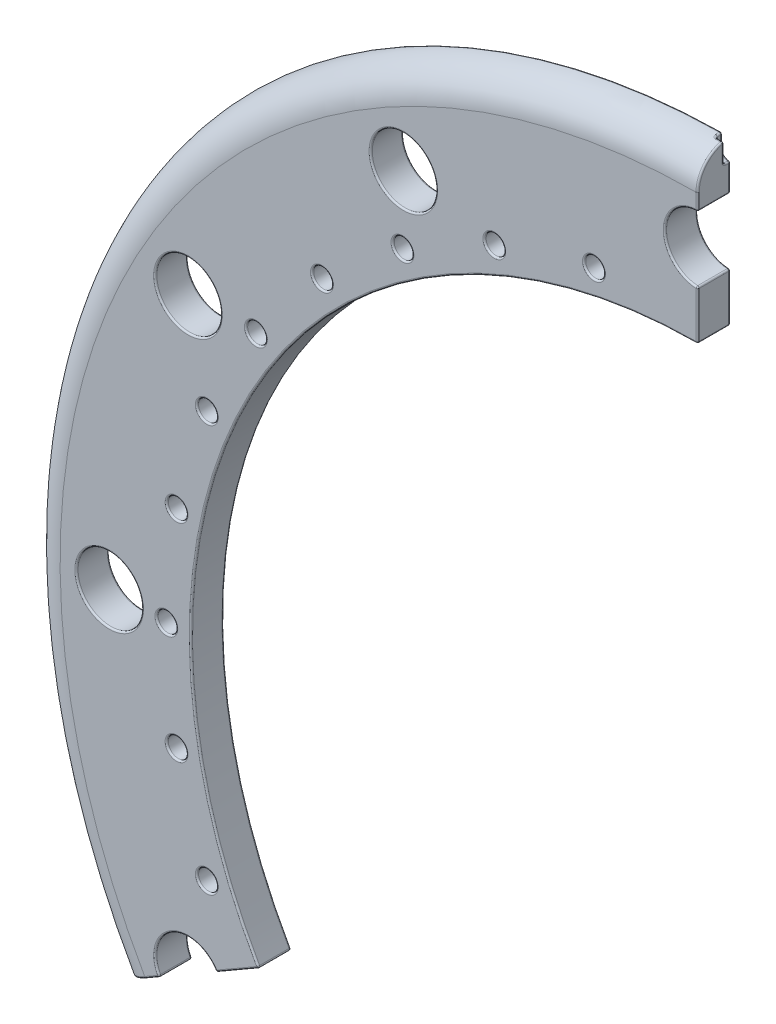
ISO-10303-21;
HEADER;
FILE_DESCRIPTION(('STEP AP214'),'2;1');
FILE_NAME('part.step','',(''),(''),'','','');
FILE_SCHEMA(('AUTOMOTIVE_DESIGN { 1 0 10303 214 1 1 1 1 }'));
ENDSEC;
DATA;
#1=APPLICATION_CONTEXT('core data for automotive mechanical design processes');
#2=APPLICATION_PROTOCOL_DEFINITION('international standard','automotive_design',2000,#1);
#3=PRODUCT_CONTEXT('',#1,'mechanical');
#4=PRODUCT('Part','Part','',(#3));
#5=PRODUCT_RELATED_PRODUCT_CATEGORY('part','',(#4));
#6=PRODUCT_DEFINITION_FORMATION('','',#4);
#7=PRODUCT_DEFINITION_CONTEXT('part definition',#1,'design');
#8=PRODUCT_DEFINITION('design','',#6,#7);
#9=PRODUCT_DEFINITION_SHAPE('','',#8);
#10=(LENGTH_UNIT() NAMED_UNIT(*) SI_UNIT(.MILLI.,.METRE.));
#11=(NAMED_UNIT(*) PLANE_ANGLE_UNIT() SI_UNIT($,.RADIAN.));
#12=(NAMED_UNIT(*) SI_UNIT($,.STERADIAN.) SOLID_ANGLE_UNIT());
#13=UNCERTAINTY_MEASURE_WITH_UNIT(LENGTH_MEASURE(1.E-05),#10,'distance_accuracy_value','');
#14=(GEOMETRIC_REPRESENTATION_CONTEXT(3) GLOBAL_UNCERTAINTY_ASSIGNED_CONTEXT((#13)) GLOBAL_UNIT_ASSIGNED_CONTEXT((#10,
#11,#12)) REPRESENTATION_CONTEXT('',''));
#15=CARTESIAN_POINT('',(0.,0.,0.));
#16=DIRECTION('',(0.,0.,1.));
#17=DIRECTION('',(1.,0.,0.));
#18=AXIS2_PLACEMENT_3D('',#15,#16,#17);
#19=CARTESIAN_POINT('',(0.,0.,-5.));
#20=DIRECTION('',(0.,0.,1.));
#21=DIRECTION('',(1.,0.,0.));
#22=AXIS2_PLACEMENT_3D('',#19,#20,#21);
#23=PLANE('',#22);
#24=CARTESIAN_POINT('',(-31.7021773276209,159.377608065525,-5.));
#25=DIRECTION('',(0.,0.,1.));
#26=DIRECTION('',(1.,0.,0.));
#27=AXIS2_PLACEMENT_3D('',#24,#25,#26);
#28=CIRCLE('',#27,3.5);
#29=CARTESIAN_POINT('',(-28.2021773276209,159.377608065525,-5.));
#30=VERTEX_POINT('',#29);
#31=EDGE_CURVE('E1692',#30,#30,#28,.T.);
#32=ORIENTED_EDGE('',*,*,#31,.T.);
#33=EDGE_LOOP('',(#32));
#34=FACE_BOUND('',#33,.T.);
#35=CARTESIAN_POINT('',(-62.1860577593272,150.130424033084,-5.));
#36=DIRECTION('',(0.,0.,1.));
#37=DIRECTION('',(1.,0.,0.));
#38=AXIS2_PLACEMENT_3D('',#35,#36,#37);
#39=CIRCLE('',#38,3.5);
#40=CARTESIAN_POINT('',(-58.6860577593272,150.130424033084,-5.));
#41=VERTEX_POINT('',#40);
#42=EDGE_CURVE('E1694',#41,#41,#39,.T.);
#43=ORIENTED_EDGE('',*,*,#42,.T.);
#44=EDGE_LOOP('',(#43));
#45=FACE_BOUND('',#44,.T.);
#46=CARTESIAN_POINT('',(-90.2801628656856,135.113811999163,-5.));
#47=DIRECTION('',(0.,0.,1.));
#48=DIRECTION('',(1.,0.,0.));
#49=AXIS2_PLACEMENT_3D('',#46,#47,#48);
#50=CIRCLE('',#49,3.5);
#51=CARTESIAN_POINT('',(-86.7801628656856,135.113811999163,-5.));
#52=VERTEX_POINT('',#51);
#53=EDGE_CURVE('E1697',#52,#52,#50,.T.);
#54=ORIENTED_EDGE('',*,*,#53,.T.);
#55=EDGE_LOOP('',(#54));
#56=FACE_BOUND('',#55,.T.);
#57=CARTESIAN_POINT('',(-114.904851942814,114.904851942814,-5.));
#58=DIRECTION('',(0.,0.,1.));
#59=DIRECTION('',(1.,0.,0.));
#60=AXIS2_PLACEMENT_3D('',#57,#58,#59);
#61=CIRCLE('',#60,3.49999999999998);
#62=CARTESIAN_POINT('',(-111.404851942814,114.904851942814,-5.));
#63=VERTEX_POINT('',#62);
#64=EDGE_CURVE('E1700',#63,#63,#61,.T.);
#65=ORIENTED_EDGE('',*,*,#64,.T.);
#66=EDGE_LOOP('',(#65));
#67=FACE_BOUND('',#66,.T.);
#68=CARTESIAN_POINT('',(-135.113811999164,90.280162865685,-5.));
#69=DIRECTION('',(0.,0.,1.));
#70=DIRECTION('',(1.,0.,0.));
#71=AXIS2_PLACEMENT_3D('',#68,#69,#70);
#72=CIRCLE('',#71,3.5);
#73=CARTESIAN_POINT('',(-131.613811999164,90.280162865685,-5.));
#74=VERTEX_POINT('',#73);
#75=EDGE_CURVE('E1703',#74,#74,#72,.T.);
#76=ORIENTED_EDGE('',*,*,#75,.T.);
#77=EDGE_LOOP('',(#76));
#78=FACE_BOUND('',#77,.T.);
#79=CARTESIAN_POINT('',(-150.130424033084,62.1860577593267,-5.));
#80=DIRECTION('',(0.,0.,1.));
#81=DIRECTION('',(1.,0.,0.));
#82=AXIS2_PLACEMENT_3D('',#79,#80,#81);
#83=CIRCLE('',#82,3.5);
#84=CARTESIAN_POINT('',(-146.630424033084,62.1860577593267,-5.));
#85=VERTEX_POINT('',#84);
#86=EDGE_CURVE('E1706',#85,#85,#83,.T.);
#87=ORIENTED_EDGE('',*,*,#86,.T.);
#88=EDGE_LOOP('',(#87));
#89=FACE_BOUND('',#88,.T.);
#90=CARTESIAN_POINT('',(-159.377608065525,31.7021773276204,-5.));
#91=DIRECTION('',(0.,0.,1.));
#92=DIRECTION('',(1.,0.,0.));
#93=AXIS2_PLACEMENT_3D('',#90,#91,#92);
#94=CIRCLE('',#93,3.5);
#95=CARTESIAN_POINT('',(-155.877608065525,31.7021773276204,-5.));
#96=VERTEX_POINT('',#95);
#97=EDGE_CURVE('E1709',#96,#96,#94,.T.);
#98=ORIENTED_EDGE('',*,*,#97,.T.);
#99=EDGE_LOOP('',(#98));
#100=FACE_BOUND('',#99,.T.);
#101=CARTESIAN_POINT('',(-162.5,-6.00214322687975E-13,-5.));
#102=DIRECTION('',(0.,0.,1.));
#103=DIRECTION('',(1.,0.,0.));
#104=AXIS2_PLACEMENT_3D('',#101,#102,#103);
#105=CIRCLE('',#104,3.5);
#106=CARTESIAN_POINT('',(-159.,-6.00214322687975E-13,-5.));
#107=VERTEX_POINT('',#106);
#108=EDGE_CURVE('E1712',#107,#107,#105,.T.);
#109=ORIENTED_EDGE('',*,*,#108,.T.);
#110=EDGE_LOOP('',(#109));
#111=FACE_BOUND('',#110,.T.);
#112=CARTESIAN_POINT('',(-159.377608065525,-31.7021773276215,-5.));
#113=DIRECTION('',(0.,0.,1.));
#114=DIRECTION('',(1.,0.,0.));
#115=AXIS2_PLACEMENT_3D('',#112,#113,#114);
#116=CIRCLE('',#115,3.5);
#117=CARTESIAN_POINT('',(-155.877608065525,-31.7021773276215,-5.));
#118=VERTEX_POINT('',#117);
#119=EDGE_CURVE('E1715',#118,#118,#116,.T.);
#120=ORIENTED_EDGE('',*,*,#119,.T.);
#121=EDGE_LOOP('',(#120));
#122=FACE_BOUND('',#121,.T.);
#123=CARTESIAN_POINT('',(-150.130424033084,-62.1860577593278,-5.));
#124=DIRECTION('',(0.,0.,1.));
#125=DIRECTION('',(1.,0.,0.));
#126=AXIS2_PLACEMENT_3D('',#123,#124,#125);
#127=CIRCLE('',#126,3.50000000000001);
#128=CARTESIAN_POINT('',(-146.630424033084,-62.1860577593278,-5.));
#129=VERTEX_POINT('',#128);
#130=EDGE_CURVE('E1718',#129,#129,#127,.T.);
#131=ORIENTED_EDGE('',*,*,#130,.T.);
#132=EDGE_LOOP('',(#131));
#133=FACE_BOUND('',#132,.T.);
#134=CARTESIAN_POINT('',(-180.,0.,-5.));
#135=DIRECTION('',(0.,0.,1.));
#136=DIRECTION('',(1.,0.,0.));
#137=AXIS2_PLACEMENT_3D('',#134,#135,#136);
#138=CIRCLE('',#137,10.5);
#139=CARTESIAN_POINT('',(-169.5,0.,-5.));
#140=VERTEX_POINT('',#139);
#141=EDGE_CURVE('E1721',#140,#140,#138,.T.);
#142=ORIENTED_EDGE('',*,*,#141,.T.);
#143=EDGE_LOOP('',(#142));
#144=FACE_BOUND('',#143,.T.);
#145=CARTESIAN_POINT('',(-155.884572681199,89.9999999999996,-5.));
#146=DIRECTION('',(0.,0.,1.));
#147=DIRECTION('',(1.,0.,0.));
#148=AXIS2_PLACEMENT_3D('',#145,#146,#147);
#149=CIRCLE('',#148,10.5);
#150=CARTESIAN_POINT('',(-145.384572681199,89.9999999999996,-5.));
#151=VERTEX_POINT('',#150);
#152=EDGE_CURVE('E1724',#151,#151,#149,.T.);
#153=ORIENTED_EDGE('',*,*,#152,.T.);
#154=EDGE_LOOP('',(#153));
#155=FACE_BOUND('',#154,.T.);
#156=CARTESIAN_POINT('',(-90.0000000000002,155.884572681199,-5.));
#157=DIRECTION('',(0.,0.,1.));
#158=DIRECTION('',(1.,0.,0.));
#159=AXIS2_PLACEMENT_3D('',#156,#157,#158);
#160=CIRCLE('',#159,10.5);
#161=CARTESIAN_POINT('',(-79.5000000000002,155.884572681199,-5.));
#162=VERTEX_POINT('',#161);
#163=EDGE_CURVE('E1727',#162,#162,#160,.T.);
#164=ORIENTED_EDGE('',*,*,#163,.T.);
#165=EDGE_LOOP('',(#164));
#166=FACE_BOUND('',#165,.T.);
#167=CARTESIAN_POINT('',(0.,0.,-5.));
#168=DIRECTION('',(0.,0.,1.));
#169=DIRECTION('',(1.,0.,0.));
#170=AXIS2_PLACEMENT_3D('',#167,#168,#169);
#171=CIRCLE('',#170,204.486832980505);
#172=CARTESIAN_POINT('',(-177.340262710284,-101.810098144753,-5.));
#173=VERTEX_POINT('',#172);
#174=CARTESIAN_POINT('',(-2.97562460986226,204.465181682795,-5.));
#175=VERTEX_POINT('',#174);
#176=EDGE_CURVE('E777',#173,#175,#171,.F.);
#177=ORIENTED_EDGE('',*,*,#176,.T.);
#178=DIRECTION('',(0.,1.,0.));
#179=VECTOR('',#178,1.);
#180=CARTESIAN_POINT('',(-2.97562460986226,201.000000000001,-5.));
#181=LINE('',#180,#179);
#182=CARTESIAN_POINT('',(-2.97562460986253,201.000000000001,-5.));
#183=VERTEX_POINT('',#182);
#184=EDGE_CURVE('E712',#175,#183,#181,.F.);
#185=ORIENTED_EDGE('',*,*,#184,.T.);
#186=CARTESIAN_POINT('',(0.,201.000000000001,-5.));
#187=DIRECTION('',(0.,0.,1.));
#188=DIRECTION('',(1.,0.,0.));
#189=AXIS2_PLACEMENT_3D('',#186,#187,#188);
#190=CIRCLE('',#189,2.97562460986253);
#191=CARTESIAN_POINT('',(-0.5,198.066684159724,-5.));
#192=VERTEX_POINT('',#191);
#193=EDGE_CURVE('E717',#183,#192,#190,.T.);
#194=ORIENTED_EDGE('',*,*,#193,.T.);
#195=DIRECTION('',(0.,1.,0.));
#196=VECTOR('',#195,1.);
#197=CARTESIAN_POINT('',(-0.5,0.,-5.));
#198=LINE('',#197,#196);
#199=CARTESIAN_POINT('',(-0.5,190.488088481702,-5.));
#200=VERTEX_POINT('',#199);
#201=EDGE_CURVE('E783',#192,#200,#198,.F.);
#202=ORIENTED_EDGE('',*,*,#201,.T.);
#203=CARTESIAN_POINT('',(0.,180.,-5.));
#204=DIRECTION('',(0.,0.,1.));
#205=DIRECTION('',(1.,0.,0.));
#206=AXIS2_PLACEMENT_3D('',#203,#204,#205);
#207=CIRCLE('',#206,10.5);
#208=CARTESIAN_POINT('',(-0.5,169.511911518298,-5.));
#209=VERTEX_POINT('',#208);
#210=EDGE_CURVE('E953',#200,#209,#207,.T.);
#211=ORIENTED_EDGE('',*,*,#210,.T.);
#212=DIRECTION('',(0.,1.,0.));
#213=VECTOR('',#212,1.);
#214=CARTESIAN_POINT('',(-0.5,0.,-5.));
#215=LINE('',#214,#213);
#216=CARTESIAN_POINT('',(-0.5,155.499196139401,-5.));
#217=VERTEX_POINT('',#216);
#218=EDGE_CURVE('E1737',#209,#217,#215,.F.);
#219=ORIENTED_EDGE('',*,*,#218,.T.);
#220=CARTESIAN_POINT('',(0.,0.,-5.));
#221=DIRECTION('',(0.,0.,1.));
#222=DIRECTION('',(1.,0.,0.));
#223=AXIS2_PLACEMENT_3D('',#220,#221,#222);
#224=CIRCLE('',#223,155.5);
#225=CARTESIAN_POINT('',(-134.91625412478,-77.3165853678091,-5.));
#226=VERTEX_POINT('',#225);
#227=EDGE_CURVE('E1730',#217,#226,#224,.T.);
#228=ORIENTED_EDGE('',*,*,#227,.T.);
#229=DIRECTION('',(0.866025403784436,0.500000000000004,0.));
#230=VECTOR('',#229,1.);
#231=CARTESIAN_POINT('',(-0.250000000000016,0.433012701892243,-5.));
#232=LINE('',#231,#230);
#233=CARTESIAN_POINT('',(-147.051621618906,-84.3229430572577,-5.));
#234=VERTEX_POINT('',#233);
#235=EDGE_CURVE('E1733',#226,#234,#232,.F.);
#236=ORIENTED_EDGE('',*,*,#235,.T.);
#237=CARTESIAN_POINT('',(-155.884572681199,-90.0000000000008,-5.));
#238=DIRECTION('',(0.,0.,1.));
#239=DIRECTION('',(1.,0.,0.));
#240=AXIS2_PLACEMENT_3D('',#237,#238,#239);
#241=CIRCLE('',#240,10.5);
#242=CARTESIAN_POINT('',(-165.217523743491,-94.8110315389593,-5.));
#243=VERTEX_POINT('',#242);
#244=EDGE_CURVE('E1735',#234,#243,#241,.T.);
#245=ORIENTED_EDGE('',*,*,#244,.T.);
#246=DIRECTION('',(0.866025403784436,0.500000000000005,0.));
#247=VECTOR('',#246,1.);
#248=CARTESIAN_POINT('',(-0.250000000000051,0.433012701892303,-5.));
#249=LINE('',#248,#247);
#250=EDGE_CURVE('E782',#243,#173,#249,.F.);
#251=ORIENTED_EDGE('',*,*,#250,.T.);
#252=EDGE_LOOP('',(#177,#185,#194,#202,#211,#219,#228,#236,#245,#251));
#253=FACE_BOUND('',#252,.T.);
#254=ADVANCED_FACE('F33',(#34,#45,#56,#67,#78,#89,#100,#111,#122,#133,#144,#155,#166,#253),#23,.F.);
#255=CARTESIAN_POINT('',(0.,205.,5.));
#256=DIRECTION('',(-1.,0.,0.));
#257=DIRECTION('',(0.,0.,1.));
#258=AXIS2_PLACEMENT_3D('',#255,#256,#257);
#259=PLANE('',#258);
#260=DIRECTION('',(0.,1.,0.));
#261=VECTOR('',#260,1.);
#262=CARTESIAN_POINT('',(0.,205.,-4.5));
#263=LINE('',#262,#261);
#264=CARTESIAN_POINT('',(0.,190.488088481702,-4.5));
#265=VERTEX_POINT('',#264);
#266=CARTESIAN_POINT('',(0.,198.066684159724,-4.5));
#267=VERTEX_POINT('',#266);
#268=EDGE_CURVE('E853',#265,#267,#263,.T.);
#269=ORIENTED_EDGE('',*,*,#268,.T.);
#270=CARTESIAN_POINT('',(-0.423377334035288,198.273379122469,-10.1859031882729));
#271=CARTESIAN_POINT('',(0.,198.207806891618,-10.1825852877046));
#272=CARTESIAN_POINT('',(0.,197.779916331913,-10.160934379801));
#273=CARTESIAN_POINT('',(-0.422267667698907,198.320946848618,-9.24241136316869));
#274=CARTESIAN_POINT('',(0.,198.254530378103,-9.2399362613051));
#275=CARTESIAN_POINT('',(0.,197.827656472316,-9.21744255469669));
#276=CARTESIAN_POINT('',(-0.421110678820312,198.368528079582,-8.29892077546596));
#277=CARTESIAN_POINT('',(0.,198.301278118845,-8.29649951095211));
#278=CARTESIAN_POINT('',(0.,197.875421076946,-8.27395196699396));
#279=CARTESIAN_POINT('',(-0.41868640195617,198.463720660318,-6.41194250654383));
#280=CARTESIAN_POINT('',(0.,198.394749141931,-6.40943984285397));
#281=CARTESIAN_POINT('',(0.,197.971007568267,-6.38697369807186));
#282=CARTESIAN_POINT('',(-0.417419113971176,198.51133201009,-5.46845482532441));
#283=CARTESIAN_POINT('',(0.,198.441463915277,-5.46599012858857));
#284=CARTESIAN_POINT('',(0.,198.018829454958,-5.44348601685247));
#285=CARTESIAN_POINT('',(-0.414758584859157,198.606587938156,-3.58148279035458));
#286=CARTESIAN_POINT('',(0.,198.534864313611,-3.57892074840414));
#287=CARTESIAN_POINT('',(0.,198.114538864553,-3.55651398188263));
#288=CARTESIAN_POINT('',(-0.413365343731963,198.654232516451,-2.63799843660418));
#289=CARTESIAN_POINT('',(0.,198.581540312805,-2.63549728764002));
#290=CARTESIAN_POINT('',(0.,198.162426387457,-2.61302962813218));
#291=CARTESIAN_POINT('',(-0.41043204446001,198.749558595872,-0.751033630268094));
#292=CARTESIAN_POINT('',(0.,198.674861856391,-0.748406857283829));
#293=CARTESIAN_POINT('',(0.,198.258278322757,-0.726064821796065));
#294=CARTESIAN_POINT('',(-0.408891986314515,198.797240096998,0.192446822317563));
#295=CARTESIAN_POINT('',(0.,198.721496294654,0.19503339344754));
#296=CARTESIAN_POINT('',(0.,198.306242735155,0.217415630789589));
#297=CARTESIAN_POINT('',(-0.407268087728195,198.844941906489,1.13592503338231));
#298=CARTESIAN_POINT('',(0.,198.76817417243,1.13983136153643));
#299=CARTESIAN_POINT('',(0.,198.354251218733,1.16089384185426));
#300=(BOUNDED_SURFACE() B_SPLINE_SURFACE(3,2,((#270,#271,#272),(#273,#274,#275),(#276,#277,
#278),(#279,#280,#281),(#282,#283,#284),(#285,#286,#287),(#288,#289,#290),(#291,#292,#293),
(#294,#295,#296),(#297,#298,#299)),.UNSPECIFIED.,.F.,.F.,.F.) B_SPLINE_SURFACE_WITH_KNOTS((4,2,
2,2,4),(3,3),(0.,2.83409659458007,5.66819317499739,8.5022897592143,11.3363863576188),(0.,1.),
.UNSPECIFIED.) GEOMETRIC_REPRESENTATION_ITEM() RATIONAL_B_SPLINE_SURFACE(((1.,0.759356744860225,
1.),(1.,0.760087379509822,1.),(1.,0.760848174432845,1.),(1.,0.762439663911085,1.),(1.,
0.763270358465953,1.),(1.,0.765011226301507,1.),(1.,0.765921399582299,1.),(1.,0.767833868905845,
1.),(1.,0.768836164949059,1.),(1.,0.769890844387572,1.))) REPRESENTATION_ITEM('') SURFACE());
#301=CARTESIAN_POINT('',(0.,197.779916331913,-10.160934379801));
#302=CARTESIAN_POINT('',(0.,197.827656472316,-9.21744255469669));
#303=CARTESIAN_POINT('',(0.,197.875421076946,-8.27395196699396));
#304=CARTESIAN_POINT('',(0.,197.971007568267,-6.38697369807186));
#305=CARTESIAN_POINT('',(0.,198.018829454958,-5.44348601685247));
#306=CARTESIAN_POINT('',(0.,198.114538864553,-3.55651398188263));
#307=CARTESIAN_POINT('',(0.,198.162426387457,-2.61302962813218));
#308=CARTESIAN_POINT('',(0.,198.258278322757,-0.726064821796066));
#309=CARTESIAN_POINT('',(0.,198.306242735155,0.217415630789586));
#310=CARTESIAN_POINT('',(0.,198.354251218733,1.16089384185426));
#311=B_SPLINE_CURVE_WITH_KNOTS('',3,(#301,#302,#303,#304,#305,#306,#307,#308,#309,#310),
.UNSPECIFIED.,.F.,.F.,(4,2,2,2,4),(0.,2.83409659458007,5.66819317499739,8.5022897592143,
11.3363863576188),.UNSPECIFIED.);
#312=CARTESIAN_POINT('',(0.,198.119952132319,-3.45006238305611));
#313=VERTEX_POINT('',#312);
#314=EDGE_CURVE('E755',#267,#313,#311,.T.);
#315=ORIENTED_EDGE('',*,*,#314,.T.);
#316=CARTESIAN_POINT('',(-0.416765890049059,198.631781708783,-3.63919135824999));
#317=CARTESIAN_POINT('',(0.,198.56428395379,-3.6590555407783));
#318=CARTESIAN_POINT('',(0.,198.158814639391,-3.77838271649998));
#319=CARTESIAN_POINT('',(-0.415878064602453,198.623782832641,-3.6126286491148));
#320=CARTESIAN_POINT('',(0.,198.554559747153,-3.62890921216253));
#321=CARTESIAN_POINT('',(0.,198.143128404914,-3.72525729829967));
#322=CARTESIAN_POINT('',(-0.415254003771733,198.618114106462,-3.58540060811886));
#323=CARTESIAN_POINT('',(0.,198.547661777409,-3.59780237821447));
#324=CARTESIAN_POINT('',(0.,198.132008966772,-3.67080121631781));
#325=CARTESIAN_POINT('',(-0.414528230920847,198.611495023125,-3.53041920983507));
#326=CARTESIAN_POINT('',(0.,198.53960789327,-3.53488389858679));
#327=CARTESIAN_POINT('',(0.,198.119023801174,-3.56083841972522));
#328=CARTESIAN_POINT('',(-0.414426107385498,198.610540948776,-3.50266628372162));
#329=CARTESIAN_POINT('',(0.,198.538440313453,-3.50304525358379));
#330=CARTESIAN_POINT('',(0.,198.117150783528,-3.50533256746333));
#331=CARTESIAN_POINT('',(-0.414738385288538,198.613403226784,-3.44726495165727));
#332=CARTESIAN_POINT('',(0.,198.541925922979,-3.43957203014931));
#333=CARTESIAN_POINT('',(0.,198.122766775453,-3.39452990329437));
#334=CARTESIAN_POINT('',(-0.415155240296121,198.617242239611,-3.41961766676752));
#335=CARTESIAN_POINT('',(0.,198.546609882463,-3.40791104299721));
#336=CARTESIAN_POINT('',(0.,198.130300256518,-3.33923533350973));
#337=CARTESIAN_POINT('',(-0.416521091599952,198.629610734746,-3.36535712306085));
#338=CARTESIAN_POINT('',(0.,198.561654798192,-3.34604830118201));
#339=CARTESIAN_POINT('',(0.,198.154559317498,-3.2307142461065));
#340=CARTESIAN_POINT('',(-0.417469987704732,198.638139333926,-3.33874367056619));
#341=CARTESIAN_POINT('',(0.,198.572028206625,-3.31581969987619));
#342=CARTESIAN_POINT('',(0.,198.171283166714,-3.1774873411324));
#343=CARTESIAN_POINT('',(-0.419923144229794,198.659637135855,-3.28731939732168));
#344=CARTESIAN_POINT('',(0.,198.598067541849,-3.25788192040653));
#345=CARTESIAN_POINT('',(0.,198.213405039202,-3.07463879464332));
#346=CARTESIAN_POINT('',(-0.421426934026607,198.672602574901,-3.26250707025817));
#347=CARTESIAN_POINT('',(0.,198.613752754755,-3.23014791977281));
#348=CARTESIAN_POINT('',(0.,198.238795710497,-3.02501414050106));
#349=CARTESIAN_POINT('',(-0.425031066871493,198.702633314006,-3.21531684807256));
#350=CARTESIAN_POINT('',(0.,198.649877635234,-3.17809052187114));
#351=CARTESIAN_POINT('',(0.,198.297537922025,-2.93063369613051));
#352=CARTESIAN_POINT('',(-0.42713222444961,198.719704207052,-3.19294233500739));
#353=CARTESIAN_POINT('',(0.,198.670357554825,-3.15375545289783));
#354=CARTESIAN_POINT('',(0.,198.330900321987,-2.88588467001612));
#355=CARTESIAN_POINT('',(-0.431995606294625,198.757561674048,-3.15117074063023));
#356=CARTESIAN_POINT('',(0.,198.715433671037,-3.10927546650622));
#357=CARTESIAN_POINT('',(0.,198.404767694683,-2.80234148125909));
#358=CARTESIAN_POINT('',(-0.43476102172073,198.778366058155,-3.13178879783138));
#359=CARTESIAN_POINT('',(0.,198.740093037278,-3.08914447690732));
#360=CARTESIAN_POINT('',(0.,198.445306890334,-2.76357759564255));
#361=CARTESIAN_POINT('',(-0.441017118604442,198.823076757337,-3.09664190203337));
#362=CARTESIAN_POINT('',(0.,198.792557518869,-3.05393303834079));
#363=CARTESIAN_POINT('',(0.,198.532237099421,-2.69328380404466));
#364=CARTESIAN_POINT('',(-0.444507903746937,198.846983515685,-3.08087746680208));
#365=CARTESIAN_POINT('',(0.,198.820415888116,-3.0388579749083));
#366=CARTESIAN_POINT('',(0.,198.578628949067,-2.66175493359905));
#367=CARTESIAN_POINT('',(-0.452360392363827,198.897676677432,-3.05314058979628));
#368=CARTESIAN_POINT('',(0.,198.878704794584,-3.01411140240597));
#369=CARTESIAN_POINT('',(0.,198.676705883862,-2.60628117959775));
#370=CARTESIAN_POINT('',(-0.456734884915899,198.924502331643,-3.04123143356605));
#371=CARTESIAN_POINT('',(0.,198.909227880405,-3.00455127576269));
#372=CARTESIAN_POINT('',(0.,198.72846251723,-2.58246286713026));
#373=CARTESIAN_POINT('',(-0.466415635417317,198.980009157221,-3.02182879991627));
#374=CARTESIAN_POINT('',(0.,198.971231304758,-2.99158587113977));
#375=CARTESIAN_POINT('',(0.,198.835111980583,-2.5436575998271));
#376=CARTESIAN_POINT('',(-0.471720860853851,199.008688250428,-3.01433046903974));
#377=CARTESIAN_POINT('',(0.,199.002777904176,-2.98821728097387));
#378=CARTESIAN_POINT('',(0.,198.890001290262,-2.52866093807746));
#379=CARTESIAN_POINT('',(-0.48352062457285,199.067975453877,-3.00373091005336));
#380=CARTESIAN_POINT('',(0.,199.066369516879,-2.98777433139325));
#381=CARTESIAN_POINT('',(0.,199.002831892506,-2.50746182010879));
#382=CARTESIAN_POINT('',(-0.490040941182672,199.098613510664,-3.00074101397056));
#383=CARTESIAN_POINT('',(0.,199.098469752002,-2.99093016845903));
#384=CARTESIAN_POINT('',(0.,199.060814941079,-2.50148202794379));
#385=CARTESIAN_POINT('',(-0.504300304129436,199.160501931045,-2.99950164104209));
#386=CARTESIAN_POINT('',(0.,199.160968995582,-3.00377802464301));
#387=CARTESIAN_POINT('',(0.,199.177011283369,-2.49900328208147));
#388=CARTESIAN_POINT('',(-0.512040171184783,199.191752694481,-3.00125536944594));
#389=CARTESIAN_POINT('',(0.,199.191427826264,-3.01358624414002));
#390=CARTESIAN_POINT('',(0.,199.235224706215,-2.50251073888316));
#391=CARTESIAN_POINT('',(-0.52912314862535,199.255283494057,-3.00951533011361));
#392=CARTESIAN_POINT('',(0.,199.250100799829,-3.03988696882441));
#393=CARTESIAN_POINT('',(0.,199.352281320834,-2.51903066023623));
#394=CARTESIAN_POINT('',(-0.538511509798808,199.287562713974,-3.01617977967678));
#395=CARTESIAN_POINT('',(0.,199.278226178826,-3.05675271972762));
#396=CARTESIAN_POINT('',(0.,199.41107958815,-2.53235955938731));
#397=CARTESIAN_POINT('',(-0.558697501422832,199.351484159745,-3.03414449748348));
#398=CARTESIAN_POINT('',(0.,199.329329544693,-3.09627085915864));
#399=CARTESIAN_POINT('',(0.,199.52573636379,-2.56828899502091));
#400=CARTESIAN_POINT('',(-0.569494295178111,199.383126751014,-3.04544202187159));
#401=CARTESIAN_POINT('',(0.,199.352295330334,-3.11913142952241));
#402=CARTESIAN_POINT('',(0.,199.581596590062,-2.59088404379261));
#403=CARTESIAN_POINT('',(-0.581000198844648,199.414164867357,-3.05891218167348));
#404=CARTESIAN_POINT('',(0.,199.371424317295,-3.14418239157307));
#405=CARTESIAN_POINT('',(0.,199.635254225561,-2.61782436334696));
#406=(BOUNDED_SURFACE() B_SPLINE_SURFACE(3,2,((#316,#317,#318),(#319,#320,#321),(#322,#323,
#324),(#325,#326,#327),(#328,#329,#330),(#331,#332,#333),(#334,#335,#336),(#337,#338,#339),
(#340,#341,#342),(#343,#344,#345),(#346,#347,#348),(#349,#350,#351),(#352,#353,#354),(#355,#356,
#357),(#358,#359,#360),(#361,#362,#363),(#364,#365,#366),(#367,#368,#369),(#370,#371,#372),
(#373,#374,#375),(#376,#377,#378),(#379,#380,#381),(#382,#383,#384),(#385,#386,#387),(#388,#389,
#390),(#391,#392,#393),(#394,#395,#396),(#397,#398,#399),(#400,#401,#402),(#403,#404,#405)),
.UNSPECIFIED.,.F.,.F.,.F.) B_SPLINE_SURFACE_WITH_KNOTS((4,2,2,2,2,2,2,2,2,2,2,2,2,2,4),(3,3),
(0.,0.165959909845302,0.331788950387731,0.498404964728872,0.664989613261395,0.831433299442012,
0.998105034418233,1.16559408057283,1.33310708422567,1.50324478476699,1.67319492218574,
1.84727680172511,2.02147633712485,2.20154826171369,2.3815136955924),(0.,1.),
.UNSPECIFIED.) GEOMETRIC_REPRESENTATION_ITEM() RATIONAL_B_SPLINE_SURFACE(((1.,0.763697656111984,
1.),(1.,0.764278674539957,1.),(1.,0.764686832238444,1.),(1.,0.765161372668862,1.),(1.,
0.765228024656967,1.),(1.,0.765023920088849,1.),(1.,0.764751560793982,1.),(1.,0.763858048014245,
1.),(1.,0.763236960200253,1.),(1.,0.761628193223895,1.),(1.,0.760640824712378,1.),(1.,
0.758267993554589,1.),(1.,0.756881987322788,1.),(1.,0.753662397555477,1.),(1.,0.751826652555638,
1.),(1.,0.747654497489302,1.),(1.,0.745318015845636,1.),(1.,0.740031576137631,1.),(1.,
0.73707257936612,1.),(1.,0.730476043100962,1.),(1.,0.726839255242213,1.),(1.,0.718676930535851,
1.),(1.,0.714131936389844,1.),(1.,0.704077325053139,1.),(1.,0.698567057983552,1.),(1.,
0.686233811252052,1.),(1.,0.679372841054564,1.),(1.,0.664346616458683,1.),(1.,0.656182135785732,
1.),(1.,0.647301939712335,1.))) REPRESENTATION_ITEM('') SURFACE());
#407=CARTESIAN_POINT('',(0.,199.635254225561,-2.61782436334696));
#408=CARTESIAN_POINT('',(0.,199.581596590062,-2.59088404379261));
#409=CARTESIAN_POINT('',(0.,199.52573636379,-2.56828899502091));
#410=CARTESIAN_POINT('',(0.,199.41107958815,-2.53235955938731));
#411=CARTESIAN_POINT('',(0.,199.352281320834,-2.51903066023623));
#412=CARTESIAN_POINT('',(0.,199.235224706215,-2.50251073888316));
#413=CARTESIAN_POINT('',(0.,199.177011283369,-2.49900328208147));
#414=CARTESIAN_POINT('',(0.,199.060814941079,-2.50148202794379));
#415=CARTESIAN_POINT('',(0.,199.002831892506,-2.50746182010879));
#416=CARTESIAN_POINT('',(0.,198.890001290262,-2.52866093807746));
#417=CARTESIAN_POINT('',(0.,198.835111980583,-2.5436575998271));
#418=CARTESIAN_POINT('',(0.,198.72846251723,-2.58246286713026));
#419=CARTESIAN_POINT('',(0.,198.676705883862,-2.60628117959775));
#420=CARTESIAN_POINT('',(0.,198.578628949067,-2.66175493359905));
#421=CARTESIAN_POINT('',(0.,198.532237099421,-2.69328380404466));
#422=CARTESIAN_POINT('',(0.,198.445306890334,-2.76357759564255));
#423=CARTESIAN_POINT('',(0.,198.404767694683,-2.80234148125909));
#424=CARTESIAN_POINT('',(0.,198.330900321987,-2.88588467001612));
#425=CARTESIAN_POINT('',(0.,198.297537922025,-2.93063369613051));
#426=CARTESIAN_POINT('',(0.,198.238795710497,-3.02501414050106));
#427=CARTESIAN_POINT('',(0.,198.213405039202,-3.07463879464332));
#428=CARTESIAN_POINT('',(0.,198.171283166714,-3.1774873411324));
#429=CARTESIAN_POINT('',(0.,198.154559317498,-3.2307142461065));
#430=CARTESIAN_POINT('',(0.,198.130300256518,-3.33923533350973));
#431=CARTESIAN_POINT('',(0.,198.122766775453,-3.39452990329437));
#432=CARTESIAN_POINT('',(0.,198.117150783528,-3.50533256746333));
#433=CARTESIAN_POINT('',(0.,198.119023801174,-3.56083841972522));
#434=CARTESIAN_POINT('',(0.,198.132008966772,-3.67080121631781));
#435=CARTESIAN_POINT('',(0.,198.143128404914,-3.72525729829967));
#436=CARTESIAN_POINT('',(0.,198.158814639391,-3.77838271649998));
#437=B_SPLINE_CURVE_WITH_KNOTS('',3,(#407,#408,#409,#410,#411,#412,#413,#414,#415,#416,#417,
#418,#419,#420,#421,#422,#423,#424,#425,#426,#427,#428,#429,#430,#431,#432,#433,#434,#435,#436),
.UNSPECIFIED.,.F.,.F.,(4,2,2,2,2,2,2,2,2,2,2,2,2,2,4),(0.,0.179965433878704,0.360037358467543,
0.534236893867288,0.708318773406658,0.87826891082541,1.04840661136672,1.21591961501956,
1.38340866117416,1.55008039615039,1.716524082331,1.88310873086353,2.04972474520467,
2.2155537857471,2.3815136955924),.UNSPECIFIED.);
#438=CARTESIAN_POINT('',(0.,199.141715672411,-2.5));
#439=VERTEX_POINT('',#438);
#440=EDGE_CURVE('E749',#439,#313,#437,.T.);
#441=ORIENTED_EDGE('',*,*,#440,.F.);
#442=DIRECTION('',(0.,-1.,0.));
#443=VECTOR('',#442,1.);
#444=CARTESIAN_POINT('',(0.,204.286475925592,-2.5));
#445=LINE('',#444,#443);
#446=CARTESIAN_POINT('',(0.,204.164539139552,-2.49999999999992));
#447=VERTEX_POINT('',#446);
#448=EDGE_CURVE('E747',#439,#447,#445,.F.);
#449=ORIENTED_EDGE('',*,*,#448,.T.);
#450=CARTESIAN_POINT('',(0.,191.854787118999,3.96447064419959));
#451=CARTESIAN_POINT('',(0.,191.689427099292,4.43587823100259));
#452=CARTESIAN_POINT('',(-0.499568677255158,191.689284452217,4.43628488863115));
#453=CARTESIAN_POINT('',(0.,192.106910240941,4.05293733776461));
#454=CARTESIAN_POINT('',(0.,191.954806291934,4.52903354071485));
#455=CARTESIAN_POINT('',(-0.499603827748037,191.954677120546,4.52940772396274));
#456=CARTESIAN_POINT('',(0.,192.362770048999,4.13071481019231));
#457=CARTESIAN_POINT('',(0.,192.224111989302,4.61093466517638));
#458=CARTESIAN_POINT('',(-0.49963935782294,192.224003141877,4.61127874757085));
#459=CARTESIAN_POINT('',(0.,192.880116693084,4.26445358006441));
#460=CARTESIAN_POINT('',(0.,192.768651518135,4.75177687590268));
#461=CARTESIAN_POINT('',(-0.499710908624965,192.768578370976,4.75205640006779));
#462=CARTESIAN_POINT('',(0.,193.141603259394,4.32041592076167));
#463=CARTESIAN_POINT('',(0.,193.043885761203,4.81071748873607));
#464=CARTESIAN_POINT('',(-0.49974692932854,193.04382729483,4.81096412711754));
#465=CARTESIAN_POINT('',(0.,193.668203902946,4.4100649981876));
#466=CARTESIAN_POINT('',(0.,193.598177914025,4.90515406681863));
#467=CARTESIAN_POINT('',(-0.499819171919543,193.598143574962,4.90533157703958));
#468=CARTESIAN_POINT('',(0.,193.933315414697,4.44376673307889));
#469=CARTESIAN_POINT('',(0.,193.877233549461,4.94066415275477));
#470=CARTESIAN_POINT('',(-0.4998553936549,193.877208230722,4.94080708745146));
#471=CARTESIAN_POINT('',(0.,194.465358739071,4.48874173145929));
#472=CARTESIAN_POINT('',(0.,194.437266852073,4.98807783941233));
#473=CARTESIAN_POINT('',(-0.499927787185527,194.437253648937,4.98814919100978));
#474=CARTESIAN_POINT('',(0.,194.732290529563,4.50001526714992));
#475=CARTESIAN_POINT('',(0.,194.718244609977,4.9999800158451));
#476=CARTESIAN_POINT('',(-0.499963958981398,194.718234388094,5.00001607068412));
#477=CARTESIAN_POINT('',(0.,195.533271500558,4.49996947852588));
#478=CARTESIAN_POINT('',(0.,195.561412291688,5.00003995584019));
#479=CARTESIAN_POINT('',(-0.500072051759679,195.56137197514,4.9999678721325));
#480=CARTESIAN_POINT('',(0.,196.067730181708,4.45482167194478));
#481=CARTESIAN_POINT('',(0.,196.124010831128,4.9525808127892));
#482=CARTESIAN_POINT('',(-0.500143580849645,196.123959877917,4.95244386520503));
#483=CARTESIAN_POINT('',(0.,197.121068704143,4.27545995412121));
#484=CARTESIAN_POINT('',(0.,197.232835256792,4.76391304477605));
#485=CARTESIAN_POINT('',(-0.500283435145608,197.232736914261,4.76364205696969));
#486=CARTESIAN_POINT('',(0.,197.639951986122,4.1412658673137));
#487=CARTESIAN_POINT('',(0.,197.779058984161,4.62271276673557));
#488=CARTESIAN_POINT('',(-0.500351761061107,197.778929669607,4.6223851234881));
#489=CARTESIAN_POINT('',(0.,198.647908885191,3.78767546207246));
#490=CARTESIAN_POINT('',(0.,198.840153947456,4.25062136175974));
#491=CARTESIAN_POINT('',(-0.500483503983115,198.839936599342,4.25018469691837));
#492=CARTESIAN_POINT('',(0.,199.136982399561,3.56827885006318));
#493=CARTESIAN_POINT('',(0.,199.355015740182,4.01971992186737));
#494=CARTESIAN_POINT('',(-0.50054692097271,199.354750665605,4.01924089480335));
#495=CARTESIAN_POINT('',(0.,200.071439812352,3.05044228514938));
#496=CARTESIAN_POINT('',(0.,200.338773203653,3.47470122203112));
#497=CARTESIAN_POINT('',(-0.500667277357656,200.338389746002,3.47414977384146));
#498=CARTESIAN_POINT('',(0.,200.516814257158,2.7519852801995));
#499=CARTESIAN_POINT('',(0.,200.807646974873,3.1605595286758));
#500=CARTESIAN_POINT('',(-0.5007242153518,200.807204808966,3.15998450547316));
#501=CARTESIAN_POINT('',(0.,201.351132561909,2.08453401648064));
#502=CARTESIAN_POINT('',(0.,201.686011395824,2.4580076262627));
#503=CARTESIAN_POINT('',(-0.500830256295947,201.68543433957,2.45740422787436));
#504=CARTESIAN_POINT('',(0.,201.740076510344,1.7155398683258));
#505=CARTESIAN_POINT('',(0.,202.095488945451,2.06959515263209));
#506=CARTESIAN_POINT('',(-0.500879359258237,202.094848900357,2.06898933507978));
#507=CARTESIAN_POINT('',(0.,202.450410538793,0.917550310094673));
#508=CARTESIAN_POINT('',(0.,202.843344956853,1.22958794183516));
#509=CARTESIAN_POINT('',(-0.500968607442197,202.842568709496,1.22900032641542));
#510=CARTESIAN_POINT('',(0.,202.771815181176,0.488567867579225));
#511=CARTESIAN_POINT('',(0.,203.181725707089,0.778008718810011));
#512=CARTESIAN_POINT('',(-0.501008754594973,203.180889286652,0.77743986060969));
#513=CARTESIAN_POINT('',(0.,203.338042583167,-0.417182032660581));
#514=CARTESIAN_POINT('',(0.,203.777876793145,-0.175474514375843));
#515=CARTESIAN_POINT('',(-0.501079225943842,203.776917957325,-0.17598108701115));
#516=CARTESIAN_POINT('',(0.,203.58286582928,-0.893949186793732));
#517=CARTESIAN_POINT('',(0.,204.035636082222,-0.677372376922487));
#518=CARTESIAN_POINT('',(-0.501109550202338,204.034626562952,-0.677841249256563));
#519=CARTESIAN_POINT('',(0.,203.989075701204,-1.88221834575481));
#520=CARTESIAN_POINT('',(0.,204.463320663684,-1.7177548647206));
#521=CARTESIAN_POINT('',(-0.501159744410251,204.462215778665,-1.71812457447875));
#522=CARTESIAN_POINT('',(0.,204.150443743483,-2.39372805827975));
#523=CARTESIAN_POINT('',(0.,204.633217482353,-2.25623852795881));
#524=CARTESIAN_POINT('',(-0.501179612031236,204.632076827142,-2.25655585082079));
#525=CARTESIAN_POINT('',(0.,204.326315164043,-3.1751579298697));
#526=CARTESIAN_POINT('',(0.,204.818387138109,-3.07888412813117));
#527=CARTESIAN_POINT('',(-0.501201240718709,204.817204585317,-3.07911361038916));
#528=CARTESIAN_POINT('',(0.,204.373911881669,-3.43805171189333));
#529=CARTESIAN_POINT('',(0.,204.868500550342,-3.35564609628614));
#530=CARTESIAN_POINT('',(-0.501207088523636,204.867306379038,-3.35584390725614));
#531=CARTESIAN_POINT('',(0.,204.44682498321,-3.96698667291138));
#532=CARTESIAN_POINT('',(0.,204.945269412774,-3.91248611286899));
#533=CARTESIAN_POINT('',(-0.501216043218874,204.944056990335,-3.91261755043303));
#534=CARTESIAN_POINT('',(0.,204.472141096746,-4.23302789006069));
#535=CARTESIAN_POINT('',(0.,204.971924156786,-4.1925627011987));
#536=CARTESIAN_POINT('',(-0.501219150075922,204.970705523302,-4.192660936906));
#537=CARTESIAN_POINT('',(0.,204.500275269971,-4.76645955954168));
#538=CARTESIAN_POINT('',(0.,205.001546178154,-4.75413827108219));
#539=CARTESIAN_POINT('',(-0.501222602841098,205.000320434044,-4.7541679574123));
#540=CARTESIAN_POINT('',(0.,204.503078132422,-5.03385080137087));
#541=CARTESIAN_POINT('',(0.,205.004497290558,-5.0356365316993));
#542=CARTESIAN_POINT('',(-0.501222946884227,205.003270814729,-5.03563242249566));
#543=CARTESIAN_POINT('',(0.,204.486166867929,-5.56793255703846));
#544=CARTESIAN_POINT('',(0.,204.986691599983,-5.59789664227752));
#545=CARTESIAN_POINT('',(-0.501220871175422,204.985469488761,-5.597823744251));
#546=CARTESIAN_POINT('',(0.,204.46645166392,-5.83462303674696));
#547=CARTESIAN_POINT('',(0.,204.965933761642,-5.87865690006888));
#548=CARTESIAN_POINT('',(-0.501218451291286,204.964716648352,-5.8785505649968));
#549=CARTESIAN_POINT('',(0.,204.435487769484,-6.1000144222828));
#550=CARTESIAN_POINT('',(0.,204.933332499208,-6.1580509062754));
#551=CARTESIAN_POINT('',(-0.501214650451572,204.932123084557,-6.15790991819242));
#552=(BOUNDED_SURFACE() B_SPLINE_SURFACE(3,2,((#450,#451,#452),(#453,#454,#455),(#456,#457,
#458),(#459,#460,#461),(#462,#463,#464),(#465,#466,#467),(#468,#469,#470),(#471,#472,#473),
(#474,#475,#476),(#477,#478,#479),(#480,#481,#482),(#483,#484,#485),(#486,#487,#488),(#489,#490,
#491),(#492,#493,#494),(#495,#496,#497),(#498,#499,#500),(#501,#502,#503),(#504,#505,#506),
(#507,#508,#509),(#510,#511,#512),(#513,#514,#515),(#516,#517,#518),(#519,#520,#521),(#522,#523,
#524),(#525,#526,#527),(#528,#529,#530),(#531,#532,#533),(#534,#535,#536),(#537,#538,#539),
(#540,#541,#542),(#543,#544,#545),(#546,#547,#548),(#549,#550,#551)),.UNSPECIFIED.,.F.,.F.,
.F.) B_SPLINE_SURFACE_WITH_KNOTS((4,2,2,2,2,2,2,2,2,2,2,2,2,2,2,2,4),(3,3),(0.,
0.801320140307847,1.60260195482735,2.40334335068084,3.20407502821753,4.8048657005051,
6.40530010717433,8.0057400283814,9.60652541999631,11.2073083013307,12.8077456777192,
14.4081728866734,16.0089563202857,16.8096819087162,17.6104172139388,18.4116929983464,
19.2130071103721),(0.,1.),
.UNSPECIFIED.) GEOMETRIC_REPRESENTATION_ITEM() RATIONAL_B_SPLINE_SURFACE(((1.,0.707411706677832,
1.),(1.,0.70738686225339,1.),(1.,0.70736174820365,1.),(1.,0.707311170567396,1.),(1.,
0.707285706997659,1.),(1.,0.707234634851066,1.),(1.,0.707209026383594,1.),(1.,0.707157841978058,
1.),(1.,0.707132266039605,1.),(1.,0.70705583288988,1.),(1.,0.707005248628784,1.),(1.,
0.706906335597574,1.),(1.,0.706858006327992,1.),(1.,0.706764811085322,1.),(1.,0.706719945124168,
1.),(1.,0.70663478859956,1.),(1.,0.706594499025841,1.),(1.,0.7065194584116,1.),(1.,
0.706484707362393,1.),(1.,0.706421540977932,1.),(1.,0.706393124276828,1.),(1.,0.706343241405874,
1.),(1.,0.706321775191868,1.),(1.,0.706286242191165,1.),(1.,0.706272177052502,1.),(1.,
0.706256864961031,1.),(1.,0.7062527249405,1.),(1.,0.706246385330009,1.),(1.,0.706244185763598,
1.),(1.,0.706241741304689,1.),(1.,0.706241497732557,1.),(1.,0.706242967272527,1.),(1.,
0.706244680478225,1.),(1.,0.706247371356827,1.))) REPRESENTATION_ITEM('') SURFACE());
#553=CARTESIAN_POINT('',(0.,204.435487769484,-6.1000144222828));
#554=CARTESIAN_POINT('',(0.,204.46645166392,-5.83462303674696));
#555=CARTESIAN_POINT('',(0.,204.486166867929,-5.56793255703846));
#556=CARTESIAN_POINT('',(0.,204.503078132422,-5.03385080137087));
#557=CARTESIAN_POINT('',(0.,204.500275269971,-4.76645955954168));
#558=CARTESIAN_POINT('',(0.,204.472141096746,-4.23302789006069));
#559=CARTESIAN_POINT('',(0.,204.44682498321,-3.96698667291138));
#560=CARTESIAN_POINT('',(0.,204.373911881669,-3.43805171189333));
#561=CARTESIAN_POINT('',(0.,204.326315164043,-3.1751579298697));
#562=CARTESIAN_POINT('',(0.,204.150443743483,-2.39372805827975));
#563=CARTESIAN_POINT('',(0.,203.989075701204,-1.88221834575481));
#564=CARTESIAN_POINT('',(0.,203.58286582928,-0.893949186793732));
#565=CARTESIAN_POINT('',(0.,203.338042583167,-0.417182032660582));
#566=CARTESIAN_POINT('',(0.,202.771815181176,0.488567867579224));
#567=CARTESIAN_POINT('',(0.,202.450410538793,0.917550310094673));
#568=CARTESIAN_POINT('',(0.,201.740076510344,1.7155398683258));
#569=CARTESIAN_POINT('',(0.,201.351132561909,2.08453401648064));
#570=CARTESIAN_POINT('',(0.,200.516814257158,2.7519852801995));
#571=CARTESIAN_POINT('',(0.,200.071439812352,3.05044228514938));
#572=CARTESIAN_POINT('',(0.,199.136982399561,3.56827885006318));
#573=CARTESIAN_POINT('',(0.,198.647908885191,3.78767546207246));
#574=CARTESIAN_POINT('',(0.,197.639951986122,4.1412658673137));
#575=CARTESIAN_POINT('',(0.,197.121068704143,4.27545995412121));
#576=CARTESIAN_POINT('',(0.,196.067730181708,4.45482167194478));
#577=CARTESIAN_POINT('',(0.,195.533271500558,4.49996947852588));
#578=CARTESIAN_POINT('',(0.,194.732290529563,4.50001526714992));
#579=CARTESIAN_POINT('',(0.,194.465358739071,4.48874173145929));
#580=CARTESIAN_POINT('',(0.,193.933315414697,4.44376673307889));
#581=CARTESIAN_POINT('',(0.,193.668203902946,4.4100649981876));
#582=CARTESIAN_POINT('',(0.,193.141603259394,4.32041592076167));
#583=CARTESIAN_POINT('',(0.,192.880116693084,4.26445358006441));
#584=CARTESIAN_POINT('',(0.,192.362770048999,4.13071481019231));
#585=CARTESIAN_POINT('',(0.,192.106910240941,4.05293733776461));
#586=CARTESIAN_POINT('',(0.,191.854787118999,3.96447064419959));
#587=B_SPLINE_CURVE_WITH_KNOTS('',3,(#553,#554,#555,#556,#557,#558,#559,#560,#561,#562,#563,
#564,#565,#566,#567,#568,#569,#570,#571,#572,#573,#574,#575,#576,#577,#578,#579,#580,#581,#582,
#583,#584,#585,#586),.UNSPECIFIED.,.F.,.F.,(4,2,2,2,2,2,2,2,2,2,2,2,2,2,2,2,4),(0.,
0.801314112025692,1.60258989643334,2.40332520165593,3.20405079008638,4.80483422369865,
6.40526143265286,8.00569880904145,9.60648169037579,11.2072670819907,12.8077070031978,
14.408141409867,16.0089320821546,16.8096637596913,17.6104051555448,18.4116869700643,
19.2130071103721),.UNSPECIFIED.);
#588=CARTESIAN_POINT('',(0.,194.999358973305,4.5));
#589=VERTEX_POINT('',#588);
#590=EDGE_CURVE('E847',#447,#589,#587,.T.);
#591=ORIENTED_EDGE('',*,*,#590,.T.);
#592=DIRECTION('',(0.,1.,0.));
#593=VECTOR('',#592,1.);
#594=CARTESIAN_POINT('',(0.,190.,4.5));
#595=LINE('',#594,#593);
#596=CARTESIAN_POINT('',(0.,190.488088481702,4.5));
#597=VERTEX_POINT('',#596);
#598=EDGE_CURVE('E278',#589,#597,#595,.F.);
#599=ORIENTED_EDGE('',*,*,#598,.T.);
#600=DIRECTION('',(0.,0.,-1.));
#601=VECTOR('',#600,1.);
#602=CARTESIAN_POINT('',(0.,190.488088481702,5.));
#603=LINE('',#602,#601);
#604=EDGE_CURVE('E988',#597,#265,#603,.T.);
#605=ORIENTED_EDGE('',*,*,#604,.T.);
#606=EDGE_LOOP('',(#269,#315,#441,#449,#591,#599,#605));
#607=FACE_BOUND('',#606,.T.);
#608=ADVANCED_FACE('F546',(#607),#259,.F.);
#609=CARTESIAN_POINT('',(0.,0.,-5.));
#610=DIRECTION('',(0.,0.,1.));
#611=DIRECTION('',(1.,0.,0.));
#612=AXIS2_PLACEMENT_3D('',#609,#610,#611);
#613=TOROIDAL_SURFACE('',#612,195.,10.);
#614=CARTESIAN_POINT('',(-1.76428238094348,204.173047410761,-3.02632265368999));
#615=CARTESIAN_POINT('',(-1.82029410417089,204.810077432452,-3.00739186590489));
#616=CARTESIAN_POINT('',(-1.60798516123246,204.656156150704,-2.42383716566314));
#617=CARTESIAN_POINT('',(-1.78994694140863,204.167990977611,-3.01762076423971));
#618=CARTESIAN_POINT('',(-1.83996787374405,204.810229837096,-3.00426324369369));
#619=CARTESIAN_POINT('',(-1.6594339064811,204.650853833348,-2.40551739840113));
#620=CARTESIAN_POINT('',(-1.81637983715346,204.164005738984,-3.01103908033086));
#621=CARTESIAN_POINT('',(-1.85866236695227,204.810422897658,-3.00224498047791));
#622=CARTESIAN_POINT('',(-1.7124232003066,204.646680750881,-2.39166122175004));
#623=CARTESIAN_POINT('',(-1.86999827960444,204.158309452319,-3.00223140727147));
#624=CARTESIAN_POINT('',(-1.89515861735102,204.810698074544,-2.99993638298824));
#625=CARTESIAN_POINT('',(-1.81991147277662,204.640731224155,-2.37311875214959));
#626=CARTESIAN_POINT('',(-1.89718317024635,204.156596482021,-3.00000173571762));
#627=CARTESIAN_POINT('',(-1.9128830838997,204.810779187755,-2.99965767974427));
#628=CARTESIAN_POINT('',(-1.87440913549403,204.638952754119,-2.36842470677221));
#629=CARTESIAN_POINT('',(-1.95181371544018,204.155562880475,-2.99999824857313));
#630=CARTESIAN_POINT('',(-1.94838064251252,204.810633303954,-3.00034565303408));
#631=CARTESIAN_POINT('',(-1.98392837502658,204.637916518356,-2.36841736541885));
#632=CARTESIAN_POINT('',(-1.97925950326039,204.156264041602,-3.00226494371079));
#633=CARTESIAN_POINT('',(-1.96607351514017,204.810403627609,-3.0013229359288));
#634=CARTESIAN_POINT('',(-2.03895022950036,204.63868171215,-2.37318935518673));
#635=CARTESIAN_POINT('',(-2.03336035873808,204.160032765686,-3.01125296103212));
#636=CARTESIAN_POINT('',(-2.00229641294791,204.809742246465,-3.00484896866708));
#637=CARTESIAN_POINT('',(-2.14741019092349,204.642704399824,-2.39211149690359));
#638=CARTESIAN_POINT('',(-2.06001561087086,204.163099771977,-3.01797323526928));
#639=CARTESIAN_POINT('',(-2.02074677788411,204.809312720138,-3.00738418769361));
#640=CARTESIAN_POINT('',(-2.20084866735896,204.645961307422,-2.40625944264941));
#641=CARTESIAN_POINT('',(-2.11175611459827,204.171374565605,-3.0356349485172));
#642=CARTESIAN_POINT('',(-2.05896740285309,204.808567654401,-3.01482418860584));
#643=CARTESIAN_POINT('',(-2.30457974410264,204.654728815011,-2.44344199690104));
#644=CARTESIAN_POINT('',(-2.13684348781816,204.17657938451,-3.04657053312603));
#645=CARTESIAN_POINT('',(-2.07865700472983,204.808252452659,-3.01969460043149));
#646=CARTESIAN_POINT('',(-2.35487659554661,204.660236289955,-2.46646428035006));
#647=CARTESIAN_POINT('',(-2.18485270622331,204.188795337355,-3.07233773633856));
#648=CARTESIAN_POINT('',(-2.11924898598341,204.80813068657,-3.03281244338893));
#649=CARTESIAN_POINT('',(-2.45113051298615,204.673151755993,-2.52071102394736));
#650=CARTESIAN_POINT('',(-2.20777135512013,204.19580908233,-3.0871749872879));
#651=CARTESIAN_POINT('',(-2.14008613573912,204.808319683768,-3.04101179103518));
#652=CARTESIAN_POINT('',(-2.49708117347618,204.680562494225,-2.55194734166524));
#653=CARTESIAN_POINT('',(-2.25116812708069,204.211340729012,-3.12056878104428));
#654=CARTESIAN_POINT('',(-2.18247925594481,204.809544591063,-3.06177352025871));
#655=CARTESIAN_POINT('',(-2.58409129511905,204.69696559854,-2.62225006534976));
#656=CARTESIAN_POINT('',(-2.27160142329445,204.219880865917,-3.1391809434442));
#657=CARTESIAN_POINT('',(-2.20400347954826,204.810582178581,-3.07433295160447));
#658=CARTESIAN_POINT('',(-2.62506091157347,204.705981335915,-2.66143356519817));
#659=CARTESIAN_POINT('',(-2.30908758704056,204.2379068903,-3.17944806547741));
#660=CARTESIAN_POINT('',(-2.24617580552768,204.813696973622,-3.10420720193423));
#661=CARTESIAN_POINT('',(-2.7002242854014,204.72500493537,-2.74620645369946));
#662=CARTESIAN_POINT('',(-2.32613980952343,204.247392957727,-3.20110360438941));
#663=CARTESIAN_POINT('',(-2.26682020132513,204.815759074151,-3.12144718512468));
#664=CARTESIAN_POINT('',(-2.73441674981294,204.73501298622,-2.79179706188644));
#665=CARTESIAN_POINT('',(-2.35688753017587,204.26711393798,-3.24754963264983));
#666=CARTESIAN_POINT('',(-2.30636587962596,204.820986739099,-3.16113980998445));
#667=CARTESIAN_POINT('',(-2.79607309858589,204.755813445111,-2.88957817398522));
#668=CARTESIAN_POINT('',(-2.37047065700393,204.277362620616,-3.27241311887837));
#669=CARTESIAN_POINT('',(-2.32524384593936,204.82416915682,-3.18367310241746));
#670=CARTESIAN_POINT('',(-2.82331172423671,204.766620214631,-2.94192235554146));
#671=CARTESIAN_POINT('',(-2.39323841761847,204.297848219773,-3.32403846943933));
#672=CARTESIAN_POINT('',(-2.35908615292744,204.831443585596,-3.23298683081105));
#673=CARTESIAN_POINT('',(-2.86897116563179,204.788215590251,-3.0506073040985));
#674=CARTESIAN_POINT('',(-2.40242870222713,204.308085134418,-3.35079784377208));
#675=CARTESIAN_POINT('',(-2.37412233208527,204.835525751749,-3.25972824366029));
#676=CARTESIAN_POINT('',(-2.88740330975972,204.7990042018,-3.10694282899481));
#677=CARTESIAN_POINT('',(-2.41626594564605,204.328261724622,-3.40587312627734));
#678=CARTESIAN_POINT('',(-2.39931195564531,204.844382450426,-3.31678746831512));
#679=CARTESIAN_POINT('',(-2.91515899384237,204.820262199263,-3.22289079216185));
#680=CARTESIAN_POINT('',(-2.42085311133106,204.338195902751,-3.43420459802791));
#681=CARTESIAN_POINT('',(-2.40948278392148,204.849165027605,-3.34715639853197));
#682=CARTESIAN_POINT('',(-2.9243626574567,204.830725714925,-3.2825359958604));
#683=CARTESIAN_POINT('',(-2.42511925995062,204.357268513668,-3.49130313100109));
#684=CARTESIAN_POINT('',(-2.42385183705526,204.859062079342,-3.40982471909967));
#685=CARTESIAN_POINT('',(-2.93292931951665,204.850808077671,-3.40274343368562));
#686=CARTESIAN_POINT('',(-2.42479821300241,204.366406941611,-3.52007019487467));
#687=CARTESIAN_POINT('',(-2.42812347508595,204.864182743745,-3.44216501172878));
#688=CARTESIAN_POINT('',(-2.93229225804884,204.860426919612,-3.46330567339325));
#689=CARTESIAN_POINT('',(-2.41923295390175,204.383554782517,-3.57697122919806));
#690=CARTESIAN_POINT('',(-2.43029173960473,204.874405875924,-3.50700625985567));
#691=CARTESIAN_POINT('',(-2.92114699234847,204.878469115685,-3.58309732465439));
#692=CARTESIAN_POINT('',(-2.41402848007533,204.391572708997,-3.60510843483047));
#693=CARTESIAN_POINT('',(-2.42829087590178,204.87951815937,-3.53956512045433));
#694=CARTESIAN_POINT('',(-2.91071846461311,204.886901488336,-3.64233354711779));
#695=CARTESIAN_POINT('',(-2.39888675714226,204.406454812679,-3.66019689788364));
#696=CARTESIAN_POINT('',(-2.41818210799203,204.88953405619,-3.60370653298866));
#697=CARTESIAN_POINT('',(-2.88037183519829,204.902545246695,-3.7583092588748));
#698=CARTESIAN_POINT('',(-2.38894336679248,204.413317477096,-3.6871465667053));
#699=CARTESIAN_POINT('',(-2.41009140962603,204.894448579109,-3.63535734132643));
#700=CARTESIAN_POINT('',(-2.86044141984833,204.909755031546,-3.81504540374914));
#701=CARTESIAN_POINT('',(-2.3767042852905,204.419536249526,-3.71306940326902));
#702=CARTESIAN_POINT('',(-2.39894656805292,204.899146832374,-3.66585085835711));
#703=CARTESIAN_POINT('',(-2.83590784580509,204.916284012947,-3.86961979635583));
#704=(BOUNDED_SURFACE() B_SPLINE_SURFACE(3,2,((#614,#615,#616),(#617,#618,#619),(#620,#621,
#622),(#623,#624,#625),(#626,#627,#628),(#629,#630,#631),(#632,#633,#634),(#635,#636,#637),
(#638,#639,#640),(#641,#642,#643),(#644,#645,#646),(#647,#648,#649),(#650,#651,#652),(#653,#654,
#655),(#656,#657,#658),(#659,#660,#661),(#662,#663,#664),(#665,#666,#667),(#668,#669,#670),
(#671,#672,#673),(#674,#675,#676),(#677,#678,#679),(#680,#681,#682),(#683,#684,#685),(#686,#687,
#688),(#689,#690,#691),(#692,#693,#694),(#695,#696,#697),(#698,#699,#700),(#701,#702,#703)),
.UNSPECIFIED.,.F.,.F.,.F.) B_SPLINE_SURFACE_WITH_KNOTS((4,2,2,2,2,2,2,2,2,2,2,2,2,2,4),(3,3),
(0.,0.163108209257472,0.326078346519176,0.490523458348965,0.654929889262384,0.819108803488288,
0.983526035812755,1.15056934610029,1.31764449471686,1.48959115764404,1.66131603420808,
1.83524376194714,2.00917254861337,2.18169817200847,2.35444798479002),(0.,1.),
.UNSPECIFIED.) GEOMETRIC_REPRESENTATION_ITEM() RATIONAL_B_SPLINE_SURFACE(((1.,0.615782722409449,
1.),(1.,0.61311789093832,1.),(1.,0.611018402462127,1.),(1.,0.608051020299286,1.),(1.,
0.607182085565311,1.),(1.,0.606770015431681,1.),(1.,0.607238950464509,1.),(1.,0.609466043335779,
1.),(1.,0.61122389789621,1.),(1.,0.615849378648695,1.),(1.,0.618715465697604,1.),(1.,
0.625299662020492,1.),(1.,0.629019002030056,1.),(1.,0.637067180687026,1.),(1.,0.641404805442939,
1.),(1.,0.650322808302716,1.),(1.,0.654903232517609,1.),(1.,0.664146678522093,1.),(1.,
0.668808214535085,1.),(1.,0.67780379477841,1.),(1.,0.682138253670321,1.),(1.,0.690335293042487,
1.),(1.,0.694191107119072,1.),(1.,0.701226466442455,1.),(1.,0.70440600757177,1.),(1.,
0.709998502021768,1.),(1.,0.7124174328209,1.),(1.,0.716549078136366,1.),(1.,0.718260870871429,
1.),(1.,0.719628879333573,1.))) REPRESENTATION_ITEM('') SURFACE());
#705=CARTESIAN_POINT('',(-2.83590784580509,204.916284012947,-3.86961979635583));
#706=CARTESIAN_POINT('',(-2.86044141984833,204.909755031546,-3.81504540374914));
#707=CARTESIAN_POINT('',(-2.88037183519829,204.902545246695,-3.7583092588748));
#708=CARTESIAN_POINT('',(-2.91071846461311,204.886901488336,-3.64233354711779));
#709=CARTESIAN_POINT('',(-2.92114699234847,204.878469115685,-3.58309732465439));
#710=CARTESIAN_POINT('',(-2.93229225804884,204.860426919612,-3.46330567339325));
#711=CARTESIAN_POINT('',(-2.93292931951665,204.850808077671,-3.40274343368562));
#712=CARTESIAN_POINT('',(-2.9243626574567,204.830725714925,-3.2825359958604));
#713=CARTESIAN_POINT('',(-2.91515899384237,204.820262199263,-3.22289079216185));
#714=CARTESIAN_POINT('',(-2.88740330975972,204.7990042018,-3.10694282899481));
#715=CARTESIAN_POINT('',(-2.86897116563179,204.788215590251,-3.0506073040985));
#716=CARTESIAN_POINT('',(-2.82331172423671,204.766620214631,-2.94192235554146));
#717=CARTESIAN_POINT('',(-2.79607309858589,204.755813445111,-2.88957817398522));
#718=CARTESIAN_POINT('',(-2.73441674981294,204.73501298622,-2.79179706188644));
#719=CARTESIAN_POINT('',(-2.7002242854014,204.72500493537,-2.74620645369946));
#720=CARTESIAN_POINT('',(-2.62506091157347,204.705981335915,-2.66143356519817));
#721=CARTESIAN_POINT('',(-2.58409129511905,204.69696559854,-2.62225006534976));
#722=CARTESIAN_POINT('',(-2.49708117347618,204.680562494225,-2.55194734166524));
#723=CARTESIAN_POINT('',(-2.45113051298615,204.673151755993,-2.52071102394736));
#724=CARTESIAN_POINT('',(-2.35487659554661,204.660236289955,-2.46646428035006));
#725=CARTESIAN_POINT('',(-2.30457974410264,204.654728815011,-2.44344199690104));
#726=CARTESIAN_POINT('',(-2.20084866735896,204.645961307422,-2.40625944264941));
#727=CARTESIAN_POINT('',(-2.14741019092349,204.642704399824,-2.39211149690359));
#728=CARTESIAN_POINT('',(-2.03895022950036,204.63868171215,-2.37318935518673));
#729=CARTESIAN_POINT('',(-1.98392837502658,204.637916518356,-2.36841736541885));
#730=CARTESIAN_POINT('',(-1.87440913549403,204.638952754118,-2.36842470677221));
#731=CARTESIAN_POINT('',(-1.81991147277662,204.640731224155,-2.37311875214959));
#732=CARTESIAN_POINT('',(-1.7124232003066,204.646680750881,-2.39166122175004));
#733=CARTESIAN_POINT('',(-1.6594339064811,204.650853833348,-2.40551739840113));
#734=CARTESIAN_POINT('',(-1.60798516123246,204.656156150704,-2.42383716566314));
#735=B_SPLINE_CURVE_WITH_KNOTS('',3,(#705,#706,#707,#708,#709,#710,#711,#712,#713,#714,#715,
#716,#717,#718,#719,#720,#721,#722,#723,#724,#725,#726,#727,#728,#729,#730,#731,#732,#733,#734),
.UNSPECIFIED.,.F.,.F.,(4,2,2,2,2,2,2,2,2,2,2,2,2,2,4),(0.,0.172749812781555,0.345275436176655,
0.519204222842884,0.693131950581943,0.864856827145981,1.03680349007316,1.20387863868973,
1.37092194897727,1.53533918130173,1.69951809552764,1.86392452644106,2.02836963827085,
2.19133977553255,2.35444798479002),.UNSPECIFIED.);
#736=CARTESIAN_POINT('',(-2.93018336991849,204.845054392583,-3.36848671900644));
#737=VERTEX_POINT('',#736);
#738=CARTESIAN_POINT('',(-1.92892206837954,204.638436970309,-2.36842105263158));
#739=VERTEX_POINT('',#738);
#740=EDGE_CURVE('E729',#737,#739,#735,.T.);
#741=ORIENTED_EDGE('',*,*,#740,.F.);
#742=CARTESIAN_POINT('',(-3.14159393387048,204.572174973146,-7.81266791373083));
#743=CARTESIAN_POINT('',(-2.64188739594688,204.572497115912,-7.83774791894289));
#744=CARTESIAN_POINT('',(-2.63485016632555,204.092416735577,-7.69700332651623));
#745=CARTESIAN_POINT('',(-3.12861260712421,204.652693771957,-7.5387804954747));
#746=CARTESIAN_POINT('',(-2.62819434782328,204.653761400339,-7.56388695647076));
#747=CARTESIAN_POINT('',(-2.62184051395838,204.16891999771,-7.43681027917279));
#748=CARTESIAN_POINT('',(-3.115457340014,204.721425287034,-7.26143826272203));
#749=CARTESIAN_POINT('',(-2.6143356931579,204.723180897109,-7.2867138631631));
#750=CARTESIAN_POINT('',(-2.60866675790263,204.234225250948,-7.1733351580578));
#751=CARTESIAN_POINT('',(-3.08889859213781,204.834942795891,-6.70192769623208));
#752=CARTESIAN_POINT('',(-2.58637109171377,204.838126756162,-6.72742183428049));
#753=CARTESIAN_POINT('',(-2.58209000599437,204.342087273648,-6.6418001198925));
#754=CARTESIAN_POINT('',(-3.0754951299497,204.87973057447,-6.41975972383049));
#755=CARTESIAN_POINT('',(-2.5722649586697,204.883620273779,-6.44529917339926));
#756=CARTESIAN_POINT('',(-2.5686870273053,204.384645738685,-6.3737405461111));
#757=CARTESIAN_POINT('',(-3.04890977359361,204.944100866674,-5.86046741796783));
#758=CARTESIAN_POINT('',(-2.54429939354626,204.949412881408,-5.88598787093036));
#759=CARTESIAN_POINT('',(-2.54212064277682,204.445817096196,-5.84241285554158));
#760=CARTESIAN_POINT('',(-3.03573197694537,204.964345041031,-5.5834188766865));
#761=CARTESIAN_POINT('',(-2.53044344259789,204.970341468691,-5.60886885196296));
#762=CARTESIAN_POINT('',(-2.52896083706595,204.465058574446,-5.57921674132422));
#763=CARTESIAN_POINT('',(-3.0093260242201,204.981720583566,-5.02860861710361));
#764=CARTESIAN_POINT('',(-2.50268989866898,204.989096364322,-5.05379797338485));
#765=CARTESIAN_POINT('',(-2.50260734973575,204.481584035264,-5.05214699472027));
#766=CARTESIAN_POINT('',(-2.99609787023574,204.978852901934,-4.75084692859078));
#767=CARTESIAN_POINT('',(-2.4887926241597,204.986892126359,-4.77585248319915));
#768=CARTESIAN_POINT('',(-2.48941366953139,204.478868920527,-4.78827339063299));
#769=CARTESIAN_POINT('',(-2.96969780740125,204.950035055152,-4.19683539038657));
#770=CARTESIAN_POINT('',(-2.46106771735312,204.959391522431,-4.22135434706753));
#771=CARTESIAN_POINT('',(-2.46309812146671,204.45150994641,-4.26196242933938));
#772=CARTESIAN_POINT('',(-2.95652585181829,204.92411103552,-3.92058418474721));
#773=CARTESIAN_POINT('',(-2.44724056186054,204.934091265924,-3.94481123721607));
#774=CARTESIAN_POINT('',(-2.44997618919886,204.426890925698,-3.99952378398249));
#775=CARTESIAN_POINT('',(-2.9303141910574,204.849393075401,-3.37117433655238));
#776=CARTESIAN_POINT('',(-2.41973501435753,204.860592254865,-3.39470028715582));
#777=CARTESIAN_POINT('',(-2.42387922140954,204.355926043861,-3.47758442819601));
#778=CARTESIAN_POINT('',(-2.91727449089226,204.800598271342,-3.09801581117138));
#779=CARTESIAN_POINT('',(-2.40605741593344,204.812364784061,-3.12114831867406));
#780=CARTESIAN_POINT('',(-2.41090419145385,204.309579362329,-3.21808382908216));
#781=CARTESIAN_POINT('',(-2.89105162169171,204.678753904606,-2.54900880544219));
#782=CARTESIAN_POINT('',(-2.3785610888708,204.691622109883,-2.5712217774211));
#783=CARTESIAN_POINT('',(-2.3848263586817,204.193843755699,-2.69652717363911));
#784=CARTESIAN_POINT('',(-2.87787486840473,204.605055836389,-2.27330366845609));
#785=CARTESIAN_POINT('',(-2.36475092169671,204.618432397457,-2.29501843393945));
#786=CARTESIAN_POINT('',(-2.37173036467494,204.123838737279,-2.43460729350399));
#787=CARTESIAN_POINT('',(-2.85185292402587,204.434372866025,-1.72915500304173));
#788=CARTESIAN_POINT('',(-2.33748804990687,204.448694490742,-1.74976099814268));
#789=CARTESIAN_POINT('',(-2.34588330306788,203.961705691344,-1.91766606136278));
#790=CARTESIAN_POINT('',(-2.83900776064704,204.337386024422,-1.46071208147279));
#791=CARTESIAN_POINT('',(-2.32403666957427,204.352121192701,-1.48073339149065));
#792=CARTESIAN_POINT('',(-2.33313226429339,203.869575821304,-1.66264528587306));
#793=CARTESIAN_POINT('',(-2.82637731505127,204.229041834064,-1.19691859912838));
#794=CARTESIAN_POINT('',(-2.31082332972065,204.244215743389,-1.21646659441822));
#795=CARTESIAN_POINT('',(-2.32060207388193,203.766656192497,-1.4120414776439));
#796=(BOUNDED_SURFACE() B_SPLINE_SURFACE(3,2,((#742,#743,#744),(#745,#746,#747),(#748,#749,
#750),(#751,#752,#753),(#754,#755,#756),(#757,#758,#759),(#760,#761,#762),(#763,#764,#765),
(#766,#767,#768),(#769,#770,#771),(#772,#773,#774),(#775,#776,#777),(#778,#779,#780),(#781,#782,
#783),(#784,#785,#786),(#787,#788,#789),(#790,#791,#792),(#793,#794,#795)),.UNSPECIFIED.,.F.,
.F.,.F.) B_SPLINE_SURFACE_WITH_KNOTS((4,2,2,2,2,2,2,2,4),(3,3),(0.,0.814307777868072,
1.62855484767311,2.4203246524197,3.21206190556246,4.00290248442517,4.79377292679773,
5.60706824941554,6.42043132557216),(0.,1.),
.UNSPECIFIED.) GEOMETRIC_REPRESENTATION_ITEM() RATIONAL_B_SPLINE_SURFACE(((1.,0.706869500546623,
1.),(1.,0.70636576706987,1.),(1.,0.705862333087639,1.),(1.,0.704859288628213,1.),(1.,
0.704359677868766,1.),(1.,0.703381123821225,1.),(1.,0.702901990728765,1.),(1.,0.701953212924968,
1.),(1.,0.70148356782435,1.),(1.,0.700557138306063,1.),(1.,0.700100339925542,1.),(1.,
0.699201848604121,1.),(1.,0.698760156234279,1.),(1.,0.697882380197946,1.),(1.,0.697446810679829,
1.),(1.,0.69659747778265,1.),(1.,0.696183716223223,1.),(1.,0.695782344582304,1.))) REPRESENTATION_ITEM('') SURFACE());
#797=CARTESIAN_POINT('',(-2.82637731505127,204.229041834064,-1.19691859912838));
#798=CARTESIAN_POINT('',(-2.83900776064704,204.337386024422,-1.46071208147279));
#799=CARTESIAN_POINT('',(-2.85185292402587,204.434372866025,-1.72915500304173));
#800=CARTESIAN_POINT('',(-2.87787486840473,204.605055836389,-2.27330366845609));
#801=CARTESIAN_POINT('',(-2.89105162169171,204.678753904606,-2.54900880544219));
#802=CARTESIAN_POINT('',(-2.91727449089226,204.800598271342,-3.09801581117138));
#803=CARTESIAN_POINT('',(-2.9303141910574,204.849393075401,-3.37117433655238));
#804=CARTESIAN_POINT('',(-2.95652585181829,204.92411103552,-3.92058418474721));
#805=CARTESIAN_POINT('',(-2.96969780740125,204.950035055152,-4.19683539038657));
#806=CARTESIAN_POINT('',(-2.99609787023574,204.978852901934,-4.75084692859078));
#807=CARTESIAN_POINT('',(-3.0093260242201,204.981720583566,-5.02860861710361));
#808=CARTESIAN_POINT('',(-3.03573197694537,204.964345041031,-5.5834188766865));
#809=CARTESIAN_POINT('',(-3.04890977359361,204.944100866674,-5.86046741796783));
#810=CARTESIAN_POINT('',(-3.0754951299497,204.87973057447,-6.41975972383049));
#811=CARTESIAN_POINT('',(-3.08889859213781,204.834942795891,-6.70192769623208));
#812=CARTESIAN_POINT('',(-3.115457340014,204.721425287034,-7.26143826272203));
#813=CARTESIAN_POINT('',(-3.12861260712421,204.652693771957,-7.5387804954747));
#814=CARTESIAN_POINT('',(-3.14159393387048,204.572174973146,-7.81266791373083));
#815=B_SPLINE_CURVE_WITH_KNOTS('',3,(#797,#798,#799,#800,#801,#802,#803,#804,#805,#806,#807,
#808,#809,#810,#811,#812,#813,#814),.UNSPECIFIED.,.F.,.F.,(4,2,2,2,2,2,2,2,4),(0.,
0.813363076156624,1.62665839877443,2.41752884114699,3.20836942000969,4.00010667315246,
4.79187647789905,5.60612354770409,6.42043132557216),.UNSPECIFIED.);
#816=CARTESIAN_POINT('',(-2.98289035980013,204.964435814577,-4.47368421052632));
#817=VERTEX_POINT('',#816);
#818=EDGE_CURVE('E742',#737,#817,#815,.T.);
#819=ORIENTED_EDGE('',*,*,#818,.T.);
#820=CARTESIAN_POINT('',(0.,0.,-4.47368421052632));
#821=DIRECTION('',(0.,0.,-1.));
#822=DIRECTION('',(-1.,0.,0.));
#823=AXIS2_PLACEMENT_3D('',#820,#821,#822);
#824=CIRCLE('',#823,204.986139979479);
#825=CARTESIAN_POINT('',(-177.7732844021,-102.058693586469,-4.47368421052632));
#826=VERTEX_POINT('',#825);
#827=EDGE_CURVE('E274',#817,#826,#824,.F.);
#828=ORIENTED_EDGE('',*,*,#827,.T.);
#829=CARTESIAN_POINT('',(-166.257574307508,-95.4120030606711,4.43628488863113));
#830=CARTESIAN_POINT('',(-166.007913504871,-95.8447135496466,4.43587823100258));
#831=CARTESIAN_POINT('',(-166.151119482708,-95.9273935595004,3.96447064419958));
#832=CARTESIAN_POINT('',(-166.487428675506,-95.5446689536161,4.52940772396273));
#833=CARTESIAN_POINT('',(-166.237738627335,-95.9774031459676,4.52903354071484));
#834=CARTESIAN_POINT('',(-166.369464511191,-96.0534551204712,4.0529373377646));
#835=CARTESIAN_POINT('',(-166.720689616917,-95.6793011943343,4.61127874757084));
#836=CARTESIAN_POINT('',(-166.47096420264,-96.1120559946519,4.61093466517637));
#837=CARTESIAN_POINT('',(-166.591045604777,-96.1813850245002,4.1307148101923));
#838=CARTESIAN_POINT('',(-167.192341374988,-95.9515268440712,4.75205640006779));
#839=CARTESIAN_POINT('',(-166.942549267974,-96.3843257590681,4.75177687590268));
#840=CARTESIAN_POINT('',(-167.039080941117,-96.4400583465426,4.2644535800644));
#841=CARTESIAN_POINT('',(-167.430731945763,-96.0891201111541,4.81096412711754));
#842=CARTESIAN_POINT('',(-167.180909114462,-96.5219428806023,4.81071748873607));
#843=CARTESIAN_POINT('',(-167.26553495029,-96.5708016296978,4.32041592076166));
#844=CARTESIAN_POINT('',(-167.910820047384,-96.3662156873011,4.90533157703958));
#845=CARTESIAN_POINT('',(-167.660940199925,-96.7990889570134,4.90515406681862));
#846=CARTESIAN_POINT('',(-167.721584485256,-96.8341019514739,4.4100649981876));
#847=CARTESIAN_POINT('',(-168.152515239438,-96.5057166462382,4.94080708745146));
#848=CARTESIAN_POINT('',(-167.902609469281,-96.9386167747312,4.94066415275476));
#849=CARTESIAN_POINT('',(-167.951177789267,-96.9666577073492,4.44376673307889));
#850=CARTESIAN_POINT('',(-168.63756499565,-96.7856766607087,4.98814919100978));
#851=CARTESIAN_POINT('',(-168.387612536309,-97.2186334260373,4.98807783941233));
#852=CARTESIAN_POINT('',(-168.411940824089,-97.2326793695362,4.48874173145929));
#853=CARTESIAN_POINT('',(-168.880919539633,-96.9261357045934,5.00001607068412));
#854=CARTESIAN_POINT('',(-168.630946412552,-97.3591223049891,4.9999800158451));
#855=CARTESIAN_POINT('',(-168.643110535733,-97.3661452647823,4.50001526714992));
#856=CARTESIAN_POINT('',(-169.611152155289,-97.3476108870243,4.9999678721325));
#857=CARTESIAN_POINT('',(-169.361151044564,-97.780706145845,5.0000399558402));
#858=CARTESIAN_POINT('',(-169.336780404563,-97.76663575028,4.49996947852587));
#859=CARTESIAN_POINT('',(-170.098403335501,-97.628842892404,4.95244386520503));
#860=CARTESIAN_POINT('',(-169.848375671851,-98.062005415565,4.9525808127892));
#861=CARTESIAN_POINT('',(-169.799635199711,-98.0338650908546,4.45482167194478));
#862=CARTESIAN_POINT('',(-171.058702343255,-98.1831102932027,4.76364205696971));
#863=CARTESIAN_POINT('',(-170.808645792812,-98.6164176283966,4.76391304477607));
#864=CARTESIAN_POINT('',(-170.711853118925,-98.5605343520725,4.27545995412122));
#865=CARTESIAN_POINT('',(-171.531753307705,-98.456147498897,4.62238512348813));
#866=CARTESIAN_POINT('',(-171.281689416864,-98.8895294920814,4.62271276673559));
#867=CARTESIAN_POINT('',(-171.161219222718,-98.819975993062,4.14126586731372));
#868=CARTESIAN_POINT('',(-172.450678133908,-98.9865368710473,4.25018469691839));
#869=CARTESIAN_POINT('',(-172.200624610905,-99.4200769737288,4.25062136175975));
#870=CARTESIAN_POINT('',(-172.034135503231,-99.3239544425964,3.78767546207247));
#871=CARTESIAN_POINT('',(-172.896551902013,-99.2438889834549,4.01924089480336));
#872=CARTESIAN_POINT('',(-172.646508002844,-99.6775078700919,4.01971992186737));
#873=CARTESIAN_POINT('',(-172.457685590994,-99.5684911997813,3.5682788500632));
#874=CARTESIAN_POINT('',(-173.748468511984,-99.7356042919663,3.47414977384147));
#875=CARTESIAN_POINT('',(-173.498466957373,-100.169386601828,3.47470122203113));
#876=CARTESIAN_POINT('',(-173.266949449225,-100.035719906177,3.0504422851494));
#877=CARTESIAN_POINT('',(-174.154502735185,-99.9699625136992,3.15998450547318));
#878=CARTESIAN_POINT('',(-173.904523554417,-100.403823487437,3.16055952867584));
#879=CARTESIAN_POINT('',(-173.652655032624,-100.25840712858,2.75198528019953));
#880=CARTESIAN_POINT('',(-174.915124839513,-100.40898544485,2.45740422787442));
#881=CARTESIAN_POINT('',(-174.665209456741,-100.843005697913,2.45800762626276));
#882=CARTESIAN_POINT('',(-174.375195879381,-100.675566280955,2.0845340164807));
#883=CARTESIAN_POINT('',(-175.269712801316,-100.613650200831,2.06898933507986));
#884=CARTESIAN_POINT('',(-175.019827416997,-101.047744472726,2.06959515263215));
#885=CARTESIAN_POINT('',(-174.712031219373,-100.870038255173,1.71553986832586));
#886=CARTESIAN_POINT('',(-175.917301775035,-100.987432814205,1.22900032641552));
#887=CARTESIAN_POINT('',(-175.667489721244,-101.421672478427,1.22958794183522));
#888=CARTESIAN_POINT('',(-175.327198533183,-101.225205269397,0.917550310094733));
#889=CARTESIAN_POINT('',(-176.210316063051,-101.156558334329,0.777439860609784));
#890=CARTESIAN_POINT('',(-175.9605360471,-101.590862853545,0.778008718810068));
#891=CARTESIAN_POINT('',(-175.605543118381,-101.385907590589,0.488567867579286));
#892=CARTESIAN_POINT('',(-176.726527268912,-101.454511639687,-0.175981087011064));
#893=CARTESIAN_POINT('',(-176.476818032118,-101.888938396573,-0.175474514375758));
#894=CARTESIAN_POINT('',(-176.095910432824,-101.669021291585,-0.41718203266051));
#895=CARTESIAN_POINT('',(-176.949724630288,-101.583339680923,-0.677841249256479));
#896=CARTESIAN_POINT('',(-176.700044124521,-102.017818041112,-0.677372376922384));
#897=CARTESIAN_POINT('',(-176.307933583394,-101.791432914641,-0.89394918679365));
#898=CARTESIAN_POINT('',(-177.320052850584,-101.79709081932,-1.71812457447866));
#899=CARTESIAN_POINT('',(-177.070429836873,-102.231660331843,-1.71775486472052));
#900=CARTESIAN_POINT('',(-176.659721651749,-101.994537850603,-1.88221834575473));
#901=CARTESIAN_POINT('',(-177.467166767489,-101.882004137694,-2.2565558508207));
#902=CARTESIAN_POINT('',(-177.217564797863,-102.316608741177,-2.25623852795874));
#903=CARTESIAN_POINT('',(-176.799470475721,-102.075221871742,-2.39372805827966));
#904=CARTESIAN_POINT('',(-177.627502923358,-101.974549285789,-3.07911361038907));
#905=CARTESIAN_POINT('',(-177.377926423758,-102.409193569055,-3.07888412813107));
#906=CARTESIAN_POINT('',(-176.951779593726,-102.163157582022,-3.17515792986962));
#907=CARTESIAN_POINT('',(-177.670895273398,-101.999595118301,-3.35584390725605));
#908=CARTESIAN_POINT('',(-177.421325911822,-102.434250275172,-3.35564609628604));
#909=CARTESIAN_POINT('',(-176.992999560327,-102.186955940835,-3.43805171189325));
#910=CARTESIAN_POINT('',(-177.737367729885,-102.037962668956,-3.91261755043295));
#911=CARTESIAN_POINT('',(-177.487809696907,-102.472634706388,-3.91248611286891));
#912=CARTESIAN_POINT('',(-177.05614415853,-102.223412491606,-3.9669866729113));
#913=CARTESIAN_POINT('',(-177.760447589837,-102.051284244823,-4.19266093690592));
#914=CARTESIAN_POINT('',(-177.510893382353,-102.485962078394,-4.19256270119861));
#915=CARTESIAN_POINT('',(-177.078068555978,-102.236070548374,-4.23302789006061));
#916=CARTESIAN_POINT('',(-177.786096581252,-102.066088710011,-4.75416795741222));
#917=CARTESIAN_POINT('',(-177.53654680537,-102.500773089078,-4.75413827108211));
#918=CARTESIAN_POINT('',(-177.102433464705,-102.250137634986,-4.76645955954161));
#919=CARTESIAN_POINT('',(-177.788651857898,-102.067563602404,-5.03563242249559));
#920=CARTESIAN_POINT('',(-177.539102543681,-102.50224864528,-5.03563653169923));
#921=CARTESIAN_POINT('',(-177.10486081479,-102.251539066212,-5.03385080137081));
#922=CARTESIAN_POINT('',(-177.773234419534,-102.058664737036,-5.59782374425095));
#923=CARTESIAN_POINT('',(-177.523682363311,-102.493345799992,-5.59789664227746));
#924=CARTESIAN_POINT('',(-177.09021523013,-102.243083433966,-5.5679325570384));
#925=CARTESIAN_POINT('',(-177.755260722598,-102.048290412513,-5.87855056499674));
#926=CARTESIAN_POINT('',(-177.50570554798,-102.482966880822,-5.87865690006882));
#927=CARTESIAN_POINT('',(-177.073141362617,-102.233225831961,-5.83462303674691));
#928=CARTESIAN_POINT('',(-177.727031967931,-102.031996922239,-6.15790991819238));
#929=CARTESIAN_POINT('',(-177.477472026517,-102.466666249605,-6.15805090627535));
#930=CARTESIAN_POINT('',(-177.046325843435,-102.217743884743,-6.10001442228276));
#931=(BOUNDED_SURFACE() B_SPLINE_SURFACE(3,2,((#829,#830,#831),(#832,#833,#834),(#835,#836,
#837),(#838,#839,#840),(#841,#842,#843),(#844,#845,#846),(#847,#848,#849),(#850,#851,#852),
(#853,#854,#855),(#856,#857,#858),(#859,#860,#861),(#862,#863,#864),(#865,#866,#867),(#868,#869,
#870),(#871,#872,#873),(#874,#875,#876),(#877,#878,#879),(#880,#881,#882),(#883,#884,#885),
(#886,#887,#888),(#889,#890,#891),(#892,#893,#894),(#895,#896,#897),(#898,#899,#900),(#901,#902,
#903),(#904,#905,#906),(#907,#908,#909),(#910,#911,#912),(#913,#914,#915),(#916,#917,#918),
(#919,#920,#921),(#922,#923,#924),(#925,#926,#927),(#928,#929,#930)),.UNSPECIFIED.,.F.,.F.,
.F.) B_SPLINE_SURFACE_WITH_KNOTS((4,2,2,2,2,2,2,2,2,2,2,2,2,2,2,2,4),(3,3),(0.,
0.801320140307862,1.60260195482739,2.40334335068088,3.20407502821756,4.80486570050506,
6.40530010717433,8.00574002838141,9.60652541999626,11.2073083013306,12.8077456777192,
14.4081728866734,16.0089563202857,16.8096819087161,17.6104172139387,18.4116929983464,
19.2130071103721),(0.,1.),
.UNSPECIFIED.) GEOMETRIC_REPRESENTATION_ITEM() RATIONAL_B_SPLINE_SURFACE(((1.,0.707411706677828,
1.),(1.,0.707386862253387,1.),(1.,0.707361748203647,1.),(1.,0.707311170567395,1.),(1.,
0.707285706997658,1.),(1.,0.70723463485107,1.),(1.,0.707209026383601,1.),(1.,0.707157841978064,
1.),(1.,0.707132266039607,1.),(1.,0.707055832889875,1.),(1.,0.707005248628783,1.),(1.,
0.706906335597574,1.),(1.,0.70685800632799,1.),(1.,0.706764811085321,1.),(1.,0.70671994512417,
1.),(1.,0.706634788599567,1.),(1.,0.706594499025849,1.),(1.,0.706519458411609,1.),(1.,
0.706484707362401,1.),(1.,0.706421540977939,1.),(1.,0.706393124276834,1.),(1.,0.70634324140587,
1.),(1.,0.706321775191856,1.),(1.,0.70628624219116,1.),(1.,0.706272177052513,1.),(1.,
0.706256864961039,1.),(1.,0.706252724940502,1.),(1.,0.706246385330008,1.),(1.,0.706244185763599,
1.),(1.,0.706241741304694,1.),(1.,0.706241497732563,1.),(1.,0.706242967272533,1.),(1.,
0.706244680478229,1.),(1.,0.706247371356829,1.))) REPRESENTATION_ITEM('') SURFACE());
#932=CARTESIAN_POINT('',(-177.727031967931,-102.031996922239,-6.15790991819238));
#933=CARTESIAN_POINT('',(-177.755260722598,-102.048290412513,-5.87855056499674));
#934=CARTESIAN_POINT('',(-177.773234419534,-102.058664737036,-5.59782374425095));
#935=CARTESIAN_POINT('',(-177.788651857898,-102.067563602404,-5.03563242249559));
#936=CARTESIAN_POINT('',(-177.786096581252,-102.066088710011,-4.75416795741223));
#937=CARTESIAN_POINT('',(-177.760447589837,-102.051284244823,-4.19266093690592));
#938=CARTESIAN_POINT('',(-177.737367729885,-102.037962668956,-3.91261755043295));
#939=CARTESIAN_POINT('',(-177.670895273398,-101.999595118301,-3.35584390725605));
#940=CARTESIAN_POINT('',(-177.627502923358,-101.974549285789,-3.07911361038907));
#941=CARTESIAN_POINT('',(-177.467166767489,-101.882004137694,-2.2565558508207));
#942=CARTESIAN_POINT('',(-177.320052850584,-101.79709081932,-1.71812457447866));
#943=CARTESIAN_POINT('',(-176.949724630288,-101.583339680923,-0.677841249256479));
#944=CARTESIAN_POINT('',(-176.726527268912,-101.454511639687,-0.175981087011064));
#945=CARTESIAN_POINT('',(-176.210316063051,-101.156558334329,0.777439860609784));
#946=CARTESIAN_POINT('',(-175.917301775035,-100.987432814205,1.22900032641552));
#947=CARTESIAN_POINT('',(-175.269712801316,-100.613650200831,2.06898933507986));
#948=CARTESIAN_POINT('',(-174.915124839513,-100.40898544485,2.45740422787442));
#949=CARTESIAN_POINT('',(-174.154502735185,-99.9699625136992,3.15998450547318));
#950=CARTESIAN_POINT('',(-173.748468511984,-99.7356042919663,3.47414977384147));
#951=CARTESIAN_POINT('',(-172.896551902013,-99.2438889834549,4.01924089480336));
#952=CARTESIAN_POINT('',(-172.450678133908,-98.9865368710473,4.25018469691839));
#953=CARTESIAN_POINT('',(-171.531753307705,-98.456147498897,4.62238512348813));
#954=CARTESIAN_POINT('',(-171.058702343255,-98.1831102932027,4.76364205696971));
#955=CARTESIAN_POINT('',(-170.098403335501,-97.628842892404,4.95244386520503));
#956=CARTESIAN_POINT('',(-169.611152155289,-97.3476108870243,4.9999678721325));
#957=CARTESIAN_POINT('',(-168.880919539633,-96.9261357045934,5.00001607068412));
#958=CARTESIAN_POINT('',(-168.63756499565,-96.7856766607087,4.98814919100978));
#959=CARTESIAN_POINT('',(-168.152515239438,-96.5057166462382,4.94080708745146));
#960=CARTESIAN_POINT('',(-167.910820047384,-96.3662156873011,4.90533157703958));
#961=CARTESIAN_POINT('',(-167.430731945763,-96.0891201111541,4.81096412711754));
#962=CARTESIAN_POINT('',(-167.192341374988,-95.9515268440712,4.75205640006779));
#963=CARTESIAN_POINT('',(-166.720689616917,-95.6793011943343,4.61127874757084));
#964=CARTESIAN_POINT('',(-166.487428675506,-95.5446689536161,4.52940772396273));
#965=CARTESIAN_POINT('',(-166.257574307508,-95.4120030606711,4.43628488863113));
#966=B_SPLINE_CURVE_WITH_KNOTS('',3,(#932,#933,#934,#935,#936,#937,#938,#939,#940,#941,#942,
#943,#944,#945,#946,#947,#948,#949,#950,#951,#952,#953,#954,#955,#956,#957,#958,#959,#960,#961,
#962,#963,#964,#965),.UNSPECIFIED.,.F.,.F.,(4,2,2,2,2,2,2,2,2,2,2,2,2,2,2,2,4),(0.,
0.801314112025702,1.60258989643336,2.40332520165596,3.20405079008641,4.8048342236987,
6.40526143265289,8.00569880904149,9.60648169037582,11.2072670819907,12.8077070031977,
14.408141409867,16.0089320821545,16.8096637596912,17.6104051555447,18.4116869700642,
19.2130071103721),.UNSPECIFIED.);
#967=CARTESIAN_POINT('',(-169.124398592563,-97.0666667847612,5.));
#968=VERTEX_POINT('',#967);
#969=EDGE_CURVE('E264',#826,#968,#966,.T.);
#970=ORIENTED_EDGE('',*,*,#969,.T.);
#971=CARTESIAN_POINT('',(0.,0.,5.));
#972=DIRECTION('',(0.,0.,1.));
#973=DIRECTION('',(1.,0.,0.));
#974=AXIS2_PLACEMENT_3D('',#971,#972,#973);
#975=CIRCLE('',#974,195.);
#976=CARTESIAN_POINT('',(-0.5,194.999358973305,5.));
#977=VERTEX_POINT('',#976);
#978=EDGE_CURVE('E248',#977,#968,#975,.T.);
#979=ORIENTED_EDGE('',*,*,#978,.F.);
#980=CARTESIAN_POINT('',(-0.499568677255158,191.689284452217,4.43628488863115));
#981=CARTESIAN_POINT('',(-0.499603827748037,191.954677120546,4.52940772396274));
#982=CARTESIAN_POINT('',(-0.49963935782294,192.224003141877,4.61127874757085));
#983=CARTESIAN_POINT('',(-0.499710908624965,192.768578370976,4.75205640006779));
#984=CARTESIAN_POINT('',(-0.49974692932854,193.04382729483,4.81096412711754));
#985=CARTESIAN_POINT('',(-0.499819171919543,193.598143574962,4.90533157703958));
#986=CARTESIAN_POINT('',(-0.4998553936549,193.877208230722,4.94080708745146));
#987=CARTESIAN_POINT('',(-0.499927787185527,194.437253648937,4.98814919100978));
#988=CARTESIAN_POINT('',(-0.499963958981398,194.718234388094,5.00001607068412));
#989=CARTESIAN_POINT('',(-0.500072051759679,195.56137197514,4.9999678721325));
#990=CARTESIAN_POINT('',(-0.500143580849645,196.123959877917,4.95244386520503));
#991=CARTESIAN_POINT('',(-0.500283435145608,197.232736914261,4.76364205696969));
#992=CARTESIAN_POINT('',(-0.500351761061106,197.778929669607,4.6223851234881));
#993=CARTESIAN_POINT('',(-0.500483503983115,198.839936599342,4.25018469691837));
#994=CARTESIAN_POINT('',(-0.50054692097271,199.354750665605,4.01924089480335));
#995=CARTESIAN_POINT('',(-0.500667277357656,200.338389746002,3.47414977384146));
#996=CARTESIAN_POINT('',(-0.5007242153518,200.807204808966,3.15998450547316));
#997=CARTESIAN_POINT('',(-0.500830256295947,201.68543433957,2.45740422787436));
#998=CARTESIAN_POINT('',(-0.500879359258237,202.094848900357,2.06898933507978));
#999=CARTESIAN_POINT('',(-0.500968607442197,202.842568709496,1.22900032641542));
#1000=CARTESIAN_POINT('',(-0.501008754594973,203.180889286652,0.777439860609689));
#1001=CARTESIAN_POINT('',(-0.501079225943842,203.776917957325,-0.17598108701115));
#1002=CARTESIAN_POINT('',(-0.501109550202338,204.034626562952,-0.677841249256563));
#1003=CARTESIAN_POINT('',(-0.501159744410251,204.462215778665,-1.71812457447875));
#1004=CARTESIAN_POINT('',(-0.501179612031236,204.632076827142,-2.25655585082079));
#1005=CARTESIAN_POINT('',(-0.501201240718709,204.817204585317,-3.07911361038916));
#1006=CARTESIAN_POINT('',(-0.501207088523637,204.867306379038,-3.35584390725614));
#1007=CARTESIAN_POINT('',(-0.501216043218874,204.944056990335,-3.91261755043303));
#1008=CARTESIAN_POINT('',(-0.501219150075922,204.970705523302,-4.192660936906));
#1009=CARTESIAN_POINT('',(-0.501222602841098,205.000320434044,-4.7541679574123));
#1010=CARTESIAN_POINT('',(-0.501222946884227,205.003270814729,-5.03563242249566));
#1011=CARTESIAN_POINT('',(-0.501220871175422,204.985469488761,-5.597823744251));
#1012=CARTESIAN_POINT('',(-0.501218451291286,204.964716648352,-5.8785505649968));
#1013=CARTESIAN_POINT('',(-0.501214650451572,204.932123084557,-6.15790991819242));
#1014=B_SPLINE_CURVE_WITH_KNOTS('',3,(#980,#981,#982,#983,#984,#985,#986,#987,#988,#989,#990,
#991,#992,#993,#994,#995,#996,#997,#998,#999,#1000,#1001,#1002,#1003,#1004,#1005,#1006,#1007,
#1008,#1009,#1010,#1011,#1012,#1013),.UNSPECIFIED.,.F.,.F.,(4,2,2,2,2,2,2,2,2,2,2,2,2,2,2,2,4),
(0.,0.801320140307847,1.60260195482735,2.40334335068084,3.20407502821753,4.8048657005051,
6.40530010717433,8.0057400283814,9.60652541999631,11.2073083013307,12.8077456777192,
14.4081728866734,16.0089563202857,16.8096819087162,17.6104172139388,18.4116929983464,
19.2130071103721),.UNSPECIFIED.);
#1015=CARTESIAN_POINT('',(-0.501181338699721,204.646914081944,-2.36842105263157));
#1016=VERTEX_POINT('',#1015);
#1017=EDGE_CURVE('E262',#977,#1016,#1014,.T.);
#1018=ORIENTED_EDGE('',*,*,#1017,.T.);
#1019=CARTESIAN_POINT('',(0.,0.,-2.36842105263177));
#1020=DIRECTION('',(0.,0.,-1.));
#1021=DIRECTION('',(-1.,0.,0.));
#1022=AXIS2_PLACEMENT_3D('',#1019,#1020,#1021);
#1023=CIRCLE('',#1022,204.647527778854);
#1024=EDGE_CURVE('E734',#1016,#739,#1023,.F.);
#1025=ORIENTED_EDGE('',*,*,#1024,.T.);
#1026=EDGE_LOOP('',(#741,#819,#828,#970,#979,#1018,#1025));
#1027=FACE_BOUND('',#1026,.T.);
#1028=ADVANCED_FACE('F261',(#1027),#613,.T.);
#1029=CARTESIAN_POINT('',(0.,0.,-4.5));
#1030=DIRECTION('',(0.,0.,1.));
#1031=DIRECTION('',(1.,0.,0.));
#1032=AXIS2_PLACEMENT_3D('',#1029,#1030,#1031);
#1033=TOROIDAL_SURFACE('',#1032,204.486832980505,0.5);
#1034=ORIENTED_EDGE('',*,*,#827,.F.);
#1035=CARTESIAN_POINT('',(-2.97562460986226,204.465181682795,-4.5));
#1036=DIRECTION('',(-0.999894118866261,-0.0145516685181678,0.));
#1037=DIRECTION('',(0.0145516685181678,-0.999894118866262,0.));
#1038=AXIS2_PLACEMENT_3D('',#1035,#1036,#1037);
#1039=CIRCLE('',#1038,0.5);
#1040=EDGE_CURVE('E725',#817,#175,#1039,.T.);
#1041=ORIENTED_EDGE('',*,*,#1040,.T.);
#1042=ORIENTED_EDGE('',*,*,#176,.F.);
#1043=CARTESIAN_POINT('',(-177.340262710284,-101.810098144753,-4.5));
#1044=DIRECTION('',(0.49788094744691,-0.867245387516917,0.));
#1045=DIRECTION('',(0.867245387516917,0.49788094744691,0.));
#1046=AXIS2_PLACEMENT_3D('',#1043,#1044,#1045);
#1047=CIRCLE('',#1046,0.5);
#1048=EDGE_CURVE('E802',#826,#173,#1047,.T.);
#1049=ORIENTED_EDGE('',*,*,#1048,.F.);
#1050=EDGE_LOOP('',(#1034,#1041,#1042,#1049));
#1051=FACE_BOUND('',#1050,.T.);
#1052=ADVANCED_FACE('F354',(#1051),#1033,.T.);
#1053=ORIENTED_EDGE('',*,*,#590,.F.);
#1054=CARTESIAN_POINT('',(-0.5,204.164539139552,-2.49999999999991));
#1055=DIRECTION('',(0.,-0.26315862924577,0.964752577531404));
#1056=DIRECTION('',(0.,-0.964752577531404,-0.26315862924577));
#1057=AXIS2_PLACEMENT_3D('',#1054,#1055,#1056);
#1058=CIRCLE('',#1057,0.5);
#1059=EDGE_CURVE('E11',#447,#1016,#1058,.T.);
#1060=ORIENTED_EDGE('',*,*,#1059,.T.);
#1061=ORIENTED_EDGE('',*,*,#1017,.F.);
#1062=CARTESIAN_POINT('',(-0.5,194.999358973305,4.5));
#1063=DIRECTION('',(0.,-1.,0.));
#1064=DIRECTION('',(0.,0.,-1.));
#1065=AXIS2_PLACEMENT_3D('',#1062,#1063,#1064);
#1066=CIRCLE('',#1065,0.5);
#1067=EDGE_CURVE('E271',#589,#977,#1066,.T.);
#1068=ORIENTED_EDGE('',*,*,#1067,.F.);
#1069=EDGE_LOOP('',(#1053,#1060,#1061,#1068));
#1070=FACE_BOUND('',#1069,.T.);
#1071=ADVANCED_FACE('F270',(#1070),#552,.T.);
#1072=CARTESIAN_POINT('',(0.,201.000000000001,-3.));
#1073=DIRECTION('',(0.,0.,-1.));
#1074=DIRECTION('',(-1.,0.,0.));
#1075=AXIS2_PLACEMENT_3D('',#1072,#1073,#1074);
#1076=CONICAL_SURFACE('',#1075,2.40000000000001,0.0499583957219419);
#1077=CARTESIAN_POINT('',(-0.407268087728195,198.844941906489,1.13592503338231));
#1078=CARTESIAN_POINT('',(-0.408891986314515,198.797240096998,0.192446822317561));
#1079=CARTESIAN_POINT('',(-0.41043204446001,198.749558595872,-0.751033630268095));
#1080=CARTESIAN_POINT('',(-0.413365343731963,198.654232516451,-2.63799843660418));
#1081=CARTESIAN_POINT('',(-0.414758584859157,198.606587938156,-3.58148279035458));
#1082=CARTESIAN_POINT('',(-0.417419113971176,198.51133201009,-5.46845482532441));
#1083=CARTESIAN_POINT('',(-0.41868640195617,198.463720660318,-6.41194250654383));
#1084=CARTESIAN_POINT('',(-0.421110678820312,198.368528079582,-8.29892077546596));
#1085=CARTESIAN_POINT('',(-0.422267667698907,198.320946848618,-9.24241136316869));
#1086=CARTESIAN_POINT('',(-0.423377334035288,198.273379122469,-10.1859031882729));
#1087=B_SPLINE_CURVE_WITH_KNOTS('',3,(#1077,#1078,#1079,#1080,#1081,#1082,#1083,#1084,#1085,
#1086),.UNSPECIFIED.,.F.,.F.,(4,2,2,2,4),(0.,2.8340965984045,5.66819318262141,8.50228976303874,
11.3363863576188),.UNSPECIFIED.);
#1088=CARTESIAN_POINT('',(-0.414581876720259,198.611968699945,-3.47503119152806));
#1089=VERTEX_POINT('',#1088);
#1090=CARTESIAN_POINT('',(-0.416088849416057,198.558959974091,-4.52496880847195));
#1091=VERTEX_POINT('',#1090);
#1092=EDGE_CURVE('E711',#1089,#1091,#1087,.T.);
#1093=ORIENTED_EDGE('',*,*,#1092,.T.);
#1094=CARTESIAN_POINT('',(0.,201.000000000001,-4.52496880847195));
#1095=DIRECTION('',(0.,0.,-1.));
#1096=DIRECTION('',(-1.,0.,0.));
#1097=AXIS2_PLACEMENT_3D('',#1094,#1095,#1096);
#1098=CIRCLE('',#1097,2.47624844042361);
#1099=CARTESIAN_POINT('',(-2.47624844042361,201.000000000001,-4.52496880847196));
#1100=VERTEX_POINT('',#1099);
#1101=EDGE_CURVE('E714',#1091,#1100,#1098,.T.);
#1102=ORIENTED_EDGE('',*,*,#1101,.T.);
#1103=DIRECTION('',(0.0499376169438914,0.,0.998752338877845));
#1104=VECTOR('',#1103,1.);
#1105=CARTESIAN_POINT('',(0.,201.000000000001,45.0000000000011));
#1106=LINE('',#1105,#1104);
#1107=CARTESIAN_POINT('',(-2.42375155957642,201.000000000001,-3.47503119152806));
#1108=VERTEX_POINT('',#1107);
#1109=EDGE_CURVE('E798',#1100,#1108,#1106,.T.);
#1110=ORIENTED_EDGE('',*,*,#1109,.T.);
#1111=CARTESIAN_POINT('',(0.,201.000000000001,-3.47503119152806));
#1112=DIRECTION('',(0.,0.,-1.));
#1113=DIRECTION('',(-1.,0.,0.));
#1114=AXIS2_PLACEMENT_3D('',#1111,#1112,#1113);
#1115=CIRCLE('',#1114,2.42375155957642);
#1116=EDGE_CURVE('E708',#1108,#1089,#1115,.F.);
#1117=ORIENTED_EDGE('',*,*,#1116,.T.);
#1118=EDGE_LOOP('',(#1093,#1102,#1110,#1117));
#1119=FACE_BOUND('',#1118,.T.);
#1120=ADVANCED_FACE('F344',(#1119),#1076,.F.);
#1121=CARTESIAN_POINT('',(-0.5,205.,-4.5));
#1122=DIRECTION('',(0.,1.,0.));
#1123=DIRECTION('',(0.,0.,1.));
#1124=AXIS2_PLACEMENT_3D('',#1121,#1122,#1123);
#1125=CYLINDRICAL_SURFACE('',#1124,0.5);
#1126=ORIENTED_EDGE('',*,*,#201,.F.);
#1127=CARTESIAN_POINT('',(-0.5,198.066684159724,-4.5));
#1128=DIRECTION('',(0.,1.,0.));
#1129=DIRECTION('',(0.,0.,1.));
#1130=AXIS2_PLACEMENT_3D('',#1127,#1128,#1129);
#1131=CIRCLE('',#1130,0.5);
#1132=EDGE_CURVE('E727',#192,#267,#1131,.F.);
#1133=ORIENTED_EDGE('',*,*,#1132,.T.);
#1134=ORIENTED_EDGE('',*,*,#268,.F.);
#1135=CARTESIAN_POINT('',(-0.5,190.488088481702,-4.5));
#1136=DIRECTION('',(0.,-1.,0.));
#1137=DIRECTION('',(0.,0.,-1.));
#1138=AXIS2_PLACEMENT_3D('',#1135,#1136,#1137);
#1139=CIRCLE('',#1138,0.5);
#1140=EDGE_CURVE('E295',#200,#265,#1139,.T.);
#1141=ORIENTED_EDGE('',*,*,#1140,.F.);
#1142=EDGE_LOOP('',(#1126,#1133,#1134,#1141));
#1143=FACE_BOUND('',#1142,.T.);
#1144=ADVANCED_FACE('F341',(#1143),#1125,.T.);
#1145=CARTESIAN_POINT('',(0.,0.,5.));
#1146=DIRECTION('',(0.,0.,1.));
#1147=DIRECTION('',(1.,0.,0.));
#1148=AXIS2_PLACEMENT_3D('',#1145,#1146,#1147);
#1149=PLANE('',#1148);
#1150=CARTESIAN_POINT('',(-31.7021773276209,159.377608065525,5.));
#1151=DIRECTION('',(0.,0.,1.));
#1152=DIRECTION('',(1.,0.,0.));
#1153=AXIS2_PLACEMENT_3D('',#1150,#1151,#1152);
#1154=CIRCLE('',#1153,3.5);
#1155=CARTESIAN_POINT('',(-28.2021773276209,159.377608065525,5.));
#1156=VERTEX_POINT('',#1155);
#1157=EDGE_CURVE('E1750',#1156,#1156,#1154,.F.);
#1158=ORIENTED_EDGE('',*,*,#1157,.T.);
#1159=EDGE_LOOP('',(#1158));
#1160=FACE_BOUND('',#1159,.T.);
#1161=CARTESIAN_POINT('',(-62.1860577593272,150.130424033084,5.));
#1162=DIRECTION('',(0.,0.,1.));
#1163=DIRECTION('',(1.,0.,0.));
#1164=AXIS2_PLACEMENT_3D('',#1161,#1162,#1163);
#1165=CIRCLE('',#1164,3.5);
#1166=CARTESIAN_POINT('',(-58.6860577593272,150.130424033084,5.));
#1167=VERTEX_POINT('',#1166);
#1168=EDGE_CURVE('E1753',#1167,#1167,#1165,.F.);
#1169=ORIENTED_EDGE('',*,*,#1168,.T.);
#1170=EDGE_LOOP('',(#1169));
#1171=FACE_BOUND('',#1170,.T.);
#1172=CARTESIAN_POINT('',(-90.2801628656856,135.113811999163,5.));
#1173=DIRECTION('',(0.,0.,1.));
#1174=DIRECTION('',(1.,0.,0.));
#1175=AXIS2_PLACEMENT_3D('',#1172,#1173,#1174);
#1176=CIRCLE('',#1175,3.5);
#1177=CARTESIAN_POINT('',(-86.7801628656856,135.113811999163,5.));
#1178=VERTEX_POINT('',#1177);
#1179=EDGE_CURVE('E1756',#1178,#1178,#1176,.F.);
#1180=ORIENTED_EDGE('',*,*,#1179,.T.);
#1181=EDGE_LOOP('',(#1180));
#1182=FACE_BOUND('',#1181,.T.);
#1183=CARTESIAN_POINT('',(-114.904851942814,114.904851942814,5.));
#1184=DIRECTION('',(0.,0.,1.));
#1185=DIRECTION('',(1.,0.,0.));
#1186=AXIS2_PLACEMENT_3D('',#1183,#1184,#1185);
#1187=CIRCLE('',#1186,3.49999999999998);
#1188=CARTESIAN_POINT('',(-111.404851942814,114.904851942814,5.));
#1189=VERTEX_POINT('',#1188);
#1190=EDGE_CURVE('E1759',#1189,#1189,#1187,.F.);
#1191=ORIENTED_EDGE('',*,*,#1190,.T.);
#1192=EDGE_LOOP('',(#1191));
#1193=FACE_BOUND('',#1192,.T.);
#1194=CARTESIAN_POINT('',(-135.113811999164,90.280162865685,5.));
#1195=DIRECTION('',(0.,0.,1.));
#1196=DIRECTION('',(1.,0.,0.));
#1197=AXIS2_PLACEMENT_3D('',#1194,#1195,#1196);
#1198=CIRCLE('',#1197,3.5);
#1199=CARTESIAN_POINT('',(-131.613811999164,90.280162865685,5.));
#1200=VERTEX_POINT('',#1199);
#1201=EDGE_CURVE('E1762',#1200,#1200,#1198,.F.);
#1202=ORIENTED_EDGE('',*,*,#1201,.T.);
#1203=EDGE_LOOP('',(#1202));
#1204=FACE_BOUND('',#1203,.T.);
#1205=CARTESIAN_POINT('',(-150.130424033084,62.1860577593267,5.));
#1206=DIRECTION('',(0.,0.,1.));
#1207=DIRECTION('',(1.,0.,0.));
#1208=AXIS2_PLACEMENT_3D('',#1205,#1206,#1207);
#1209=CIRCLE('',#1208,3.5);
#1210=CARTESIAN_POINT('',(-146.630424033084,62.1860577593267,5.));
#1211=VERTEX_POINT('',#1210);
#1212=EDGE_CURVE('E1765',#1211,#1211,#1209,.F.);
#1213=ORIENTED_EDGE('',*,*,#1212,.T.);
#1214=EDGE_LOOP('',(#1213));
#1215=FACE_BOUND('',#1214,.T.);
#1216=CARTESIAN_POINT('',(-159.377608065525,31.7021773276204,5.));
#1217=DIRECTION('',(0.,0.,1.));
#1218=DIRECTION('',(1.,0.,0.));
#1219=AXIS2_PLACEMENT_3D('',#1216,#1217,#1218);
#1220=CIRCLE('',#1219,3.5);
#1221=CARTESIAN_POINT('',(-155.877608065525,31.7021773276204,5.));
#1222=VERTEX_POINT('',#1221);
#1223=EDGE_CURVE('E1768',#1222,#1222,#1220,.F.);
#1224=ORIENTED_EDGE('',*,*,#1223,.T.);
#1225=EDGE_LOOP('',(#1224));
#1226=FACE_BOUND('',#1225,.T.);
#1227=CARTESIAN_POINT('',(-162.5,-6.00214322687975E-13,5.));
#1228=DIRECTION('',(0.,0.,1.));
#1229=DIRECTION('',(1.,0.,0.));
#1230=AXIS2_PLACEMENT_3D('',#1227,#1228,#1229);
#1231=CIRCLE('',#1230,3.5);
#1232=CARTESIAN_POINT('',(-159.,-6.00214322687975E-13,5.));
#1233=VERTEX_POINT('',#1232);
#1234=EDGE_CURVE('E1771',#1233,#1233,#1231,.F.);
#1235=ORIENTED_EDGE('',*,*,#1234,.T.);
#1236=EDGE_LOOP('',(#1235));
#1237=FACE_BOUND('',#1236,.T.);
#1238=CARTESIAN_POINT('',(-159.377608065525,-31.7021773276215,5.));
#1239=DIRECTION('',(0.,0.,1.));
#1240=DIRECTION('',(1.,0.,0.));
#1241=AXIS2_PLACEMENT_3D('',#1238,#1239,#1240);
#1242=CIRCLE('',#1241,3.5);
#1243=CARTESIAN_POINT('',(-155.877608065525,-31.7021773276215,5.));
#1244=VERTEX_POINT('',#1243);
#1245=EDGE_CURVE('E1774',#1244,#1244,#1242,.F.);
#1246=ORIENTED_EDGE('',*,*,#1245,.T.);
#1247=EDGE_LOOP('',(#1246));
#1248=FACE_BOUND('',#1247,.T.);
#1249=CARTESIAN_POINT('',(-150.130424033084,-62.1860577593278,5.));
#1250=DIRECTION('',(0.,0.,1.));
#1251=DIRECTION('',(1.,0.,0.));
#1252=AXIS2_PLACEMENT_3D('',#1249,#1250,#1251);
#1253=CIRCLE('',#1252,3.50000000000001);
#1254=CARTESIAN_POINT('',(-146.630424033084,-62.1860577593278,5.));
#1255=VERTEX_POINT('',#1254);
#1256=EDGE_CURVE('E1777',#1255,#1255,#1253,.F.);
#1257=ORIENTED_EDGE('',*,*,#1256,.T.);
#1258=EDGE_LOOP('',(#1257));
#1259=FACE_BOUND('',#1258,.T.);
#1260=CARTESIAN_POINT('',(-180.,0.,5.));
#1261=DIRECTION('',(0.,0.,1.));
#1262=DIRECTION('',(1.,0.,0.));
#1263=AXIS2_PLACEMENT_3D('',#1260,#1261,#1262);
#1264=CIRCLE('',#1263,10.5);
#1265=CARTESIAN_POINT('',(-169.5,0.,5.));
#1266=VERTEX_POINT('',#1265);
#1267=EDGE_CURVE('E1780',#1266,#1266,#1264,.F.);
#1268=ORIENTED_EDGE('',*,*,#1267,.T.);
#1269=EDGE_LOOP('',(#1268));
#1270=FACE_BOUND('',#1269,.T.);
#1271=CARTESIAN_POINT('',(-155.884572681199,89.9999999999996,5.));
#1272=DIRECTION('',(0.,0.,1.));
#1273=DIRECTION('',(1.,0.,0.));
#1274=AXIS2_PLACEMENT_3D('',#1271,#1272,#1273);
#1275=CIRCLE('',#1274,10.5);
#1276=CARTESIAN_POINT('',(-145.384572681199,89.9999999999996,5.));
#1277=VERTEX_POINT('',#1276);
#1278=EDGE_CURVE('E1783',#1277,#1277,#1275,.F.);
#1279=ORIENTED_EDGE('',*,*,#1278,.T.);
#1280=EDGE_LOOP('',(#1279));
#1281=FACE_BOUND('',#1280,.T.);
#1282=CARTESIAN_POINT('',(-90.0000000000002,155.884572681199,5.));
#1283=DIRECTION('',(0.,0.,1.));
#1284=DIRECTION('',(1.,0.,0.));
#1285=AXIS2_PLACEMENT_3D('',#1282,#1283,#1284);
#1286=CIRCLE('',#1285,10.5);
#1287=CARTESIAN_POINT('',(-79.5000000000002,155.884572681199,5.));
#1288=VERTEX_POINT('',#1287);
#1289=EDGE_CURVE('E1786',#1288,#1288,#1286,.F.);
#1290=ORIENTED_EDGE('',*,*,#1289,.T.);
#1291=EDGE_LOOP('',(#1290));
#1292=FACE_BOUND('',#1291,.T.);
#1293=ORIENTED_EDGE('',*,*,#978,.T.);
#1294=DIRECTION('',(0.866025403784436,0.500000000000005,0.));
#1295=VECTOR('',#1294,1.);
#1296=CARTESIAN_POINT('',(-164.794826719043,-94.5669872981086,5.));
#1297=LINE('',#1296,#1295);
#1298=CARTESIAN_POINT('',(-165.217523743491,-94.8110315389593,5.));
#1299=VERTEX_POINT('',#1298);
#1300=EDGE_CURVE('E1789',#968,#1299,#1297,.T.);
#1301=ORIENTED_EDGE('',*,*,#1300,.T.);
#1302=CARTESIAN_POINT('',(-155.884572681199,-90.0000000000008,5.));
#1303=DIRECTION('',(0.,0.,1.));
#1304=DIRECTION('',(1.,0.,0.));
#1305=AXIS2_PLACEMENT_3D('',#1302,#1303,#1304);
#1306=CIRCLE('',#1305,10.5);
#1307=CARTESIAN_POINT('',(-147.051621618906,-84.3229430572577,5.));
#1308=VERTEX_POINT('',#1307);
#1309=EDGE_CURVE('E1791',#1299,#1308,#1306,.F.);
#1310=ORIENTED_EDGE('',*,*,#1309,.T.);
#1311=DIRECTION('',(0.866025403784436,0.500000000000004,0.));
#1312=VECTOR('',#1311,1.);
#1313=CARTESIAN_POINT('',(-134.483937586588,-77.0669872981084,5.));
#1314=LINE('',#1313,#1312);
#1315=CARTESIAN_POINT('',(-134.91625412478,-77.3165853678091,5.));
#1316=VERTEX_POINT('',#1315);
#1317=EDGE_CURVE('E1793',#1308,#1316,#1314,.T.);
#1318=ORIENTED_EDGE('',*,*,#1317,.T.);
#1319=CARTESIAN_POINT('',(0.,0.,5.));
#1320=DIRECTION('',(0.,0.,1.));
#1321=DIRECTION('',(1.,0.,0.));
#1322=AXIS2_PLACEMENT_3D('',#1319,#1320,#1321);
#1323=CIRCLE('',#1322,155.5);
#1324=CARTESIAN_POINT('',(-0.5,155.499196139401,5.));
#1325=VERTEX_POINT('',#1324);
#1326=EDGE_CURVE('E1795',#1316,#1325,#1323,.F.);
#1327=ORIENTED_EDGE('',*,*,#1326,.T.);
#1328=DIRECTION('',(0.,1.,0.));
#1329=VECTOR('',#1328,1.);
#1330=CARTESIAN_POINT('',(-0.5,170.,5.));
#1331=LINE('',#1330,#1329);
#1332=CARTESIAN_POINT('',(-0.5,169.511911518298,5.));
#1333=VERTEX_POINT('',#1332);
#1334=EDGE_CURVE('E256',#1325,#1333,#1331,.T.);
#1335=ORIENTED_EDGE('',*,*,#1334,.T.);
#1336=CARTESIAN_POINT('',(0.,180.,5.));
#1337=DIRECTION('',(0.,0.,1.));
#1338=DIRECTION('',(1.,0.,0.));
#1339=AXIS2_PLACEMENT_3D('',#1336,#1337,#1338);
#1340=CIRCLE('',#1339,10.5);
#1341=CARTESIAN_POINT('',(-0.5,190.488088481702,5.));
#1342=VERTEX_POINT('',#1341);
#1343=EDGE_CURVE('E251',#1333,#1342,#1340,.F.);
#1344=ORIENTED_EDGE('',*,*,#1343,.T.);
#1345=DIRECTION('',(0.,1.,0.));
#1346=VECTOR('',#1345,1.);
#1347=CARTESIAN_POINT('',(-0.5,195.,5.));
#1348=LINE('',#1347,#1346);
#1349=EDGE_CURVE('E245',#1342,#977,#1348,.T.);
#1350=ORIENTED_EDGE('',*,*,#1349,.T.);
#1351=EDGE_LOOP('',(#1293,#1301,#1310,#1318,#1327,#1335,#1344,#1350));
#1352=FACE_BOUND('',#1351,.T.);
#1353=ADVANCED_FACE('F247',(#1160,#1171,#1182,#1193,#1204,#1215,#1226,#1237,#1248,#1259,#1270,
#1281,#1292,#1352),#1149,.T.);
#1354=CARTESIAN_POINT('',(-177.535207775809,-102.500000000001,5.));
#1355=DIRECTION('',(-0.500000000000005,0.866025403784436,0.));
#1356=DIRECTION('',(-0.866025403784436,-0.500000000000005,0.));
#1357=AXIS2_PLACEMENT_3D('',#1354,#1355,#1356);
#1358=PLANE('',#1357);
#1359=CARTESIAN_POINT('',(-166.151119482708,-95.9273935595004,3.96447064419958));
#1360=CARTESIAN_POINT('',(-166.369464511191,-96.0534551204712,4.0529373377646));
#1361=CARTESIAN_POINT('',(-166.591045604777,-96.1813850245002,4.1307148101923));
#1362=CARTESIAN_POINT('',(-167.039080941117,-96.4400583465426,4.2644535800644));
#1363=CARTESIAN_POINT('',(-167.26553495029,-96.5708016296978,4.32041592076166));
#1364=CARTESIAN_POINT('',(-167.721584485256,-96.8341019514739,4.4100649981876));
#1365=CARTESIAN_POINT('',(-167.951177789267,-96.9666577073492,4.44376673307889));
#1366=CARTESIAN_POINT('',(-168.411940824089,-97.2326793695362,4.48874173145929));
#1367=CARTESIAN_POINT('',(-168.643110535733,-97.3661452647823,4.50001526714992));
#1368=CARTESIAN_POINT('',(-169.336780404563,-97.76663575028,4.49996947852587));
#1369=CARTESIAN_POINT('',(-169.799635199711,-98.0338650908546,4.45482167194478));
#1370=CARTESIAN_POINT('',(-170.711853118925,-98.5605343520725,4.27545995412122));
#1371=CARTESIAN_POINT('',(-171.161219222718,-98.819975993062,4.14126586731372));
#1372=CARTESIAN_POINT('',(-172.034135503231,-99.3239544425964,3.78767546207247));
#1373=CARTESIAN_POINT('',(-172.457685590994,-99.5684911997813,3.5682788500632));
#1374=CARTESIAN_POINT('',(-173.266949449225,-100.035719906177,3.0504422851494));
#1375=CARTESIAN_POINT('',(-173.652655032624,-100.25840712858,2.75198528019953));
#1376=CARTESIAN_POINT('',(-174.375195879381,-100.675566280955,2.0845340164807));
#1377=CARTESIAN_POINT('',(-174.712031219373,-100.870038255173,1.71553986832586));
#1378=CARTESIAN_POINT('',(-175.327198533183,-101.225205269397,0.917550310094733));
#1379=CARTESIAN_POINT('',(-175.605543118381,-101.385907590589,0.488567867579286));
#1380=CARTESIAN_POINT('',(-176.095910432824,-101.669021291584,-0.41718203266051));
#1381=CARTESIAN_POINT('',(-176.307933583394,-101.791432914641,-0.89394918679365));
#1382=CARTESIAN_POINT('',(-176.659721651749,-101.994537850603,-1.88221834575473));
#1383=CARTESIAN_POINT('',(-176.799470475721,-102.075221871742,-2.39372805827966));
#1384=CARTESIAN_POINT('',(-176.951779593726,-102.163157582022,-3.17515792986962));
#1385=CARTESIAN_POINT('',(-176.992999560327,-102.186955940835,-3.43805171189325));
#1386=CARTESIAN_POINT('',(-177.05614415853,-102.223412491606,-3.9669866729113));
#1387=CARTESIAN_POINT('',(-177.078068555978,-102.236070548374,-4.23302789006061));
#1388=CARTESIAN_POINT('',(-177.102433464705,-102.250137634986,-4.76645955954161));
#1389=CARTESIAN_POINT('',(-177.10486081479,-102.251539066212,-5.03385080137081));
#1390=CARTESIAN_POINT('',(-177.09021523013,-102.243083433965,-5.5679325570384));
#1391=CARTESIAN_POINT('',(-177.073141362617,-102.233225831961,-5.83462303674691));
#1392=CARTESIAN_POINT('',(-177.046325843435,-102.217743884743,-6.10001442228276));
#1393=B_SPLINE_CURVE_WITH_KNOTS('',3,(#1359,#1360,#1361,#1362,#1363,#1364,#1365,#1366,#1367,
#1368,#1369,#1370,#1371,#1372,#1373,#1374,#1375,#1376,#1377,#1378,#1379,#1380,#1381,#1382,#1383,
#1384,#1385,#1386,#1387,#1388,#1389,#1390,#1391,#1392),.UNSPECIFIED.,.F.,.F.,(4,2,2,2,2,2,2,2,2,
2,2,2,2,2,2,2,4),(0.,0.801320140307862,1.60260195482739,2.40334335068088,3.20407502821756,
4.80486570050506,6.40530010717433,8.00574002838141,9.60652541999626,11.2073083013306,
12.8077456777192,14.4081728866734,16.0089563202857,16.8096819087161,17.6104172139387,
18.4116929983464,19.2130071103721),.UNSPECIFIED.);
#1394=CARTESIAN_POINT('',(-168.874398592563,-97.4996794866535,4.5));
#1395=VERTEX_POINT('',#1394);
#1396=CARTESIAN_POINT('',(-177.090262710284,-102.243110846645,-4.5));
#1397=VERTEX_POINT('',#1396);
#1398=EDGE_CURVE('E811',#1395,#1397,#1393,.T.);
#1399=ORIENTED_EDGE('',*,*,#1398,.T.);
#1400=DIRECTION('',(0.866025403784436,0.500000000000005,0.));
#1401=VECTOR('',#1400,1.);
#1402=CARTESIAN_POINT('',(-177.535207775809,-102.500000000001,-4.5));
#1403=LINE('',#1402,#1401);
#1404=CARTESIAN_POINT('',(-164.967523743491,-95.2440442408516,-4.5));
#1405=VERTEX_POINT('',#1404);
#1406=EDGE_CURVE('E814',#1397,#1405,#1403,.T.);
#1407=ORIENTED_EDGE('',*,*,#1406,.T.);
#1408=DIRECTION('',(0.,0.,-1.));
#1409=VECTOR('',#1408,1.);
#1410=CARTESIAN_POINT('',(-164.967523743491,-95.2440442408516,5.));
#1411=LINE('',#1410,#1409);
#1412=CARTESIAN_POINT('',(-164.967523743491,-95.2440442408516,4.5));
#1413=VERTEX_POINT('',#1412);
#1414=EDGE_CURVE('E1618',#1405,#1413,#1411,.F.);
#1415=ORIENTED_EDGE('',*,*,#1414,.T.);
#1416=DIRECTION('',(0.866025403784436,0.500000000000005,0.));
#1417=VECTOR('',#1416,1.);
#1418=CARTESIAN_POINT('',(-168.874953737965,-97.5000000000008,4.5));
#1419=LINE('',#1418,#1417);
#1420=EDGE_CURVE('E818',#1413,#1395,#1419,.F.);
#1421=ORIENTED_EDGE('',*,*,#1420,.T.);
#1422=EDGE_LOOP('',(#1399,#1407,#1415,#1421));
#1423=FACE_BOUND('',#1422,.T.);
#1424=ADVANCED_FACE('F324',(#1423),#1358,.F.);
#1425=CARTESIAN_POINT('',(-155.884572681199,-90.0000000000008,5.));
#1426=DIRECTION('',(0.,0.,-1.));
#1427=DIRECTION('',(-1.,0.,0.));
#1428=AXIS2_PLACEMENT_3D('',#1425,#1426,#1427);
#1429=CYLINDRICAL_SURFACE('',#1428,10.);
#1430=CARTESIAN_POINT('',(-155.884572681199,-90.0000000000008,4.5));
#1431=DIRECTION('',(0.,0.,1.));
#1432=DIRECTION('',(1.,0.,0.));
#1433=AXIS2_PLACEMENT_3D('',#1430,#1431,#1432);
#1434=CIRCLE('',#1433,10.);
#1435=CARTESIAN_POINT('',(-147.472238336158,-84.5932791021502,4.5));
#1436=VERTEX_POINT('',#1435);
#1437=CARTESIAN_POINT('',(-164.773097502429,-94.5819347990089,4.5));
#1438=VERTEX_POINT('',#1437);
#1439=EDGE_CURVE('E1834',#1436,#1438,#1434,.T.);
#1440=ORIENTED_EDGE('',*,*,#1439,.T.);
#1441=DIRECTION('',(0.,0.,-1.));
#1442=VECTOR('',#1441,1.);
#1443=CARTESIAN_POINT('',(-164.773097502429,-94.5819347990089,5.));
#1444=LINE('',#1443,#1442);
#1445=CARTESIAN_POINT('',(-164.773097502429,-94.5819347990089,-4.5));
#1446=VERTEX_POINT('',#1445);
#1447=EDGE_CURVE('E1831',#1438,#1446,#1444,.T.);
#1448=ORIENTED_EDGE('',*,*,#1447,.T.);
#1449=CARTESIAN_POINT('',(-155.884572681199,-90.0000000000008,-4.5));
#1450=DIRECTION('',(0.,0.,1.));
#1451=DIRECTION('',(1.,0.,0.));
#1452=AXIS2_PLACEMENT_3D('',#1449,#1450,#1451);
#1453=CIRCLE('',#1452,10.);
#1454=CARTESIAN_POINT('',(-147.472238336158,-84.5932791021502,-4.5));
#1455=VERTEX_POINT('',#1454);
#1456=EDGE_CURVE('E1837',#1446,#1455,#1453,.F.);
#1457=ORIENTED_EDGE('',*,*,#1456,.T.);
#1458=DIRECTION('',(0.,0.,-1.));
#1459=VECTOR('',#1458,1.);
#1460=CARTESIAN_POINT('',(-147.472238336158,-84.5932791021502,5.));
#1461=LINE('',#1460,#1459);
#1462=EDGE_CURVE('E1836',#1455,#1436,#1461,.F.);
#1463=ORIENTED_EDGE('',*,*,#1462,.T.);
#1464=EDGE_LOOP('',(#1440,#1448,#1457,#1463));
#1465=FACE_BOUND('',#1464,.T.);
#1466=ADVANCED_FACE('F1440',(#1465),#1429,.F.);
#1467=CARTESIAN_POINT('',(-147.224318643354,-85.0000000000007,5.));
#1468=DIRECTION('',(-0.500000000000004,0.866025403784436,0.));
#1469=DIRECTION('',(-0.866025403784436,-0.500000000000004,0.));
#1470=AXIS2_PLACEMENT_3D('',#1467,#1468,#1469);
#1471=PLANE('',#1470);
#1472=DIRECTION('',(0.,0.,-1.));
#1473=VECTOR('',#1472,1.);
#1474=CARTESIAN_POINT('',(-134.66625412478,-77.7495980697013,5.));
#1475=LINE('',#1474,#1473);
#1476=CARTESIAN_POINT('',(-134.66625412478,-77.7495980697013,-4.5));
#1477=VERTEX_POINT('',#1476);
#1478=CARTESIAN_POINT('',(-134.66625412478,-77.7495980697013,4.5));
#1479=VERTEX_POINT('',#1478);
#1480=EDGE_CURVE('E1626',#1477,#1479,#1475,.F.);
#1481=ORIENTED_EDGE('',*,*,#1480,.T.);
#1482=DIRECTION('',(0.866025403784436,0.500000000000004,0.));
#1483=VECTOR('',#1482,1.);
#1484=CARTESIAN_POINT('',(-147.224318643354,-85.0000000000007,4.5));
#1485=LINE('',#1484,#1483);
#1486=CARTESIAN_POINT('',(-146.801621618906,-84.75595575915,4.5));
#1487=VERTEX_POINT('',#1486);
#1488=EDGE_CURVE('E1621',#1479,#1487,#1485,.F.);
#1489=ORIENTED_EDGE('',*,*,#1488,.T.);
#1490=DIRECTION('',(0.,0.,-1.));
#1491=VECTOR('',#1490,1.);
#1492=CARTESIAN_POINT('',(-146.801621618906,-84.75595575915,5.));
#1493=LINE('',#1492,#1491);
#1494=CARTESIAN_POINT('',(-146.801621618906,-84.75595575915,-4.5));
#1495=VERTEX_POINT('',#1494);
#1496=EDGE_CURVE('E1630',#1487,#1495,#1493,.T.);
#1497=ORIENTED_EDGE('',*,*,#1496,.T.);
#1498=DIRECTION('',(0.866025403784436,0.500000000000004,0.));
#1499=VECTOR('',#1498,1.);
#1500=CARTESIAN_POINT('',(-147.224318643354,-85.0000000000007,-4.5));
#1501=LINE('',#1500,#1499);
#1502=EDGE_CURVE('E1628',#1495,#1477,#1501,.T.);
#1503=ORIENTED_EDGE('',*,*,#1502,.T.);
#1504=EDGE_LOOP('',(#1481,#1489,#1497,#1503));
#1505=FACE_BOUND('',#1504,.T.);
#1506=ADVANCED_FACE('F1432',(#1505),#1471,.F.);
#1507=CARTESIAN_POINT('',(0.,0.,5.));
#1508=DIRECTION('',(0.,0.,-1.));
#1509=DIRECTION('',(-1.,0.,0.));
#1510=AXIS2_PLACEMENT_3D('',#1507,#1508,#1509);
#1511=CYLINDRICAL_SURFACE('',#1510,155.);
#1512=CARTESIAN_POINT('',(0.,0.,4.5));
#1513=DIRECTION('',(0.,0.,1.));
#1514=DIRECTION('',(1.,0.,0.));
#1515=AXIS2_PLACEMENT_3D('',#1512,#1513,#1514);
#1516=CIRCLE('',#1515,155.);
#1517=CARTESIAN_POINT('',(-0.498392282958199,154.999198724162,4.5));
#1518=VERTEX_POINT('',#1517);
#1519=CARTESIAN_POINT('',(-134.482439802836,-77.0679789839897,4.5));
#1520=VERTEX_POINT('',#1519);
#1521=EDGE_CURVE('E1743',#1518,#1520,#1516,.T.);
#1522=ORIENTED_EDGE('',*,*,#1521,.T.);
#1523=DIRECTION('',(0.,0.,-1.));
#1524=VECTOR('',#1523,1.);
#1525=CARTESIAN_POINT('',(-134.482439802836,-77.0679789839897,5.));
#1526=LINE('',#1525,#1524);
#1527=CARTESIAN_POINT('',(-134.482439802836,-77.0679789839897,-4.5));
#1528=VERTEX_POINT('',#1527);
#1529=EDGE_CURVE('E784',#1520,#1528,#1526,.T.);
#1530=ORIENTED_EDGE('',*,*,#1529,.T.);
#1531=CARTESIAN_POINT('',(0.,0.,-4.5));
#1532=DIRECTION('',(0.,0.,1.));
#1533=DIRECTION('',(1.,0.,0.));
#1534=AXIS2_PLACEMENT_3D('',#1531,#1532,#1533);
#1535=CIRCLE('',#1534,155.);
#1536=CARTESIAN_POINT('',(-0.498392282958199,154.999198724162,-4.5));
#1537=VERTEX_POINT('',#1536);
#1538=EDGE_CURVE('E1746',#1528,#1537,#1535,.F.);
#1539=ORIENTED_EDGE('',*,*,#1538,.T.);
#1540=DIRECTION('',(0.,0.,-1.));
#1541=VECTOR('',#1540,1.);
#1542=CARTESIAN_POINT('',(-0.498392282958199,154.999198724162,5.));
#1543=LINE('',#1542,#1541);
#1544=EDGE_CURVE('E1748',#1537,#1518,#1543,.F.);
#1545=ORIENTED_EDGE('',*,*,#1544,.T.);
#1546=EDGE_LOOP('',(#1522,#1530,#1539,#1545));
#1547=FACE_BOUND('',#1546,.T.);
#1548=ADVANCED_FACE('F1425',(#1547),#1511,.F.);
#1549=CARTESIAN_POINT('',(0.,170.,5.));
#1550=DIRECTION('',(-1.,0.,0.));
#1551=DIRECTION('',(0.,0.,1.));
#1552=AXIS2_PLACEMENT_3D('',#1549,#1550,#1551);
#1553=PLANE('',#1552);
#1554=DIRECTION('',(0.,1.,0.));
#1555=VECTOR('',#1554,1.);
#1556=CARTESIAN_POINT('',(0.,155.,4.5));
#1557=LINE('',#1556,#1555);
#1558=CARTESIAN_POINT('',(0.,169.511911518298,4.5));
#1559=VERTEX_POINT('',#1558);
#1560=CARTESIAN_POINT('',(0.,155.499196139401,4.5));
#1561=VERTEX_POINT('',#1560);
#1562=EDGE_CURVE('E980',#1559,#1561,#1557,.F.);
#1563=ORIENTED_EDGE('',*,*,#1562,.T.);
#1564=DIRECTION('',(0.,0.,-1.));
#1565=VECTOR('',#1564,1.);
#1566=CARTESIAN_POINT('',(0.,155.499196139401,5.));
#1567=LINE('',#1566,#1565);
#1568=CARTESIAN_POINT('',(0.,155.499196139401,-4.5));
#1569=VERTEX_POINT('',#1568);
#1570=EDGE_CURVE('E985',#1561,#1569,#1567,.T.);
#1571=ORIENTED_EDGE('',*,*,#1570,.T.);
#1572=DIRECTION('',(0.,1.,0.));
#1573=VECTOR('',#1572,1.);
#1574=CARTESIAN_POINT('',(0.,170.,-4.5));
#1575=LINE('',#1574,#1573);
#1576=CARTESIAN_POINT('',(0.,169.511911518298,-4.5));
#1577=VERTEX_POINT('',#1576);
#1578=EDGE_CURVE('E986',#1569,#1577,#1575,.T.);
#1579=ORIENTED_EDGE('',*,*,#1578,.T.);
#1580=DIRECTION('',(0.,0.,-1.));
#1581=VECTOR('',#1580,1.);
#1582=CARTESIAN_POINT('',(0.,169.511911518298,5.));
#1583=LINE('',#1582,#1581);
#1584=EDGE_CURVE('E990',#1577,#1559,#1583,.F.);
#1585=ORIENTED_EDGE('',*,*,#1584,.T.);
#1586=EDGE_LOOP('',(#1563,#1571,#1579,#1585));
#1587=FACE_BOUND('',#1586,.T.);
#1588=ADVANCED_FACE('F1419',(#1587),#1553,.F.);
#1589=CARTESIAN_POINT('',(0.,180.,5.));
#1590=DIRECTION('',(0.,0.,-1.));
#1591=DIRECTION('',(-1.,0.,0.));
#1592=AXIS2_PLACEMENT_3D('',#1589,#1590,#1591);
#1593=CYLINDRICAL_SURFACE('',#1592,10.);
#1594=CARTESIAN_POINT('',(0.,180.,4.5));
#1595=DIRECTION('',(0.,0.,1.));
#1596=DIRECTION('',(1.,0.,0.));
#1597=AXIS2_PLACEMENT_3D('',#1594,#1595,#1596);
#1598=CIRCLE('',#1597,10.);
#1599=CARTESIAN_POINT('',(-0.476190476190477,189.988655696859,4.5));
#1600=VERTEX_POINT('',#1599);
#1601=CARTESIAN_POINT('',(-0.476190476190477,170.011344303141,4.5));
#1602=VERTEX_POINT('',#1601);
#1603=EDGE_CURVE('E860',#1600,#1602,#1598,.T.);
#1604=ORIENTED_EDGE('',*,*,#1603,.T.);
#1605=DIRECTION('',(0.,0.,-1.));
#1606=VECTOR('',#1605,1.);
#1607=CARTESIAN_POINT('',(-0.476190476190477,170.011344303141,5.));
#1608=LINE('',#1607,#1606);
#1609=CARTESIAN_POINT('',(-0.476190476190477,170.011344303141,-4.5));
#1610=VERTEX_POINT('',#1609);
#1611=EDGE_CURVE('E800',#1602,#1610,#1608,.T.);
#1612=ORIENTED_EDGE('',*,*,#1611,.T.);
#1613=CARTESIAN_POINT('',(0.,180.,-4.5));
#1614=DIRECTION('',(0.,0.,1.));
#1615=DIRECTION('',(1.,0.,0.));
#1616=AXIS2_PLACEMENT_3D('',#1613,#1614,#1615);
#1617=CIRCLE('',#1616,10.);
#1618=CARTESIAN_POINT('',(-0.476190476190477,189.988655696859,-4.5));
#1619=VERTEX_POINT('',#1618);
#1620=EDGE_CURVE('E856',#1610,#1619,#1617,.F.);
#1621=ORIENTED_EDGE('',*,*,#1620,.T.);
#1622=DIRECTION('',(0.,0.,-1.));
#1623=VECTOR('',#1622,1.);
#1624=CARTESIAN_POINT('',(-0.476190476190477,189.988655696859,5.));
#1625=LINE('',#1624,#1623);
#1626=EDGE_CURVE('E858',#1619,#1600,#1625,.F.);
#1627=ORIENTED_EDGE('',*,*,#1626,.T.);
#1628=EDGE_LOOP('',(#1604,#1612,#1621,#1627));
#1629=FACE_BOUND('',#1628,.T.);
#1630=ADVANCED_FACE('F610',(#1629),#1593,.F.);
#1631=CARTESIAN_POINT('',(-90.0000000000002,155.884572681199,5.));
#1632=DIRECTION('',(0.,0.,-1.));
#1633=DIRECTION('',(-1.,0.,0.));
#1634=AXIS2_PLACEMENT_3D('',#1631,#1632,#1633);
#1635=CYLINDRICAL_SURFACE('',#1634,10.);
#1636=CARTESIAN_POINT('',(-90.0000000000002,155.884572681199,-4.5));
#1637=DIRECTION('',(0.,0.,1.));
#1638=DIRECTION('',(1.,0.,0.));
#1639=AXIS2_PLACEMENT_3D('',#1636,#1637,#1638);
#1640=CIRCLE('',#1639,10.);
#1641=CARTESIAN_POINT('',(-80.0000000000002,155.884572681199,-4.5));
#1642=VERTEX_POINT('',#1641);
#1643=EDGE_CURVE('E1812',#1642,#1642,#1640,.F.);
#1644=ORIENTED_EDGE('',*,*,#1643,.T.);
#1645=EDGE_LOOP('',(#1644));
#1646=FACE_BOUND('',#1645,.T.);
#1647=CARTESIAN_POINT('',(-90.0000000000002,155.884572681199,4.5));
#1648=DIRECTION('',(0.,0.,1.));
#1649=DIRECTION('',(1.,0.,0.));
#1650=AXIS2_PLACEMENT_3D('',#1647,#1648,#1649);
#1651=CIRCLE('',#1650,10.);
#1652=CARTESIAN_POINT('',(-80.0000000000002,155.884572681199,4.5));
#1653=VERTEX_POINT('',#1652);
#1654=EDGE_CURVE('E1814',#1653,#1653,#1651,.T.);
#1655=ORIENTED_EDGE('',*,*,#1654,.T.);
#1656=EDGE_LOOP('',(#1655));
#1657=FACE_BOUND('',#1656,.T.);
#1658=ADVANCED_FACE('F606',(#1646,#1657),#1635,.F.);
#1659=CARTESIAN_POINT('',(-155.884572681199,89.9999999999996,5.));
#1660=DIRECTION('',(0.,0.,-1.));
#1661=DIRECTION('',(-1.,0.,0.));
#1662=AXIS2_PLACEMENT_3D('',#1659,#1660,#1661);
#1663=CYLINDRICAL_SURFACE('',#1662,10.);
#1664=CARTESIAN_POINT('',(-155.884572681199,89.9999999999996,-4.5));
#1665=DIRECTION('',(0.,0.,1.));
#1666=DIRECTION('',(1.,0.,0.));
#1667=AXIS2_PLACEMENT_3D('',#1664,#1665,#1666);
#1668=CIRCLE('',#1667,10.);
#1669=CARTESIAN_POINT('',(-145.884572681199,89.9999999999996,-4.5));
#1670=VERTEX_POINT('',#1669);
#1671=EDGE_CURVE('E1819',#1670,#1670,#1668,.F.);
#1672=ORIENTED_EDGE('',*,*,#1671,.T.);
#1673=EDGE_LOOP('',(#1672));
#1674=FACE_BOUND('',#1673,.T.);
#1675=CARTESIAN_POINT('',(-155.884572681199,89.9999999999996,4.5));
#1676=DIRECTION('',(0.,0.,1.));
#1677=DIRECTION('',(1.,0.,0.));
#1678=AXIS2_PLACEMENT_3D('',#1675,#1676,#1677);
#1679=CIRCLE('',#1678,10.);
#1680=CARTESIAN_POINT('',(-145.884572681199,89.9999999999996,4.5));
#1681=VERTEX_POINT('',#1680);
#1682=EDGE_CURVE('E1822',#1681,#1681,#1679,.T.);
#1683=ORIENTED_EDGE('',*,*,#1682,.T.);
#1684=EDGE_LOOP('',(#1683));
#1685=FACE_BOUND('',#1684,.T.);
#1686=ADVANCED_FACE('F609',(#1674,#1685),#1663,.F.);
#1687=CARTESIAN_POINT('',(-180.,0.,5.));
#1688=DIRECTION('',(0.,0.,-1.));
#1689=DIRECTION('',(-1.,0.,0.));
#1690=AXIS2_PLACEMENT_3D('',#1687,#1688,#1689);
#1691=CYLINDRICAL_SURFACE('',#1690,10.);
#1692=CARTESIAN_POINT('',(-180.,0.,-4.5));
#1693=DIRECTION('',(0.,0.,1.));
#1694=DIRECTION('',(1.,0.,0.));
#1695=AXIS2_PLACEMENT_3D('',#1692,#1693,#1694);
#1696=CIRCLE('',#1695,10.);
#1697=CARTESIAN_POINT('',(-170.,0.,-4.5));
#1698=VERTEX_POINT('',#1697);
#1699=EDGE_CURVE('E1825',#1698,#1698,#1696,.F.);
#1700=ORIENTED_EDGE('',*,*,#1699,.T.);
#1701=EDGE_LOOP('',(#1700));
#1702=FACE_BOUND('',#1701,.T.);
#1703=CARTESIAN_POINT('',(-180.,0.,4.5));
#1704=DIRECTION('',(0.,0.,1.));
#1705=DIRECTION('',(1.,0.,0.));
#1706=AXIS2_PLACEMENT_3D('',#1703,#1704,#1705);
#1707=CIRCLE('',#1706,10.);
#1708=CARTESIAN_POINT('',(-170.,0.,4.5));
#1709=VERTEX_POINT('',#1708);
#1710=EDGE_CURVE('E1828',#1709,#1709,#1707,.T.);
#1711=ORIENTED_EDGE('',*,*,#1710,.T.);
#1712=EDGE_LOOP('',(#1711));
#1713=FACE_BOUND('',#1712,.T.);
#1714=ADVANCED_FACE('F614',(#1702,#1713),#1691,.F.);
#1715=CARTESIAN_POINT('',(-31.7021773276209,159.377608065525,5.));
#1716=DIRECTION('',(0.,0.,-1.));
#1717=DIRECTION('',(-1.,0.,0.));
#1718=AXIS2_PLACEMENT_3D('',#1715,#1716,#1717);
#1719=CYLINDRICAL_SURFACE('',#1718,3.);
#1720=CARTESIAN_POINT('',(-31.7021773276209,159.377608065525,-4.5));
#1721=DIRECTION('',(0.,0.,1.));
#1722=DIRECTION('',(1.,0.,0.));
#1723=AXIS2_PLACEMENT_3D('',#1720,#1721,#1722);
#1724=CIRCLE('',#1723,3.);
#1725=CARTESIAN_POINT('',(-28.7021773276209,159.377608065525,-4.5));
#1726=VERTEX_POINT('',#1725);
#1727=EDGE_CURVE('E1686',#1726,#1726,#1724,.F.);
#1728=ORIENTED_EDGE('',*,*,#1727,.T.);
#1729=EDGE_LOOP('',(#1728));
#1730=FACE_BOUND('',#1729,.T.);
#1731=CARTESIAN_POINT('',(-31.7021773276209,159.377608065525,4.5));
#1732=DIRECTION('',(0.,0.,1.));
#1733=DIRECTION('',(1.,0.,0.));
#1734=AXIS2_PLACEMENT_3D('',#1731,#1732,#1733);
#1735=CIRCLE('',#1734,3.);
#1736=CARTESIAN_POINT('',(-28.7021773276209,159.377608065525,4.5));
#1737=VERTEX_POINT('',#1736);
#1738=EDGE_CURVE('E1689',#1737,#1737,#1735,.T.);
#1739=ORIENTED_EDGE('',*,*,#1738,.T.);
#1740=EDGE_LOOP('',(#1739));
#1741=FACE_BOUND('',#1740,.T.);
#1742=ADVANCED_FACE('F618',(#1730,#1741),#1719,.F.);
#1743=CARTESIAN_POINT('',(-62.1860577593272,150.130424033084,5.));
#1744=DIRECTION('',(0.,0.,-1.));
#1745=DIRECTION('',(-1.,0.,0.));
#1746=AXIS2_PLACEMENT_3D('',#1743,#1744,#1745);
#1747=CYLINDRICAL_SURFACE('',#1746,3.);
#1748=CARTESIAN_POINT('',(-62.1860577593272,150.130424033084,-4.5));
#1749=DIRECTION('',(0.,0.,1.));
#1750=DIRECTION('',(1.,0.,0.));
#1751=AXIS2_PLACEMENT_3D('',#1748,#1749,#1750);
#1752=CIRCLE('',#1751,3.);
#1753=CARTESIAN_POINT('',(-59.1860577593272,150.130424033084,-4.5));
#1754=VERTEX_POINT('',#1753);
#1755=EDGE_CURVE('E1680',#1754,#1754,#1752,.F.);
#1756=ORIENTED_EDGE('',*,*,#1755,.T.);
#1757=EDGE_LOOP('',(#1756));
#1758=FACE_BOUND('',#1757,.T.);
#1759=CARTESIAN_POINT('',(-62.1860577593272,150.130424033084,4.5));
#1760=DIRECTION('',(0.,0.,1.));
#1761=DIRECTION('',(1.,0.,0.));
#1762=AXIS2_PLACEMENT_3D('',#1759,#1760,#1761);
#1763=CIRCLE('',#1762,3.);
#1764=CARTESIAN_POINT('',(-59.1860577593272,150.130424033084,4.5));
#1765=VERTEX_POINT('',#1764);
#1766=EDGE_CURVE('E1683',#1765,#1765,#1763,.T.);
#1767=ORIENTED_EDGE('',*,*,#1766,.T.);
#1768=EDGE_LOOP('',(#1767));
#1769=FACE_BOUND('',#1768,.T.);
#1770=ADVANCED_FACE('F622',(#1758,#1769),#1747,.F.);
#1771=CARTESIAN_POINT('',(-90.2801628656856,135.113811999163,5.));
#1772=DIRECTION('',(0.,0.,-1.));
#1773=DIRECTION('',(-1.,0.,0.));
#1774=AXIS2_PLACEMENT_3D('',#1771,#1772,#1773);
#1775=CYLINDRICAL_SURFACE('',#1774,3.);
#1776=CARTESIAN_POINT('',(-90.2801628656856,135.113811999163,-4.5));
#1777=DIRECTION('',(0.,0.,1.));
#1778=DIRECTION('',(1.,0.,0.));
#1779=AXIS2_PLACEMENT_3D('',#1776,#1777,#1778);
#1780=CIRCLE('',#1779,3.);
#1781=CARTESIAN_POINT('',(-87.2801628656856,135.113811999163,-4.5));
#1782=VERTEX_POINT('',#1781);
#1783=EDGE_CURVE('E1674',#1782,#1782,#1780,.F.);
#1784=ORIENTED_EDGE('',*,*,#1783,.T.);
#1785=EDGE_LOOP('',(#1784));
#1786=FACE_BOUND('',#1785,.T.);
#1787=CARTESIAN_POINT('',(-90.2801628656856,135.113811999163,4.5));
#1788=DIRECTION('',(0.,0.,1.));
#1789=DIRECTION('',(1.,0.,0.));
#1790=AXIS2_PLACEMENT_3D('',#1787,#1788,#1789);
#1791=CIRCLE('',#1790,3.);
#1792=CARTESIAN_POINT('',(-87.2801628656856,135.113811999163,4.5));
#1793=VERTEX_POINT('',#1792);
#1794=EDGE_CURVE('E1677',#1793,#1793,#1791,.T.);
#1795=ORIENTED_EDGE('',*,*,#1794,.T.);
#1796=EDGE_LOOP('',(#1795));
#1797=FACE_BOUND('',#1796,.T.);
#1798=ADVANCED_FACE('F626',(#1786,#1797),#1775,.F.);
#1799=CARTESIAN_POINT('',(-114.904851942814,114.904851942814,5.));
#1800=DIRECTION('',(0.,0.,-1.));
#1801=DIRECTION('',(-1.,0.,0.));
#1802=AXIS2_PLACEMENT_3D('',#1799,#1800,#1801);
#1803=CYLINDRICAL_SURFACE('',#1802,2.99999999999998);
#1804=CARTESIAN_POINT('',(-114.904851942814,114.904851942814,-4.5));
#1805=DIRECTION('',(0.,0.,1.));
#1806=DIRECTION('',(1.,0.,0.));
#1807=AXIS2_PLACEMENT_3D('',#1804,#1805,#1806);
#1808=CIRCLE('',#1807,2.99999999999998);
#1809=CARTESIAN_POINT('',(-111.904851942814,114.904851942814,-4.5));
#1810=VERTEX_POINT('',#1809);
#1811=EDGE_CURVE('E1668',#1810,#1810,#1808,.F.);
#1812=ORIENTED_EDGE('',*,*,#1811,.T.);
#1813=EDGE_LOOP('',(#1812));
#1814=FACE_BOUND('',#1813,.T.);
#1815=CARTESIAN_POINT('',(-114.904851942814,114.904851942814,4.5));
#1816=DIRECTION('',(0.,0.,1.));
#1817=DIRECTION('',(1.,0.,0.));
#1818=AXIS2_PLACEMENT_3D('',#1815,#1816,#1817);
#1819=CIRCLE('',#1818,2.99999999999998);
#1820=CARTESIAN_POINT('',(-111.904851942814,114.904851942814,4.5));
#1821=VERTEX_POINT('',#1820);
#1822=EDGE_CURVE('E1671',#1821,#1821,#1819,.T.);
#1823=ORIENTED_EDGE('',*,*,#1822,.T.);
#1824=EDGE_LOOP('',(#1823));
#1825=FACE_BOUND('',#1824,.T.);
#1826=ADVANCED_FACE('F630',(#1814,#1825),#1803,.F.);
#1827=CARTESIAN_POINT('',(-135.113811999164,90.280162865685,5.));
#1828=DIRECTION('',(0.,0.,-1.));
#1829=DIRECTION('',(-1.,0.,0.));
#1830=AXIS2_PLACEMENT_3D('',#1827,#1828,#1829);
#1831=CYLINDRICAL_SURFACE('',#1830,3.);
#1832=CARTESIAN_POINT('',(-135.113811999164,90.280162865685,-4.5));
#1833=DIRECTION('',(0.,0.,1.));
#1834=DIRECTION('',(1.,0.,0.));
#1835=AXIS2_PLACEMENT_3D('',#1832,#1833,#1834);
#1836=CIRCLE('',#1835,3.);
#1837=CARTESIAN_POINT('',(-132.113811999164,90.280162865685,-4.5));
#1838=VERTEX_POINT('',#1837);
#1839=EDGE_CURVE('E1662',#1838,#1838,#1836,.F.);
#1840=ORIENTED_EDGE('',*,*,#1839,.T.);
#1841=EDGE_LOOP('',(#1840));
#1842=FACE_BOUND('',#1841,.T.);
#1843=CARTESIAN_POINT('',(-135.113811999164,90.280162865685,4.5));
#1844=DIRECTION('',(0.,0.,1.));
#1845=DIRECTION('',(1.,0.,0.));
#1846=AXIS2_PLACEMENT_3D('',#1843,#1844,#1845);
#1847=CIRCLE('',#1846,3.);
#1848=CARTESIAN_POINT('',(-132.113811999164,90.280162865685,4.5));
#1849=VERTEX_POINT('',#1848);
#1850=EDGE_CURVE('E1665',#1849,#1849,#1847,.T.);
#1851=ORIENTED_EDGE('',*,*,#1850,.T.);
#1852=EDGE_LOOP('',(#1851));
#1853=FACE_BOUND('',#1852,.T.);
#1854=ADVANCED_FACE('F634',(#1842,#1853),#1831,.F.);
#1855=CARTESIAN_POINT('',(-150.130424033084,62.1860577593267,5.));
#1856=DIRECTION('',(0.,0.,-1.));
#1857=DIRECTION('',(-1.,0.,0.));
#1858=AXIS2_PLACEMENT_3D('',#1855,#1856,#1857);
#1859=CYLINDRICAL_SURFACE('',#1858,3.);
#1860=CARTESIAN_POINT('',(-150.130424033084,62.1860577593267,-4.5));
#1861=DIRECTION('',(0.,0.,1.));
#1862=DIRECTION('',(1.,0.,0.));
#1863=AXIS2_PLACEMENT_3D('',#1860,#1861,#1862);
#1864=CIRCLE('',#1863,3.);
#1865=CARTESIAN_POINT('',(-147.130424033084,62.1860577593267,-4.5));
#1866=VERTEX_POINT('',#1865);
#1867=EDGE_CURVE('E1656',#1866,#1866,#1864,.F.);
#1868=ORIENTED_EDGE('',*,*,#1867,.T.);
#1869=EDGE_LOOP('',(#1868));
#1870=FACE_BOUND('',#1869,.T.);
#1871=CARTESIAN_POINT('',(-150.130424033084,62.1860577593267,4.5));
#1872=DIRECTION('',(0.,0.,1.));
#1873=DIRECTION('',(1.,0.,0.));
#1874=AXIS2_PLACEMENT_3D('',#1871,#1872,#1873);
#1875=CIRCLE('',#1874,3.);
#1876=CARTESIAN_POINT('',(-147.130424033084,62.1860577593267,4.5));
#1877=VERTEX_POINT('',#1876);
#1878=EDGE_CURVE('E1659',#1877,#1877,#1875,.T.);
#1879=ORIENTED_EDGE('',*,*,#1878,.T.);
#1880=EDGE_LOOP('',(#1879));
#1881=FACE_BOUND('',#1880,.T.);
#1882=ADVANCED_FACE('F638',(#1870,#1881),#1859,.F.);
#1883=CARTESIAN_POINT('',(-159.377608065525,31.7021773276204,5.));
#1884=DIRECTION('',(0.,0.,-1.));
#1885=DIRECTION('',(-1.,0.,0.));
#1886=AXIS2_PLACEMENT_3D('',#1883,#1884,#1885);
#1887=CYLINDRICAL_SURFACE('',#1886,3.);
#1888=CARTESIAN_POINT('',(-159.377608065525,31.7021773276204,-4.5));
#1889=DIRECTION('',(0.,0.,1.));
#1890=DIRECTION('',(1.,0.,0.));
#1891=AXIS2_PLACEMENT_3D('',#1888,#1889,#1890);
#1892=CIRCLE('',#1891,3.);
#1893=CARTESIAN_POINT('',(-156.377608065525,31.7021773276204,-4.5));
#1894=VERTEX_POINT('',#1893);
#1895=EDGE_CURVE('E1650',#1894,#1894,#1892,.F.);
#1896=ORIENTED_EDGE('',*,*,#1895,.T.);
#1897=EDGE_LOOP('',(#1896));
#1898=FACE_BOUND('',#1897,.T.);
#1899=CARTESIAN_POINT('',(-159.377608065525,31.7021773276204,4.5));
#1900=DIRECTION('',(0.,0.,1.));
#1901=DIRECTION('',(1.,0.,0.));
#1902=AXIS2_PLACEMENT_3D('',#1899,#1900,#1901);
#1903=CIRCLE('',#1902,3.);
#1904=CARTESIAN_POINT('',(-156.377608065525,31.7021773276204,4.5));
#1905=VERTEX_POINT('',#1904);
#1906=EDGE_CURVE('E1653',#1905,#1905,#1903,.T.);
#1907=ORIENTED_EDGE('',*,*,#1906,.T.);
#1908=EDGE_LOOP('',(#1907));
#1909=FACE_BOUND('',#1908,.T.);
#1910=ADVANCED_FACE('F642',(#1898,#1909),#1887,.F.);
#1911=CARTESIAN_POINT('',(-162.5,-6.00214322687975E-13,5.));
#1912=DIRECTION('',(0.,0.,-1.));
#1913=DIRECTION('',(-1.,0.,0.));
#1914=AXIS2_PLACEMENT_3D('',#1911,#1912,#1913);
#1915=CYLINDRICAL_SURFACE('',#1914,3.);
#1916=CARTESIAN_POINT('',(-162.5,-6.00214322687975E-13,-4.5));
#1917=DIRECTION('',(0.,0.,1.));
#1918=DIRECTION('',(1.,0.,0.));
#1919=AXIS2_PLACEMENT_3D('',#1916,#1917,#1918);
#1920=CIRCLE('',#1919,3.);
#1921=CARTESIAN_POINT('',(-159.5,-6.00214322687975E-13,-4.5));
#1922=VERTEX_POINT('',#1921);
#1923=EDGE_CURVE('E1644',#1922,#1922,#1920,.F.);
#1924=ORIENTED_EDGE('',*,*,#1923,.T.);
#1925=EDGE_LOOP('',(#1924));
#1926=FACE_BOUND('',#1925,.T.);
#1927=CARTESIAN_POINT('',(-162.5,-6.00214322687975E-13,4.5));
#1928=DIRECTION('',(0.,0.,1.));
#1929=DIRECTION('',(1.,0.,0.));
#1930=AXIS2_PLACEMENT_3D('',#1927,#1928,#1929);
#1931=CIRCLE('',#1930,3.);
#1932=CARTESIAN_POINT('',(-159.5,-6.00214322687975E-13,4.5));
#1933=VERTEX_POINT('',#1932);
#1934=EDGE_CURVE('E1647',#1933,#1933,#1931,.T.);
#1935=ORIENTED_EDGE('',*,*,#1934,.T.);
#1936=EDGE_LOOP('',(#1935));
#1937=FACE_BOUND('',#1936,.T.);
#1938=ADVANCED_FACE('F646',(#1926,#1937),#1915,.F.);
#1939=CARTESIAN_POINT('',(-159.377608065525,-31.7021773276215,5.));
#1940=DIRECTION('',(0.,0.,-1.));
#1941=DIRECTION('',(-1.,0.,0.));
#1942=AXIS2_PLACEMENT_3D('',#1939,#1940,#1941);
#1943=CYLINDRICAL_SURFACE('',#1942,3.);
#1944=CARTESIAN_POINT('',(-159.377608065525,-31.7021773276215,-4.5));
#1945=DIRECTION('',(0.,0.,1.));
#1946=DIRECTION('',(1.,0.,0.));
#1947=AXIS2_PLACEMENT_3D('',#1944,#1945,#1946);
#1948=CIRCLE('',#1947,3.);
#1949=CARTESIAN_POINT('',(-156.377608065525,-31.7021773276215,-4.5));
#1950=VERTEX_POINT('',#1949);
#1951=EDGE_CURVE('E1638',#1950,#1950,#1948,.F.);
#1952=ORIENTED_EDGE('',*,*,#1951,.T.);
#1953=EDGE_LOOP('',(#1952));
#1954=FACE_BOUND('',#1953,.T.);
#1955=CARTESIAN_POINT('',(-159.377608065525,-31.7021773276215,4.5));
#1956=DIRECTION('',(0.,0.,1.));
#1957=DIRECTION('',(1.,0.,0.));
#1958=AXIS2_PLACEMENT_3D('',#1955,#1956,#1957);
#1959=CIRCLE('',#1958,3.);
#1960=CARTESIAN_POINT('',(-156.377608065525,-31.7021773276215,4.5));
#1961=VERTEX_POINT('',#1960);
#1962=EDGE_CURVE('E1641',#1961,#1961,#1959,.T.);
#1963=ORIENTED_EDGE('',*,*,#1962,.T.);
#1964=EDGE_LOOP('',(#1963));
#1965=FACE_BOUND('',#1964,.T.);
#1966=ADVANCED_FACE('F650',(#1954,#1965),#1943,.F.);
#1967=CARTESIAN_POINT('',(-150.130424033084,-62.1860577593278,5.));
#1968=DIRECTION('',(0.,0.,-1.));
#1969=DIRECTION('',(-1.,0.,0.));
#1970=AXIS2_PLACEMENT_3D('',#1967,#1968,#1969);
#1971=CYLINDRICAL_SURFACE('',#1970,3.00000000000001);
#1972=CARTESIAN_POINT('',(-150.130424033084,-62.1860577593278,-4.5));
#1973=DIRECTION('',(0.,0.,1.));
#1974=DIRECTION('',(1.,0.,0.));
#1975=AXIS2_PLACEMENT_3D('',#1972,#1973,#1974);
#1976=CIRCLE('',#1975,3.00000000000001);
#1977=CARTESIAN_POINT('',(-147.130424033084,-62.1860577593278,-4.5));
#1978=VERTEX_POINT('',#1977);
#1979=EDGE_CURVE('E1632',#1978,#1978,#1976,.F.);
#1980=ORIENTED_EDGE('',*,*,#1979,.T.);
#1981=EDGE_LOOP('',(#1980));
#1982=FACE_BOUND('',#1981,.T.);
#1983=CARTESIAN_POINT('',(-150.130424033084,-62.1860577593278,4.5));
#1984=DIRECTION('',(0.,0.,1.));
#1985=DIRECTION('',(1.,0.,0.));
#1986=AXIS2_PLACEMENT_3D('',#1983,#1984,#1985);
#1987=CIRCLE('',#1986,3.00000000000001);
#1988=CARTESIAN_POINT('',(-147.130424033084,-62.1860577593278,4.5));
#1989=VERTEX_POINT('',#1988);
#1990=EDGE_CURVE('E1635',#1989,#1989,#1987,.T.);
#1991=ORIENTED_EDGE('',*,*,#1990,.T.);
#1992=EDGE_LOOP('',(#1991));
#1993=FACE_BOUND('',#1992,.T.);
#1994=ADVANCED_FACE('F352',(#1982,#1993),#1971,.F.);
#1995=CARTESIAN_POINT('',(-177.785207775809,-102.066987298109,-4.5));
#1996=DIRECTION('',(0.866025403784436,0.500000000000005,0.));
#1997=DIRECTION('',(-0.500000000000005,0.866025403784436,0.));
#1998=AXIS2_PLACEMENT_3D('',#1995,#1996,#1997);
#1999=CYLINDRICAL_SURFACE('',#1998,0.5);
#2000=CARTESIAN_POINT('',(-177.340262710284,-101.810098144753,-4.5));
#2001=DIRECTION('',(-0.86602540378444,-0.499999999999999,0.));
#2002=DIRECTION('',(0.499999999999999,-0.86602540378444,0.));
#2003=AXIS2_PLACEMENT_3D('',#2000,#2001,#2002);
#2004=CIRCLE('',#2003,0.5);
#2005=EDGE_CURVE('E265',#173,#1397,#2004,.T.);
#2006=ORIENTED_EDGE('',*,*,#2005,.F.);
#2007=ORIENTED_EDGE('',*,*,#250,.F.);
#2008=CARTESIAN_POINT('',(-165.217523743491,-94.8110315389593,-4.5));
#2009=DIRECTION('',(0.866025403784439,0.499999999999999,0.));
#2010=DIRECTION('',(-0.499999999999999,0.866025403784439,0.));
#2011=AXIS2_PLACEMENT_3D('',#2008,#2009,#2010);
#2012=CIRCLE('',#2011,0.5);
#2013=EDGE_CURVE('E333',#1405,#243,#2012,.T.);
#2014=ORIENTED_EDGE('',*,*,#2013,.F.);
#2015=ORIENTED_EDGE('',*,*,#1406,.F.);
#2016=EDGE_LOOP('',(#2006,#2007,#2014,#2015));
#2017=FACE_BOUND('',#2016,.T.);
#2018=ADVANCED_FACE('F348',(#2017),#1999,.T.);
#2019=CARTESIAN_POINT('',(-177.340262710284,-101.810098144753,-4.5));
#2020=DIRECTION('',(0.,0.,1.));
#2021=DIRECTION('',(1.,0.,0.));
#2022=AXIS2_PLACEMENT_3D('',#2019,#2020,#2021);
#2023=SPHERICAL_SURFACE('',#2022,0.5);
#2024=ORIENTED_EDGE('',*,*,#1048,.T.);
#2025=ORIENTED_EDGE('',*,*,#2005,.T.);
#2026=CARTESIAN_POINT('',(-177.340262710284,-101.810098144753,-4.5));
#2027=DIRECTION('',(-0.0455804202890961,-0.0263158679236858,-0.998613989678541));
#2028=DIRECTION('',(-0.998959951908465,0.,0.0455962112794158));
#2029=AXIS2_PLACEMENT_3D('',#2026,#2027,#2028);
#2030=CIRCLE('',#2029,0.5);
#2031=EDGE_CURVE('E298',#826,#1397,#2030,.F.);
#2032=ORIENTED_EDGE('',*,*,#2031,.F.);
#2033=EDGE_LOOP('',(#2024,#2025,#2032));
#2034=FACE_BOUND('',#2033,.T.);
#2035=ADVANCED_FACE('F339',(#2034),#2023,.T.);
#2036=CARTESIAN_POINT('',(-165.217523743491,-94.8110315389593,-4.5));
#2037=DIRECTION('',(0.,0.,1.));
#2038=DIRECTION('',(1.,0.,0.));
#2039=AXIS2_PLACEMENT_3D('',#2036,#2037,#2038);
#2040=SPHERICAL_SURFACE('',#2039,0.5);
#2041=CARTESIAN_POINT('',(-165.217523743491,-94.8110315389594,-4.5));
#2042=DIRECTION('',(0.,0.,-1.));
#2043=DIRECTION('',(-1.,0.,0.));
#2044=AXIS2_PLACEMENT_3D('',#2041,#2042,#2043);
#2045=CIRCLE('',#2044,0.5);
#2046=EDGE_CURVE('E283',#1405,#1446,#2045,.F.);
#2047=ORIENTED_EDGE('',*,*,#2046,.F.);
#2048=ORIENTED_EDGE('',*,*,#2013,.T.);
#2049=CARTESIAN_POINT('',(-165.217523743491,-94.8110315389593,-4.5));
#2050=DIRECTION('',(0.458193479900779,-0.888852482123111,0.));
#2051=DIRECTION('',(0.888852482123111,0.458193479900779,0.));
#2052=AXIS2_PLACEMENT_3D('',#2049,#2050,#2051);
#2053=CIRCLE('',#2052,0.5);
#2054=EDGE_CURVE('E292',#1446,#243,#2053,.F.);
#2055=ORIENTED_EDGE('',*,*,#2054,.F.);
#2056=EDGE_LOOP('',(#2047,#2048,#2055));
#2057=FACE_BOUND('',#2056,.T.);
#2058=ADVANCED_FACE('F318',(#2057),#2040,.T.);
#2059=ORIENTED_EDGE('',*,*,#2031,.T.);
#2060=ORIENTED_EDGE('',*,*,#1398,.F.);
#2061=CARTESIAN_POINT('',(-169.124398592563,-97.0666667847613,4.5));
#2062=DIRECTION('',(0.86602540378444,0.499999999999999,0.));
#2063=DIRECTION('',(-0.499999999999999,0.86602540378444,0.));
#2064=AXIS2_PLACEMENT_3D('',#2061,#2062,#2063);
#2065=CIRCLE('',#2064,0.5);
#2066=EDGE_CURVE('E279',#968,#1395,#2065,.T.);
#2067=ORIENTED_EDGE('',*,*,#2066,.F.);
#2068=ORIENTED_EDGE('',*,*,#969,.F.);
#2069=EDGE_LOOP('',(#2059,#2060,#2067,#2068));
#2070=FACE_BOUND('',#2069,.T.);
#2071=ADVANCED_FACE('F311',(#2070),#931,.T.);
#2072=CARTESIAN_POINT('',(-0.5,190.488088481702,-4.5));
#2073=DIRECTION('',(0.,0.,1.));
#2074=DIRECTION('',(1.,0.,0.));
#2075=AXIS2_PLACEMENT_3D('',#2072,#2073,#2074);
#2076=SPHERICAL_SURFACE('',#2075,0.5);
#2077=CARTESIAN_POINT('',(-0.500000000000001,190.488088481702,-4.5));
#2078=DIRECTION('',(0.998865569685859,0.0476190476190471,0.));
#2079=DIRECTION('',(-0.0476190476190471,0.998865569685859,0.));
#2080=AXIS2_PLACEMENT_3D('',#2077,#2078,#2079);
#2081=CIRCLE('',#2080,0.5);
#2082=EDGE_CURVE('E286',#200,#1619,#2081,.F.);
#2083=ORIENTED_EDGE('',*,*,#2082,.F.);
#2084=ORIENTED_EDGE('',*,*,#1140,.T.);
#2085=CARTESIAN_POINT('',(-0.5,190.488088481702,-4.5));
#2086=DIRECTION('',(0.,0.,-1.));
#2087=DIRECTION('',(-1.,0.,0.));
#2088=AXIS2_PLACEMENT_3D('',#2085,#2086,#2087);
#2089=CIRCLE('',#2088,0.5);
#2090=EDGE_CURVE('E280',#1619,#265,#2089,.F.);
#2091=ORIENTED_EDGE('',*,*,#2090,.F.);
#2092=EDGE_LOOP('',(#2083,#2084,#2091));
#2093=FACE_BOUND('',#2092,.T.);
#2094=ADVANCED_FACE('F317',(#2093),#2076,.T.);
#2095=CARTESIAN_POINT('',(-155.884572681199,-90.0000000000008,-4.5));
#2096=DIRECTION('',(0.,0.,1.));
#2097=DIRECTION('',(1.,0.,0.));
#2098=AXIS2_PLACEMENT_3D('',#2095,#2096,#2097);
#2099=TOROIDAL_SURFACE('',#2098,10.5,0.5);
#2100=ORIENTED_EDGE('',*,*,#2054,.T.);
#2101=ORIENTED_EDGE('',*,*,#244,.F.);
#2102=CARTESIAN_POINT('',(-147.051621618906,-84.3229430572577,-4.5));
#2103=DIRECTION('',(0.540672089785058,-0.841233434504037,0.));
#2104=DIRECTION('',(0.841233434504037,0.540672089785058,0.));
#2105=AXIS2_PLACEMENT_3D('',#2102,#2103,#2104);
#2106=CIRCLE('',#2105,0.5);
#2107=EDGE_CURVE('E943',#1455,#234,#2106,.T.);
#2108=ORIENTED_EDGE('',*,*,#2107,.F.);
#2109=ORIENTED_EDGE('',*,*,#1456,.F.);
#2110=EDGE_LOOP('',(#2100,#2101,#2108,#2109));
#2111=FACE_BOUND('',#2110,.T.);
#2112=ADVANCED_FACE('F1332',(#2111),#2099,.T.);
#2113=CARTESIAN_POINT('',(-165.217523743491,-94.8110315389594,5.));
#2114=DIRECTION('',(0.,0.,-1.));
#2115=DIRECTION('',(-1.,0.,0.));
#2116=AXIS2_PLACEMENT_3D('',#2113,#2114,#2115);
#2117=CYLINDRICAL_SURFACE('',#2116,0.5);
#2118=ORIENTED_EDGE('',*,*,#2046,.T.);
#2119=ORIENTED_EDGE('',*,*,#1447,.F.);
#2120=CARTESIAN_POINT('',(-165.217523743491,-94.8110315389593,4.5));
#2121=DIRECTION('',(0.,0.,1.));
#2122=DIRECTION('',(1.,0.,0.));
#2123=AXIS2_PLACEMENT_3D('',#2120,#2121,#2122);
#2124=CIRCLE('',#2123,0.5);
#2125=EDGE_CURVE('E940',#1413,#1438,#2124,.T.);
#2126=ORIENTED_EDGE('',*,*,#2125,.F.);
#2127=ORIENTED_EDGE('',*,*,#1414,.F.);
#2128=EDGE_LOOP('',(#2118,#2119,#2126,#2127));
#2129=FACE_BOUND('',#2128,.T.);
#2130=ADVANCED_FACE('F1324',(#2129),#2117,.T.);
#2131=CARTESIAN_POINT('',(-0.250000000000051,0.433012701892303,4.5));
#2132=DIRECTION('',(-0.866025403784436,-0.500000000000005,0.));
#2133=DIRECTION('',(0.500000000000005,-0.866025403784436,0.));
#2134=AXIS2_PLACEMENT_3D('',#2131,#2132,#2133);
#2135=CYLINDRICAL_SURFACE('',#2134,0.5);
#2136=ORIENTED_EDGE('',*,*,#2066,.T.);
#2137=ORIENTED_EDGE('',*,*,#1420,.F.);
#2138=CARTESIAN_POINT('',(-165.217523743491,-94.8110315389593,4.5));
#2139=DIRECTION('',(0.866025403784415,0.50000000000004,0.));
#2140=DIRECTION('',(-0.50000000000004,0.866025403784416,0.));
#2141=AXIS2_PLACEMENT_3D('',#2138,#2139,#2140);
#2142=CIRCLE('',#2141,0.5);
#2143=EDGE_CURVE('E937',#1299,#1413,#2142,.T.);
#2144=ORIENTED_EDGE('',*,*,#2143,.F.);
#2145=ORIENTED_EDGE('',*,*,#1300,.F.);
#2146=EDGE_LOOP('',(#2136,#2137,#2144,#2145));
#2147=FACE_BOUND('',#2146,.T.);
#2148=ADVANCED_FACE('F1317',(#2147),#2135,.T.);
#2149=CARTESIAN_POINT('',(-0.5,0.,4.5));
#2150=DIRECTION('',(0.,-1.,0.));
#2151=DIRECTION('',(0.,0.,-1.));
#2152=AXIS2_PLACEMENT_3D('',#2149,#2150,#2151);
#2153=CYLINDRICAL_SURFACE('',#2152,0.5);
#2154=ORIENTED_EDGE('',*,*,#1067,.T.);
#2155=ORIENTED_EDGE('',*,*,#1349,.F.);
#2156=CARTESIAN_POINT('',(-0.5,190.488088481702,4.5));
#2157=DIRECTION('',(0.,-1.,0.));
#2158=DIRECTION('',(0.,0.,-1.));
#2159=AXIS2_PLACEMENT_3D('',#2156,#2157,#2158);
#2160=CIRCLE('',#2159,0.5);
#2161=EDGE_CURVE('E935',#597,#1342,#2160,.T.);
#2162=ORIENTED_EDGE('',*,*,#2161,.F.);
#2163=ORIENTED_EDGE('',*,*,#598,.F.);
#2164=EDGE_LOOP('',(#2154,#2155,#2162,#2163));
#2165=FACE_BOUND('',#2164,.T.);
#2166=ADVANCED_FACE('F276',(#2165),#2153,.T.);
#2167=CARTESIAN_POINT('',(-0.5,190.488088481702,5.));
#2168=DIRECTION('',(0.,0.,-1.));
#2169=DIRECTION('',(-1.,0.,0.));
#2170=AXIS2_PLACEMENT_3D('',#2167,#2168,#2169);
#2171=CYLINDRICAL_SURFACE('',#2170,0.5);
#2172=ORIENTED_EDGE('',*,*,#2090,.T.);
#2173=ORIENTED_EDGE('',*,*,#604,.F.);
#2174=CARTESIAN_POINT('',(-0.500000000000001,190.488088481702,4.5));
#2175=DIRECTION('',(0.,0.,1.));
#2176=DIRECTION('',(1.,0.,0.));
#2177=AXIS2_PLACEMENT_3D('',#2174,#2175,#2176);
#2178=CIRCLE('',#2177,0.5);
#2179=EDGE_CURVE('E933',#1600,#597,#2178,.T.);
#2180=ORIENTED_EDGE('',*,*,#2179,.F.);
#2181=ORIENTED_EDGE('',*,*,#1626,.F.);
#2182=EDGE_LOOP('',(#2172,#2173,#2180,#2181));
#2183=FACE_BOUND('',#2182,.T.);
#2184=ADVANCED_FACE('F960',(#2183),#2171,.T.);
#2185=CARTESIAN_POINT('',(0.,180.,-4.5));
#2186=DIRECTION('',(0.,0.,1.));
#2187=DIRECTION('',(1.,0.,0.));
#2188=AXIS2_PLACEMENT_3D('',#2185,#2186,#2187);
#2189=TOROIDAL_SURFACE('',#2188,10.5,0.5);
#2190=ORIENTED_EDGE('',*,*,#2082,.T.);
#2191=ORIENTED_EDGE('',*,*,#1620,.F.);
#2192=CARTESIAN_POINT('',(-0.5,169.511911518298,-4.5));
#2193=DIRECTION('',(0.998865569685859,-0.0476190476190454,0.));
#2194=DIRECTION('',(0.0476190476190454,0.998865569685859,0.));
#2195=AXIS2_PLACEMENT_3D('',#2192,#2193,#2194);
#2196=CIRCLE('',#2195,0.5);
#2197=EDGE_CURVE('E930',#209,#1610,#2196,.T.);
#2198=ORIENTED_EDGE('',*,*,#2197,.F.);
#2199=ORIENTED_EDGE('',*,*,#210,.F.);
#2200=EDGE_LOOP('',(#2190,#2191,#2198,#2199));
#2201=FACE_BOUND('',#2200,.T.);
#2202=ADVANCED_FACE('F951',(#2201),#2189,.T.);
#2203=CARTESIAN_POINT('',(-147.051621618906,-84.3229430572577,-4.5));
#2204=DIRECTION('',(0.,0.,1.));
#2205=DIRECTION('',(1.,0.,0.));
#2206=AXIS2_PLACEMENT_3D('',#2203,#2204,#2205);
#2207=SPHERICAL_SURFACE('',#2206,0.5);
#2208=CARTESIAN_POINT('',(-147.051621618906,-84.3229430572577,-4.5));
#2209=DIRECTION('',(0.,0.,-1.));
#2210=DIRECTION('',(-1.,0.,0.));
#2211=AXIS2_PLACEMENT_3D('',#2208,#2209,#2210);
#2212=CIRCLE('',#2211,0.5);
#2213=EDGE_CURVE('E924',#1455,#1495,#2212,.F.);
#2214=ORIENTED_EDGE('',*,*,#2213,.F.);
#2215=ORIENTED_EDGE('',*,*,#2107,.T.);
#2216=CARTESIAN_POINT('',(-147.051621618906,-84.3229430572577,-4.5));
#2217=DIRECTION('',(-0.86602540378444,-0.499999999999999,0.));
#2218=DIRECTION('',(0.499999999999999,-0.86602540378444,0.));
#2219=AXIS2_PLACEMENT_3D('',#2216,#2217,#2218);
#2220=CIRCLE('',#2219,0.5);
#2221=EDGE_CURVE('E927',#1495,#234,#2220,.F.);
#2222=ORIENTED_EDGE('',*,*,#2221,.F.);
#2223=EDGE_LOOP('',(#2214,#2215,#2222));
#2224=FACE_BOUND('',#2223,.T.);
#2225=ADVANCED_FACE('F1290',(#2224),#2207,.T.);
#2226=CARTESIAN_POINT('',(-165.217523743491,-94.8110315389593,4.5));
#2227=DIRECTION('',(0.,0.,1.));
#2228=DIRECTION('',(1.,0.,0.));
#2229=AXIS2_PLACEMENT_3D('',#2226,#2227,#2228);
#2230=SPHERICAL_SURFACE('',#2229,0.5);
#2231=ORIENTED_EDGE('',*,*,#2143,.T.);
#2232=ORIENTED_EDGE('',*,*,#2125,.T.);
#2233=CARTESIAN_POINT('',(-165.217523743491,-94.8110315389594,4.5));
#2234=DIRECTION('',(0.458193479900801,-0.888852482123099,0.));
#2235=DIRECTION('',(0.888852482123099,0.458193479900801,0.));
#2236=AXIS2_PLACEMENT_3D('',#2233,#2234,#2235);
#2237=CIRCLE('',#2236,0.5);
#2238=EDGE_CURVE('E921',#1299,#1438,#2237,.F.);
#2239=ORIENTED_EDGE('',*,*,#2238,.F.);
#2240=EDGE_LOOP('',(#2231,#2232,#2239));
#2241=FACE_BOUND('',#2240,.T.);
#2242=ADVANCED_FACE('F1282',(#2241),#2230,.T.);
#2243=CARTESIAN_POINT('',(-0.5,190.488088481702,4.5));
#2244=DIRECTION('',(0.,0.,1.));
#2245=DIRECTION('',(1.,0.,0.));
#2246=AXIS2_PLACEMENT_3D('',#2243,#2244,#2245);
#2247=SPHERICAL_SURFACE('',#2246,0.5);
#2248=ORIENTED_EDGE('',*,*,#2179,.T.);
#2249=ORIENTED_EDGE('',*,*,#2161,.T.);
#2250=CARTESIAN_POINT('',(-0.5,190.488088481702,4.5));
#2251=DIRECTION('',(0.998865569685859,0.0476190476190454,0.));
#2252=DIRECTION('',(-0.0476190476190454,0.998865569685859,0.));
#2253=AXIS2_PLACEMENT_3D('',#2250,#2251,#2252);
#2254=CIRCLE('',#2253,0.5);
#2255=EDGE_CURVE('E918',#1600,#1342,#2254,.F.);
#2256=ORIENTED_EDGE('',*,*,#2255,.F.);
#2257=EDGE_LOOP('',(#2248,#2249,#2256));
#2258=FACE_BOUND('',#2257,.T.);
#2259=ADVANCED_FACE('F1274',(#2258),#2247,.T.);
#2260=CARTESIAN_POINT('',(-0.5,169.511911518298,-4.5));
#2261=DIRECTION('',(0.,0.,1.));
#2262=DIRECTION('',(1.,0.,0.));
#2263=AXIS2_PLACEMENT_3D('',#2260,#2261,#2262);
#2264=SPHERICAL_SURFACE('',#2263,0.5);
#2265=CARTESIAN_POINT('',(-0.5,169.511911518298,-4.5));
#2266=DIRECTION('',(0.,1.,0.));
#2267=DIRECTION('',(0.,0.,1.));
#2268=AXIS2_PLACEMENT_3D('',#2265,#2266,#2267);
#2269=CIRCLE('',#2268,0.5);
#2270=EDGE_CURVE('E913',#209,#1577,#2269,.F.);
#2271=ORIENTED_EDGE('',*,*,#2270,.F.);
#2272=ORIENTED_EDGE('',*,*,#2197,.T.);
#2273=CARTESIAN_POINT('',(-0.500000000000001,169.511911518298,-4.5));
#2274=DIRECTION('',(0.,0.,-1.));
#2275=DIRECTION('',(-1.,0.,0.));
#2276=AXIS2_PLACEMENT_3D('',#2273,#2274,#2275);
#2277=CIRCLE('',#2276,0.5);
#2278=EDGE_CURVE('E916',#1577,#1610,#2277,.F.);
#2279=ORIENTED_EDGE('',*,*,#2278,.F.);
#2280=EDGE_LOOP('',(#2271,#2272,#2279));
#2281=FACE_BOUND('',#2280,.T.);
#2282=ADVANCED_FACE('F1266',(#2281),#2264,.T.);
#2283=CARTESIAN_POINT('',(-147.474318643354,-84.5669872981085,-4.5));
#2284=DIRECTION('',(0.866025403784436,0.500000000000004,0.));
#2285=DIRECTION('',(-0.500000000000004,0.866025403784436,0.));
#2286=AXIS2_PLACEMENT_3D('',#2283,#2284,#2285);
#2287=CYLINDRICAL_SURFACE('',#2286,0.5);
#2288=ORIENTED_EDGE('',*,*,#2221,.T.);
#2289=ORIENTED_EDGE('',*,*,#235,.F.);
#2290=CARTESIAN_POINT('',(-134.91625412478,-77.3165853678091,-4.5));
#2291=DIRECTION('',(0.866025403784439,0.499999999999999,0.));
#2292=DIRECTION('',(-0.499999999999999,0.866025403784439,0.));
#2293=AXIS2_PLACEMENT_3D('',#2290,#2291,#2292);
#2294=CIRCLE('',#2293,0.5);
#2295=EDGE_CURVE('E908',#1477,#226,#2294,.T.);
#2296=ORIENTED_EDGE('',*,*,#2295,.F.);
#2297=ORIENTED_EDGE('',*,*,#1502,.F.);
#2298=EDGE_LOOP('',(#2288,#2289,#2296,#2297));
#2299=FACE_BOUND('',#2298,.T.);
#2300=ADVANCED_FACE('F1258',(#2299),#2287,.T.);
#2301=CARTESIAN_POINT('',(-147.051621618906,-84.3229430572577,5.));
#2302=DIRECTION('',(0.,0.,-1.));
#2303=DIRECTION('',(-1.,0.,0.));
#2304=AXIS2_PLACEMENT_3D('',#2301,#2302,#2303);
#2305=CYLINDRICAL_SURFACE('',#2304,0.5);
#2306=ORIENTED_EDGE('',*,*,#2213,.T.);
#2307=ORIENTED_EDGE('',*,*,#1496,.F.);
#2308=CARTESIAN_POINT('',(-147.051621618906,-84.3229430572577,4.5));
#2309=DIRECTION('',(0.,0.,1.));
#2310=DIRECTION('',(1.,0.,0.));
#2311=AXIS2_PLACEMENT_3D('',#2308,#2309,#2310);
#2312=CIRCLE('',#2311,0.5);
#2313=EDGE_CURVE('E905',#1436,#1487,#2312,.T.);
#2314=ORIENTED_EDGE('',*,*,#2313,.F.);
#2315=ORIENTED_EDGE('',*,*,#1462,.F.);
#2316=EDGE_LOOP('',(#2306,#2307,#2314,#2315));
#2317=FACE_BOUND('',#2316,.T.);
#2318=ADVANCED_FACE('F1250',(#2317),#2305,.T.);
#2319=CARTESIAN_POINT('',(-155.884572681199,-90.0000000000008,4.5));
#2320=DIRECTION('',(0.,0.,1.));
#2321=DIRECTION('',(1.,0.,0.));
#2322=AXIS2_PLACEMENT_3D('',#2319,#2320,#2321);
#2323=TOROIDAL_SURFACE('',#2322,10.5,0.5);
#2324=ORIENTED_EDGE('',*,*,#2238,.T.);
#2325=ORIENTED_EDGE('',*,*,#1439,.F.);
#2326=CARTESIAN_POINT('',(-147.051621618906,-84.3229430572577,4.5));
#2327=DIRECTION('',(0.540672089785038,-0.84123343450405,0.));
#2328=DIRECTION('',(0.84123343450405,0.540672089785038,0.));
#2329=AXIS2_PLACEMENT_3D('',#2326,#2327,#2328);
#2330=CIRCLE('',#2329,0.5);
#2331=EDGE_CURVE('E902',#1308,#1436,#2330,.T.);
#2332=ORIENTED_EDGE('',*,*,#2331,.F.);
#2333=ORIENTED_EDGE('',*,*,#1309,.F.);
#2334=EDGE_LOOP('',(#2324,#2325,#2332,#2333));
#2335=FACE_BOUND('',#2334,.T.);
#2336=ADVANCED_FACE('F1243',(#2335),#2323,.T.);
#2337=CARTESIAN_POINT('',(0.,180.,4.5));
#2338=DIRECTION('',(0.,0.,1.));
#2339=DIRECTION('',(1.,0.,0.));
#2340=AXIS2_PLACEMENT_3D('',#2337,#2338,#2339);
#2341=TOROIDAL_SURFACE('',#2340,10.5,0.5);
#2342=ORIENTED_EDGE('',*,*,#2255,.T.);
#2343=ORIENTED_EDGE('',*,*,#1343,.F.);
#2344=CARTESIAN_POINT('',(-0.500000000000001,169.511911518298,4.5));
#2345=DIRECTION('',(0.998865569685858,-0.0476190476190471,0.));
#2346=DIRECTION('',(0.0476190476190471,0.998865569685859,0.));
#2347=AXIS2_PLACEMENT_3D('',#2344,#2345,#2346);
#2348=CIRCLE('',#2347,0.5);
#2349=EDGE_CURVE('E899',#1602,#1333,#2348,.T.);
#2350=ORIENTED_EDGE('',*,*,#2349,.F.);
#2351=ORIENTED_EDGE('',*,*,#1603,.F.);
#2352=EDGE_LOOP('',(#2342,#2343,#2350,#2351));
#2353=FACE_BOUND('',#2352,.T.);
#2354=ADVANCED_FACE('F973',(#2353),#2341,.T.);
#2355=CARTESIAN_POINT('',(-0.5,169.511911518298,5.));
#2356=DIRECTION('',(0.,0.,-1.));
#2357=DIRECTION('',(-1.,0.,0.));
#2358=AXIS2_PLACEMENT_3D('',#2355,#2356,#2357);
#2359=CYLINDRICAL_SURFACE('',#2358,0.5);
#2360=ORIENTED_EDGE('',*,*,#2278,.T.);
#2361=ORIENTED_EDGE('',*,*,#1611,.F.);
#2362=CARTESIAN_POINT('',(-0.5,169.511911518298,4.5));
#2363=DIRECTION('',(0.,0.,1.));
#2364=DIRECTION('',(1.,0.,0.));
#2365=AXIS2_PLACEMENT_3D('',#2362,#2363,#2364);
#2366=CIRCLE('',#2365,0.5);
#2367=EDGE_CURVE('E896',#1559,#1602,#2366,.T.);
#2368=ORIENTED_EDGE('',*,*,#2367,.F.);
#2369=ORIENTED_EDGE('',*,*,#1584,.F.);
#2370=EDGE_LOOP('',(#2360,#2361,#2368,#2369));
#2371=FACE_BOUND('',#2370,.T.);
#2372=ADVANCED_FACE('F968',(#2371),#2359,.T.);
#2373=CARTESIAN_POINT('',(-0.5,170.,-4.5));
#2374=DIRECTION('',(0.,1.,0.));
#2375=DIRECTION('',(0.,0.,1.));
#2376=AXIS2_PLACEMENT_3D('',#2373,#2374,#2375);
#2377=CYLINDRICAL_SURFACE('',#2376,0.5);
#2378=ORIENTED_EDGE('',*,*,#2270,.T.);
#2379=ORIENTED_EDGE('',*,*,#1578,.F.);
#2380=CARTESIAN_POINT('',(-0.5,155.499196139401,-4.5));
#2381=DIRECTION('',(0.,-1.,0.));
#2382=DIRECTION('',(0.,0.,-1.));
#2383=AXIS2_PLACEMENT_3D('',#2380,#2381,#2382);
#2384=CIRCLE('',#2383,0.5);
#2385=EDGE_CURVE('E893',#217,#1569,#2384,.T.);
#2386=ORIENTED_EDGE('',*,*,#2385,.F.);
#2387=ORIENTED_EDGE('',*,*,#218,.F.);
#2388=EDGE_LOOP('',(#2378,#2379,#2386,#2387));
#2389=FACE_BOUND('',#2388,.T.);
#2390=ADVANCED_FACE('F1222',(#2389),#2377,.T.);
#2391=CARTESIAN_POINT('',(0.,0.,-4.5));
#2392=DIRECTION('',(0.,0.,1.));
#2393=DIRECTION('',(1.,0.,0.));
#2394=AXIS2_PLACEMENT_3D('',#2391,#2392,#2393);
#2395=TOROIDAL_SURFACE('',#2394,155.5,0.5);
#2396=CARTESIAN_POINT('',(-134.91625412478,-77.3165853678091,-4.5));
#2397=DIRECTION('',(0.497212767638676,-0.867628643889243,0.));
#2398=DIRECTION('',(0.867628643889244,0.497212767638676,0.));
#2399=AXIS2_PLACEMENT_3D('',#2396,#2397,#2398);
#2400=CIRCLE('',#2399,0.5);
#2401=EDGE_CURVE('E910',#226,#1528,#2400,.T.);
#2402=ORIENTED_EDGE('',*,*,#2401,.F.);
#2403=ORIENTED_EDGE('',*,*,#227,.F.);
#2404=CARTESIAN_POINT('',(-0.5,155.499196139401,-4.5));
#2405=DIRECTION('',(0.999994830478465,0.00321543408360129,0.));
#2406=DIRECTION('',(-0.00321543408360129,0.999994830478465,0.));
#2407=AXIS2_PLACEMENT_3D('',#2404,#2405,#2406);
#2408=CIRCLE('',#2407,0.5);
#2409=EDGE_CURVE('E890',#1537,#217,#2408,.T.);
#2410=ORIENTED_EDGE('',*,*,#2409,.F.);
#2411=ORIENTED_EDGE('',*,*,#1538,.F.);
#2412=EDGE_LOOP('',(#2402,#2403,#2410,#2411));
#2413=FACE_BOUND('',#2412,.T.);
#2414=ADVANCED_FACE('F1214',(#2413),#2395,.T.);
#2415=CARTESIAN_POINT('',(-134.91625412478,-77.3165853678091,-4.5));
#2416=DIRECTION('',(0.,0.,1.));
#2417=DIRECTION('',(1.,0.,0.));
#2418=AXIS2_PLACEMENT_3D('',#2415,#2416,#2417);
#2419=SPHERICAL_SURFACE('',#2418,0.5);
#2420=ORIENTED_EDGE('',*,*,#2295,.T.);
#2421=ORIENTED_EDGE('',*,*,#2401,.T.);
#2422=CARTESIAN_POINT('',(-134.91625412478,-77.3165853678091,-4.5));
#2423=DIRECTION('',(0.,0.,-1.));
#2424=DIRECTION('',(-1.,0.,0.));
#2425=AXIS2_PLACEMENT_3D('',#2422,#2423,#2424);
#2426=CIRCLE('',#2425,0.5);
#2427=EDGE_CURVE('E887',#1477,#1528,#2426,.F.);
#2428=ORIENTED_EDGE('',*,*,#2427,.F.);
#2429=EDGE_LOOP('',(#2420,#2421,#2428));
#2430=FACE_BOUND('',#2429,.T.);
#2431=ADVANCED_FACE('F1206',(#2430),#2419,.T.);
#2432=CARTESIAN_POINT('',(-147.051621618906,-84.3229430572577,4.5));
#2433=DIRECTION('',(0.,0.,1.));
#2434=DIRECTION('',(1.,0.,0.));
#2435=AXIS2_PLACEMENT_3D('',#2432,#2433,#2434);
#2436=SPHERICAL_SURFACE('',#2435,0.5);
#2437=ORIENTED_EDGE('',*,*,#2331,.T.);
#2438=ORIENTED_EDGE('',*,*,#2313,.T.);
#2439=CARTESIAN_POINT('',(-147.051621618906,-84.3229430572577,4.5));
#2440=DIRECTION('',(-0.86602540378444,-0.499999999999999,0.));
#2441=DIRECTION('',(0.499999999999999,-0.86602540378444,0.));
#2442=AXIS2_PLACEMENT_3D('',#2439,#2440,#2441);
#2443=CIRCLE('',#2442,0.5);
#2444=EDGE_CURVE('E885',#1308,#1487,#2443,.F.);
#2445=ORIENTED_EDGE('',*,*,#2444,.F.);
#2446=EDGE_LOOP('',(#2437,#2438,#2445));
#2447=FACE_BOUND('',#2446,.T.);
#2448=ADVANCED_FACE('F1199',(#2447),#2436,.T.);
#2449=CARTESIAN_POINT('',(-0.5,169.511911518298,4.5));
#2450=DIRECTION('',(0.,0.,1.));
#2451=DIRECTION('',(1.,0.,0.));
#2452=AXIS2_PLACEMENT_3D('',#2449,#2450,#2451);
#2453=SPHERICAL_SURFACE('',#2452,0.5);
#2454=ORIENTED_EDGE('',*,*,#2367,.T.);
#2455=ORIENTED_EDGE('',*,*,#2349,.T.);
#2456=CARTESIAN_POINT('',(-0.5,169.511911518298,4.5));
#2457=DIRECTION('',(0.,1.,0.));
#2458=DIRECTION('',(0.,0.,1.));
#2459=AXIS2_PLACEMENT_3D('',#2456,#2457,#2458);
#2460=CIRCLE('',#2459,0.5);
#2461=EDGE_CURVE('E882',#1559,#1333,#2460,.F.);
#2462=ORIENTED_EDGE('',*,*,#2461,.F.);
#2463=EDGE_LOOP('',(#2454,#2455,#2462));
#2464=FACE_BOUND('',#2463,.T.);
#2465=ADVANCED_FACE('F975',(#2464),#2453,.T.);
#2466=CARTESIAN_POINT('',(-0.5,155.499196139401,-4.5));
#2467=DIRECTION('',(0.,0.,1.));
#2468=DIRECTION('',(1.,0.,0.));
#2469=AXIS2_PLACEMENT_3D('',#2466,#2467,#2468);
#2470=SPHERICAL_SURFACE('',#2469,0.5);
#2471=ORIENTED_EDGE('',*,*,#2409,.T.);
#2472=ORIENTED_EDGE('',*,*,#2385,.T.);
#2473=CARTESIAN_POINT('',(-0.5,155.499196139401,-4.5));
#2474=DIRECTION('',(0.,0.,-1.));
#2475=DIRECTION('',(-1.,0.,0.));
#2476=AXIS2_PLACEMENT_3D('',#2473,#2474,#2475);
#2477=CIRCLE('',#2476,0.5);
#2478=EDGE_CURVE('E880',#1537,#1569,#2477,.F.);
#2479=ORIENTED_EDGE('',*,*,#2478,.F.);
#2480=EDGE_LOOP('',(#2471,#2472,#2479));
#2481=FACE_BOUND('',#2480,.T.);
#2482=ADVANCED_FACE('F1184',(#2481),#2470,.T.);
#2483=CARTESIAN_POINT('',(-134.91625412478,-77.3165853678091,5.));
#2484=DIRECTION('',(0.,0.,-1.));
#2485=DIRECTION('',(-1.,0.,0.));
#2486=AXIS2_PLACEMENT_3D('',#2483,#2484,#2485);
#2487=CYLINDRICAL_SURFACE('',#2486,0.5);
#2488=ORIENTED_EDGE('',*,*,#2427,.T.);
#2489=ORIENTED_EDGE('',*,*,#1529,.F.);
#2490=CARTESIAN_POINT('',(-134.91625412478,-77.3165853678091,4.5));
#2491=DIRECTION('',(0.,0.,1.));
#2492=DIRECTION('',(1.,0.,0.));
#2493=AXIS2_PLACEMENT_3D('',#2490,#2491,#2492);
#2494=CIRCLE('',#2493,0.5);
#2495=EDGE_CURVE('E877',#1479,#1520,#2494,.T.);
#2496=ORIENTED_EDGE('',*,*,#2495,.F.);
#2497=ORIENTED_EDGE('',*,*,#1480,.F.);
#2498=EDGE_LOOP('',(#2488,#2489,#2496,#2497));
#2499=FACE_BOUND('',#2498,.T.);
#2500=ADVANCED_FACE('F1176',(#2499),#2487,.T.);
#2501=CARTESIAN_POINT('',(-0.250000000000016,0.433012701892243,4.5));
#2502=DIRECTION('',(-0.866025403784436,-0.500000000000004,0.));
#2503=DIRECTION('',(0.500000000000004,-0.866025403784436,0.));
#2504=AXIS2_PLACEMENT_3D('',#2501,#2502,#2503);
#2505=CYLINDRICAL_SURFACE('',#2504,0.5);
#2506=ORIENTED_EDGE('',*,*,#2444,.T.);
#2507=ORIENTED_EDGE('',*,*,#1488,.F.);
#2508=CARTESIAN_POINT('',(-134.91625412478,-77.3165853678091,4.5));
#2509=DIRECTION('',(0.86602540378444,0.499999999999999,0.));
#2510=DIRECTION('',(-0.499999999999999,0.86602540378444,0.));
#2511=AXIS2_PLACEMENT_3D('',#2508,#2509,#2510);
#2512=CIRCLE('',#2511,0.5);
#2513=EDGE_CURVE('E874',#1316,#1479,#2512,.T.);
#2514=ORIENTED_EDGE('',*,*,#2513,.F.);
#2515=ORIENTED_EDGE('',*,*,#1317,.F.);
#2516=EDGE_LOOP('',(#2506,#2507,#2514,#2515));
#2517=FACE_BOUND('',#2516,.T.);
#2518=ADVANCED_FACE('F1169',(#2517),#2505,.T.);
#2519=CARTESIAN_POINT('',(-0.5,0.,4.5));
#2520=DIRECTION('',(0.,-1.,0.));
#2521=DIRECTION('',(0.,0.,-1.));
#2522=AXIS2_PLACEMENT_3D('',#2519,#2520,#2521);
#2523=CYLINDRICAL_SURFACE('',#2522,0.5);
#2524=ORIENTED_EDGE('',*,*,#2461,.T.);
#2525=ORIENTED_EDGE('',*,*,#1334,.F.);
#2526=CARTESIAN_POINT('',(-0.5,155.499196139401,4.5));
#2527=DIRECTION('',(0.,-1.,0.));
#2528=DIRECTION('',(0.,0.,-1.));
#2529=AXIS2_PLACEMENT_3D('',#2526,#2527,#2528);
#2530=CIRCLE('',#2529,0.5);
#2531=EDGE_CURVE('E871',#1561,#1325,#2530,.T.);
#2532=ORIENTED_EDGE('',*,*,#2531,.F.);
#2533=ORIENTED_EDGE('',*,*,#1562,.F.);
#2534=EDGE_LOOP('',(#2524,#2525,#2532,#2533));
#2535=FACE_BOUND('',#2534,.T.);
#2536=ADVANCED_FACE('F981',(#2535),#2523,.T.);
#2537=CARTESIAN_POINT('',(-0.5,155.499196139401,5.));
#2538=DIRECTION('',(0.,0.,-1.));
#2539=DIRECTION('',(-1.,0.,0.));
#2540=AXIS2_PLACEMENT_3D('',#2537,#2538,#2539);
#2541=CYLINDRICAL_SURFACE('',#2540,0.5);
#2542=ORIENTED_EDGE('',*,*,#2478,.T.);
#2543=ORIENTED_EDGE('',*,*,#1570,.F.);
#2544=CARTESIAN_POINT('',(-0.5,155.499196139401,4.5));
#2545=DIRECTION('',(0.,0.,1.));
#2546=DIRECTION('',(1.,0.,0.));
#2547=AXIS2_PLACEMENT_3D('',#2544,#2545,#2546);
#2548=CIRCLE('',#2547,0.5);
#2549=EDGE_CURVE('E868',#1518,#1561,#2548,.T.);
#2550=ORIENTED_EDGE('',*,*,#2549,.F.);
#2551=ORIENTED_EDGE('',*,*,#1544,.F.);
#2552=EDGE_LOOP('',(#2542,#2543,#2550,#2551));
#2553=FACE_BOUND('',#2552,.T.);
#2554=ADVANCED_FACE('F1154',(#2553),#2541,.T.);
#2555=CARTESIAN_POINT('',(-134.91625412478,-77.3165853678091,4.5));
#2556=DIRECTION('',(0.,0.,1.));
#2557=DIRECTION('',(1.,0.,0.));
#2558=AXIS2_PLACEMENT_3D('',#2555,#2556,#2557);
#2559=SPHERICAL_SURFACE('',#2558,0.5);
#2560=ORIENTED_EDGE('',*,*,#2513,.T.);
#2561=ORIENTED_EDGE('',*,*,#2495,.T.);
#2562=CARTESIAN_POINT('',(-134.91625412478,-77.3165853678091,4.5));
#2563=DIRECTION('',(0.497212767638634,-0.867628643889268,0.));
#2564=DIRECTION('',(0.867628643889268,0.497212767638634,0.));
#2565=AXIS2_PLACEMENT_3D('',#2562,#2563,#2564);
#2566=CIRCLE('',#2565,0.5);
#2567=EDGE_CURVE('E866',#1316,#1520,#2566,.F.);
#2568=ORIENTED_EDGE('',*,*,#2567,.F.);
#2569=EDGE_LOOP('',(#2560,#2561,#2568));
#2570=FACE_BOUND('',#2569,.T.);
#2571=ADVANCED_FACE('F1147',(#2570),#2559,.T.);
#2572=CARTESIAN_POINT('',(-0.5,155.499196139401,4.5));
#2573=DIRECTION('',(0.,0.,1.));
#2574=DIRECTION('',(1.,0.,0.));
#2575=AXIS2_PLACEMENT_3D('',#2572,#2573,#2574);
#2576=SPHERICAL_SURFACE('',#2575,0.5);
#2577=ORIENTED_EDGE('',*,*,#2549,.T.);
#2578=ORIENTED_EDGE('',*,*,#2531,.T.);
#2579=CARTESIAN_POINT('',(-0.5,155.499196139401,4.5));
#2580=DIRECTION('',(0.999994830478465,0.00321543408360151,0.));
#2581=DIRECTION('',(-0.00321543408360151,0.999994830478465,0.));
#2582=AXIS2_PLACEMENT_3D('',#2579,#2580,#2581);
#2583=CIRCLE('',#2582,0.5);
#2584=EDGE_CURVE('E864',#1518,#1325,#2583,.F.);
#2585=ORIENTED_EDGE('',*,*,#2584,.F.);
#2586=EDGE_LOOP('',(#2577,#2578,#2585));
#2587=FACE_BOUND('',#2586,.T.);
#2588=ADVANCED_FACE('F1140',(#2587),#2576,.T.);
#2589=CARTESIAN_POINT('',(0.,0.,4.5));
#2590=DIRECTION('',(0.,0.,1.));
#2591=DIRECTION('',(1.,0.,0.));
#2592=AXIS2_PLACEMENT_3D('',#2589,#2590,#2591);
#2593=TOROIDAL_SURFACE('',#2592,155.5,0.5);
#2594=ORIENTED_EDGE('',*,*,#2567,.T.);
#2595=ORIENTED_EDGE('',*,*,#1521,.F.);
#2596=ORIENTED_EDGE('',*,*,#2584,.T.);
#2597=ORIENTED_EDGE('',*,*,#1326,.F.);
#2598=EDGE_LOOP('',(#2594,#2595,#2596,#2597));
#2599=FACE_BOUND('',#2598,.T.);
#2600=ADVANCED_FACE('F362',(#2599),#2593,.T.);
#2601=CARTESIAN_POINT('',(-31.7021773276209,159.377608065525,-4.5));
#2602=DIRECTION('',(0.,0.,1.));
#2603=DIRECTION('',(1.,0.,0.));
#2604=AXIS2_PLACEMENT_3D('',#2601,#2602,#2603);
#2605=TOROIDAL_SURFACE('',#2604,3.5,0.5);
#2606=ORIENTED_EDGE('',*,*,#1727,.F.);
#2607=EDGE_LOOP('',(#2606));
#2608=FACE_BOUND('',#2607,.T.);
#2609=ORIENTED_EDGE('',*,*,#31,.F.);
#2610=EDGE_LOOP('',(#2609));
#2611=FACE_BOUND('',#2610,.T.);
#2612=ADVANCED_FACE('F358',(#2608,#2611),#2605,.T.);
#2613=CARTESIAN_POINT('',(-31.7021773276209,159.377608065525,4.5));
#2614=DIRECTION('',(0.,0.,1.));
#2615=DIRECTION('',(1.,0.,0.));
#2616=AXIS2_PLACEMENT_3D('',#2613,#2614,#2615);
#2617=TOROIDAL_SURFACE('',#2616,3.5,0.5);
#2618=ORIENTED_EDGE('',*,*,#1157,.F.);
#2619=EDGE_LOOP('',(#2618));
#2620=FACE_BOUND('',#2619,.T.);
#2621=ORIENTED_EDGE('',*,*,#1738,.F.);
#2622=EDGE_LOOP('',(#2621));
#2623=FACE_BOUND('',#2622,.T.);
#2624=ADVANCED_FACE('F361',(#2620,#2623),#2617,.T.);
#2625=CARTESIAN_POINT('',(-62.1860577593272,150.130424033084,-4.5));
#2626=DIRECTION('',(0.,0.,1.));
#2627=DIRECTION('',(1.,0.,0.));
#2628=AXIS2_PLACEMENT_3D('',#2625,#2626,#2627);
#2629=TOROIDAL_SURFACE('',#2628,3.5,0.5);
#2630=ORIENTED_EDGE('',*,*,#1755,.F.);
#2631=EDGE_LOOP('',(#2630));
#2632=FACE_BOUND('',#2631,.T.);
#2633=ORIENTED_EDGE('',*,*,#42,.F.);
#2634=EDGE_LOOP('',(#2633));
#2635=FACE_BOUND('',#2634,.T.);
#2636=ADVANCED_FACE('F366',(#2632,#2635),#2629,.T.);
#2637=CARTESIAN_POINT('',(-62.1860577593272,150.130424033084,4.5));
#2638=DIRECTION('',(0.,0.,1.));
#2639=DIRECTION('',(1.,0.,0.));
#2640=AXIS2_PLACEMENT_3D('',#2637,#2638,#2639);
#2641=TOROIDAL_SURFACE('',#2640,3.5,0.5);
#2642=ORIENTED_EDGE('',*,*,#1168,.F.);
#2643=EDGE_LOOP('',(#2642));
#2644=FACE_BOUND('',#2643,.T.);
#2645=ORIENTED_EDGE('',*,*,#1766,.F.);
#2646=EDGE_LOOP('',(#2645));
#2647=FACE_BOUND('',#2646,.T.);
#2648=ADVANCED_FACE('F370',(#2644,#2647),#2641,.T.);
#2649=CARTESIAN_POINT('',(-90.2801628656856,135.113811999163,-4.5));
#2650=DIRECTION('',(0.,0.,1.));
#2651=DIRECTION('',(1.,0.,0.));
#2652=AXIS2_PLACEMENT_3D('',#2649,#2650,#2651);
#2653=TOROIDAL_SURFACE('',#2652,3.5,0.5);
#2654=ORIENTED_EDGE('',*,*,#1783,.F.);
#2655=EDGE_LOOP('',(#2654));
#2656=FACE_BOUND('',#2655,.T.);
#2657=ORIENTED_EDGE('',*,*,#53,.F.);
#2658=EDGE_LOOP('',(#2657));
#2659=FACE_BOUND('',#2658,.T.);
#2660=ADVANCED_FACE('F374',(#2656,#2659),#2653,.T.);
#2661=CARTESIAN_POINT('',(-90.2801628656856,135.113811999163,4.5));
#2662=DIRECTION('',(0.,0.,1.));
#2663=DIRECTION('',(1.,0.,0.));
#2664=AXIS2_PLACEMENT_3D('',#2661,#2662,#2663);
#2665=TOROIDAL_SURFACE('',#2664,3.5,0.5);
#2666=ORIENTED_EDGE('',*,*,#1179,.F.);
#2667=EDGE_LOOP('',(#2666));
#2668=FACE_BOUND('',#2667,.T.);
#2669=ORIENTED_EDGE('',*,*,#1794,.F.);
#2670=EDGE_LOOP('',(#2669));
#2671=FACE_BOUND('',#2670,.T.);
#2672=ADVANCED_FACE('F378',(#2668,#2671),#2665,.T.);
#2673=CARTESIAN_POINT('',(-114.904851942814,114.904851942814,-4.5));
#2674=DIRECTION('',(0.,0.,1.));
#2675=DIRECTION('',(1.,0.,0.));
#2676=AXIS2_PLACEMENT_3D('',#2673,#2674,#2675);
#2677=TOROIDAL_SURFACE('',#2676,3.49999999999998,0.5);
#2678=ORIENTED_EDGE('',*,*,#1811,.F.);
#2679=EDGE_LOOP('',(#2678));
#2680=FACE_BOUND('',#2679,.T.);
#2681=ORIENTED_EDGE('',*,*,#64,.F.);
#2682=EDGE_LOOP('',(#2681));
#2683=FACE_BOUND('',#2682,.T.);
#2684=ADVANCED_FACE('F382',(#2680,#2683),#2677,.T.);
#2685=CARTESIAN_POINT('',(-114.904851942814,114.904851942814,4.5));
#2686=DIRECTION('',(0.,0.,1.));
#2687=DIRECTION('',(1.,0.,0.));
#2688=AXIS2_PLACEMENT_3D('',#2685,#2686,#2687);
#2689=TOROIDAL_SURFACE('',#2688,3.49999999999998,0.5);
#2690=ORIENTED_EDGE('',*,*,#1190,.F.);
#2691=EDGE_LOOP('',(#2690));
#2692=FACE_BOUND('',#2691,.T.);
#2693=ORIENTED_EDGE('',*,*,#1822,.F.);
#2694=EDGE_LOOP('',(#2693));
#2695=FACE_BOUND('',#2694,.T.);
#2696=ADVANCED_FACE('F386',(#2692,#2695),#2689,.T.);
#2697=CARTESIAN_POINT('',(-135.113811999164,90.280162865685,-4.5));
#2698=DIRECTION('',(0.,0.,1.));
#2699=DIRECTION('',(1.,0.,0.));
#2700=AXIS2_PLACEMENT_3D('',#2697,#2698,#2699);
#2701=TOROIDAL_SURFACE('',#2700,3.5,0.5);
#2702=ORIENTED_EDGE('',*,*,#1839,.F.);
#2703=EDGE_LOOP('',(#2702));
#2704=FACE_BOUND('',#2703,.T.);
#2705=ORIENTED_EDGE('',*,*,#75,.F.);
#2706=EDGE_LOOP('',(#2705));
#2707=FACE_BOUND('',#2706,.T.);
#2708=ADVANCED_FACE('F390',(#2704,#2707),#2701,.T.);
#2709=CARTESIAN_POINT('',(-135.113811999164,90.280162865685,4.5));
#2710=DIRECTION('',(0.,0.,1.));
#2711=DIRECTION('',(1.,0.,0.));
#2712=AXIS2_PLACEMENT_3D('',#2709,#2710,#2711);
#2713=TOROIDAL_SURFACE('',#2712,3.5,0.5);
#2714=ORIENTED_EDGE('',*,*,#1201,.F.);
#2715=EDGE_LOOP('',(#2714));
#2716=FACE_BOUND('',#2715,.T.);
#2717=ORIENTED_EDGE('',*,*,#1850,.F.);
#2718=EDGE_LOOP('',(#2717));
#2719=FACE_BOUND('',#2718,.T.);
#2720=ADVANCED_FACE('F394',(#2716,#2719),#2713,.T.);
#2721=CARTESIAN_POINT('',(-150.130424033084,62.1860577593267,-4.5));
#2722=DIRECTION('',(0.,0.,1.));
#2723=DIRECTION('',(1.,0.,0.));
#2724=AXIS2_PLACEMENT_3D('',#2721,#2722,#2723);
#2725=TOROIDAL_SURFACE('',#2724,3.5,0.5);
#2726=ORIENTED_EDGE('',*,*,#1867,.F.);
#2727=EDGE_LOOP('',(#2726));
#2728=FACE_BOUND('',#2727,.T.);
#2729=ORIENTED_EDGE('',*,*,#86,.F.);
#2730=EDGE_LOOP('',(#2729));
#2731=FACE_BOUND('',#2730,.T.);
#2732=ADVANCED_FACE('F398',(#2728,#2731),#2725,.T.);
#2733=CARTESIAN_POINT('',(-150.130424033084,62.1860577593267,4.5));
#2734=DIRECTION('',(0.,0.,1.));
#2735=DIRECTION('',(1.,0.,0.));
#2736=AXIS2_PLACEMENT_3D('',#2733,#2734,#2735);
#2737=TOROIDAL_SURFACE('',#2736,3.5,0.5);
#2738=ORIENTED_EDGE('',*,*,#1212,.F.);
#2739=EDGE_LOOP('',(#2738));
#2740=FACE_BOUND('',#2739,.T.);
#2741=ORIENTED_EDGE('',*,*,#1878,.F.);
#2742=EDGE_LOOP('',(#2741));
#2743=FACE_BOUND('',#2742,.T.);
#2744=ADVANCED_FACE('F402',(#2740,#2743),#2737,.T.);
#2745=CARTESIAN_POINT('',(-159.377608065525,31.7021773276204,-4.5));
#2746=DIRECTION('',(0.,0.,1.));
#2747=DIRECTION('',(1.,0.,0.));
#2748=AXIS2_PLACEMENT_3D('',#2745,#2746,#2747);
#2749=TOROIDAL_SURFACE('',#2748,3.5,0.5);
#2750=ORIENTED_EDGE('',*,*,#1895,.F.);
#2751=EDGE_LOOP('',(#2750));
#2752=FACE_BOUND('',#2751,.T.);
#2753=ORIENTED_EDGE('',*,*,#97,.F.);
#2754=EDGE_LOOP('',(#2753));
#2755=FACE_BOUND('',#2754,.T.);
#2756=ADVANCED_FACE('F406',(#2752,#2755),#2749,.T.);
#2757=CARTESIAN_POINT('',(-159.377608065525,31.7021773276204,4.5));
#2758=DIRECTION('',(0.,0.,1.));
#2759=DIRECTION('',(1.,0.,0.));
#2760=AXIS2_PLACEMENT_3D('',#2757,#2758,#2759);
#2761=TOROIDAL_SURFACE('',#2760,3.5,0.5);
#2762=ORIENTED_EDGE('',*,*,#1223,.F.);
#2763=EDGE_LOOP('',(#2762));
#2764=FACE_BOUND('',#2763,.T.);
#2765=ORIENTED_EDGE('',*,*,#1906,.F.);
#2766=EDGE_LOOP('',(#2765));
#2767=FACE_BOUND('',#2766,.T.);
#2768=ADVANCED_FACE('F410',(#2764,#2767),#2761,.T.);
#2769=CARTESIAN_POINT('',(-162.5,-6.00214322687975E-13,-4.5));
#2770=DIRECTION('',(0.,0.,1.));
#2771=DIRECTION('',(1.,0.,0.));
#2772=AXIS2_PLACEMENT_3D('',#2769,#2770,#2771);
#2773=TOROIDAL_SURFACE('',#2772,3.5,0.5);
#2774=ORIENTED_EDGE('',*,*,#1923,.F.);
#2775=EDGE_LOOP('',(#2774));
#2776=FACE_BOUND('',#2775,.T.);
#2777=ORIENTED_EDGE('',*,*,#108,.F.);
#2778=EDGE_LOOP('',(#2777));
#2779=FACE_BOUND('',#2778,.T.);
#2780=ADVANCED_FACE('F414',(#2776,#2779),#2773,.T.);
#2781=CARTESIAN_POINT('',(-162.5,-6.00214322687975E-13,4.5));
#2782=DIRECTION('',(0.,0.,1.));
#2783=DIRECTION('',(1.,0.,0.));
#2784=AXIS2_PLACEMENT_3D('',#2781,#2782,#2783);
#2785=TOROIDAL_SURFACE('',#2784,3.5,0.5);
#2786=ORIENTED_EDGE('',*,*,#1234,.F.);
#2787=EDGE_LOOP('',(#2786));
#2788=FACE_BOUND('',#2787,.T.);
#2789=ORIENTED_EDGE('',*,*,#1934,.F.);
#2790=EDGE_LOOP('',(#2789));
#2791=FACE_BOUND('',#2790,.T.);
#2792=ADVANCED_FACE('F418',(#2788,#2791),#2785,.T.);
#2793=CARTESIAN_POINT('',(-159.377608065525,-31.7021773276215,-4.5));
#2794=DIRECTION('',(0.,0.,1.));
#2795=DIRECTION('',(1.,0.,0.));
#2796=AXIS2_PLACEMENT_3D('',#2793,#2794,#2795);
#2797=TOROIDAL_SURFACE('',#2796,3.5,0.5);
#2798=ORIENTED_EDGE('',*,*,#1951,.F.);
#2799=EDGE_LOOP('',(#2798));
#2800=FACE_BOUND('',#2799,.T.);
#2801=ORIENTED_EDGE('',*,*,#119,.F.);
#2802=EDGE_LOOP('',(#2801));
#2803=FACE_BOUND('',#2802,.T.);
#2804=ADVANCED_FACE('F422',(#2800,#2803),#2797,.T.);
#2805=CARTESIAN_POINT('',(-159.377608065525,-31.7021773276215,4.5));
#2806=DIRECTION('',(0.,0.,1.));
#2807=DIRECTION('',(1.,0.,0.));
#2808=AXIS2_PLACEMENT_3D('',#2805,#2806,#2807);
#2809=TOROIDAL_SURFACE('',#2808,3.5,0.5);
#2810=ORIENTED_EDGE('',*,*,#1245,.F.);
#2811=EDGE_LOOP('',(#2810));
#2812=FACE_BOUND('',#2811,.T.);
#2813=ORIENTED_EDGE('',*,*,#1962,.F.);
#2814=EDGE_LOOP('',(#2813));
#2815=FACE_BOUND('',#2814,.T.);
#2816=ADVANCED_FACE('F426',(#2812,#2815),#2809,.T.);
#2817=CARTESIAN_POINT('',(-150.130424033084,-62.1860577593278,-4.5));
#2818=DIRECTION('',(0.,0.,1.));
#2819=DIRECTION('',(1.,0.,0.));
#2820=AXIS2_PLACEMENT_3D('',#2817,#2818,#2819);
#2821=TOROIDAL_SURFACE('',#2820,3.50000000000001,0.5);
#2822=ORIENTED_EDGE('',*,*,#1979,.F.);
#2823=EDGE_LOOP('',(#2822));
#2824=FACE_BOUND('',#2823,.T.);
#2825=ORIENTED_EDGE('',*,*,#130,.F.);
#2826=EDGE_LOOP('',(#2825));
#2827=FACE_BOUND('',#2826,.T.);
#2828=ADVANCED_FACE('F430',(#2824,#2827),#2821,.T.);
#2829=CARTESIAN_POINT('',(-150.130424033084,-62.1860577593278,4.5));
#2830=DIRECTION('',(0.,0.,1.));
#2831=DIRECTION('',(1.,0.,0.));
#2832=AXIS2_PLACEMENT_3D('',#2829,#2830,#2831);
#2833=TOROIDAL_SURFACE('',#2832,3.50000000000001,0.5);
#2834=ORIENTED_EDGE('',*,*,#1256,.F.);
#2835=EDGE_LOOP('',(#2834));
#2836=FACE_BOUND('',#2835,.T.);
#2837=ORIENTED_EDGE('',*,*,#1990,.F.);
#2838=EDGE_LOOP('',(#2837));
#2839=FACE_BOUND('',#2838,.T.);
#2840=ADVANCED_FACE('F434',(#2836,#2839),#2833,.T.);
#2841=CARTESIAN_POINT('',(-180.,0.,-4.5));
#2842=DIRECTION('',(0.,0.,1.));
#2843=DIRECTION('',(1.,0.,0.));
#2844=AXIS2_PLACEMENT_3D('',#2841,#2842,#2843);
#2845=TOROIDAL_SURFACE('',#2844,10.5,0.5);
#2846=ORIENTED_EDGE('',*,*,#1699,.F.);
#2847=EDGE_LOOP('',(#2846));
#2848=FACE_BOUND('',#2847,.T.);
#2849=ORIENTED_EDGE('',*,*,#141,.F.);
#2850=EDGE_LOOP('',(#2849));
#2851=FACE_BOUND('',#2850,.T.);
#2852=ADVANCED_FACE('F438',(#2848,#2851),#2845,.T.);
#2853=CARTESIAN_POINT('',(-180.,0.,4.5));
#2854=DIRECTION('',(0.,0.,1.));
#2855=DIRECTION('',(1.,0.,0.));
#2856=AXIS2_PLACEMENT_3D('',#2853,#2854,#2855);
#2857=TOROIDAL_SURFACE('',#2856,10.5,0.5);
#2858=ORIENTED_EDGE('',*,*,#1267,.F.);
#2859=EDGE_LOOP('',(#2858));
#2860=FACE_BOUND('',#2859,.T.);
#2861=ORIENTED_EDGE('',*,*,#1710,.F.);
#2862=EDGE_LOOP('',(#2861));
#2863=FACE_BOUND('',#2862,.T.);
#2864=ADVANCED_FACE('F442',(#2860,#2863),#2857,.T.);
#2865=CARTESIAN_POINT('',(-155.884572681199,89.9999999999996,-4.5));
#2866=DIRECTION('',(0.,0.,1.));
#2867=DIRECTION('',(1.,0.,0.));
#2868=AXIS2_PLACEMENT_3D('',#2865,#2866,#2867);
#2869=TOROIDAL_SURFACE('',#2868,10.5,0.5);
#2870=ORIENTED_EDGE('',*,*,#1671,.F.);
#2871=EDGE_LOOP('',(#2870));
#2872=FACE_BOUND('',#2871,.T.);
#2873=ORIENTED_EDGE('',*,*,#152,.F.);
#2874=EDGE_LOOP('',(#2873));
#2875=FACE_BOUND('',#2874,.T.);
#2876=ADVANCED_FACE('F446',(#2872,#2875),#2869,.T.);
#2877=CARTESIAN_POINT('',(-155.884572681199,89.9999999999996,4.5));
#2878=DIRECTION('',(0.,0.,1.));
#2879=DIRECTION('',(1.,0.,0.));
#2880=AXIS2_PLACEMENT_3D('',#2877,#2878,#2879);
#2881=TOROIDAL_SURFACE('',#2880,10.5,0.5);
#2882=ORIENTED_EDGE('',*,*,#1278,.F.);
#2883=EDGE_LOOP('',(#2882));
#2884=FACE_BOUND('',#2883,.T.);
#2885=ORIENTED_EDGE('',*,*,#1682,.F.);
#2886=EDGE_LOOP('',(#2885));
#2887=FACE_BOUND('',#2886,.T.);
#2888=ADVANCED_FACE('F450',(#2884,#2887),#2881,.T.);
#2889=CARTESIAN_POINT('',(-90.0000000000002,155.884572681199,-4.5));
#2890=DIRECTION('',(0.,0.,1.));
#2891=DIRECTION('',(1.,0.,0.));
#2892=AXIS2_PLACEMENT_3D('',#2889,#2890,#2891);
#2893=TOROIDAL_SURFACE('',#2892,10.5,0.5);
#2894=ORIENTED_EDGE('',*,*,#1643,.F.);
#2895=EDGE_LOOP('',(#2894));
#2896=FACE_BOUND('',#2895,.T.);
#2897=ORIENTED_EDGE('',*,*,#163,.F.);
#2898=EDGE_LOOP('',(#2897));
#2899=FACE_BOUND('',#2898,.T.);
#2900=ADVANCED_FACE('F454',(#2896,#2899),#2893,.T.);
#2901=CARTESIAN_POINT('',(-90.0000000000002,155.884572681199,4.5));
#2902=DIRECTION('',(0.,0.,1.));
#2903=DIRECTION('',(1.,0.,0.));
#2904=AXIS2_PLACEMENT_3D('',#2901,#2902,#2903);
#2905=TOROIDAL_SURFACE('',#2904,10.5,0.5);
#2906=ORIENTED_EDGE('',*,*,#1289,.F.);
#2907=EDGE_LOOP('',(#2906));
#2908=FACE_BOUND('',#2907,.T.);
#2909=ORIENTED_EDGE('',*,*,#1654,.F.);
#2910=EDGE_LOOP('',(#2909));
#2911=FACE_BOUND('',#2910,.T.);
#2912=ADVANCED_FACE('F458',(#2908,#2911),#2905,.T.);
#2913=CARTESIAN_POINT('',(0.,201.000000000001,-3.));
#2914=DIRECTION('',(0.,0.,-1.));
#2915=DIRECTION('',(-1.,0.,0.));
#2916=AXIS2_PLACEMENT_3D('',#2913,#2914,#2915);
#2917=PLANE('',#2916);
#2918=CARTESIAN_POINT('',(0.,0.,-3.));
#2919=DIRECTION('',(0.,0.,-1.));
#2920=DIRECTION('',(-1.,0.,0.));
#2921=AXIS2_PLACEMENT_3D('',#2918,#2919,#2920);
#2922=CIRCLE('',#2921,204.165151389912);
#2923=CARTESIAN_POINT('',(-1.92437539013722,204.156082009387,-3.));
#2924=VERTEX_POINT('',#2923);
#2925=CARTESIAN_POINT('',(-0.5,204.164539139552,-3.));
#2926=VERTEX_POINT('',#2925);
#2927=EDGE_CURVE('E663',#2924,#2926,#2922,.T.);
#2928=ORIENTED_EDGE('',*,*,#2927,.T.);
#2929=DIRECTION('',(0.,-1.,0.));
#2930=VECTOR('',#2929,1.);
#2931=CARTESIAN_POINT('',(-0.5,198.600000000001,-3.));
#2932=LINE('',#2931,#2930);
#2933=CARTESIAN_POINT('',(-0.5,199.141715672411,-3.));
#2934=VERTEX_POINT('',#2933);
#2935=EDGE_CURVE('E42',#2926,#2934,#2932,.T.);
#2936=ORIENTED_EDGE('',*,*,#2935,.T.);
#2937=CARTESIAN_POINT('',(0.,201.000000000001,-3.));
#2938=DIRECTION('',(0.,0.,-1.));
#2939=DIRECTION('',(-1.,0.,0.));
#2940=AXIS2_PLACEMENT_3D('',#2937,#2938,#2939);
#2941=CIRCLE('',#2940,1.92437539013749);
#2942=CARTESIAN_POINT('',(-1.92437539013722,201.000000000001,-3.));
#2943=VERTEX_POINT('',#2942);
#2944=EDGE_CURVE('E668',#2934,#2943,#2941,.T.);
#2945=ORIENTED_EDGE('',*,*,#2944,.T.);
#2946=DIRECTION('',(0.,-1.,0.));
#2947=VECTOR('',#2946,1.);
#2948=CARTESIAN_POINT('',(-1.92437539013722,204.78389584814,-3.));
#2949=LINE('',#2948,#2947);
#2950=EDGE_CURVE('E665',#2943,#2924,#2949,.F.);
#2951=ORIENTED_EDGE('',*,*,#2950,.T.);
#2952=EDGE_LOOP('',(#2928,#2936,#2945,#2951));
#2953=FACE_BOUND('',#2952,.T.);
#2954=ADVANCED_FACE('F462',(#2953),#2917,.T.);
#2955=CARTESIAN_POINT('',(-2.39999999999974,205.549243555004,-3.));
#2956=DIRECTION('',(0.998752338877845,0.,-0.0499376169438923));
#2957=DIRECTION('',(-0.0499376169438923,0.,-0.998752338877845));
#2958=AXIS2_PLACEMENT_3D('',#2955,#2956,#2957);
#2959=PLANE('',#2958);
#2960=ORIENTED_EDGE('',*,*,#1109,.F.);
#2961=DIRECTION('',(0.,1.,0.));
#2962=VECTOR('',#2961,1.);
#2963=CARTESIAN_POINT('',(-2.47624844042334,204.471550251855,-4.52496880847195));
#2964=LINE('',#2963,#2962);
#2965=CARTESIAN_POINT('',(-2.47624844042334,204.465181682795,-4.52496880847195));
#2966=VERTEX_POINT('',#2965);
#2967=EDGE_CURVE('E789',#1100,#2966,#2964,.T.);
#2968=ORIENTED_EDGE('',*,*,#2967,.T.);
#2969=CARTESIAN_POINT('',(-2.63485016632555,204.092416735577,-7.69700332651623));
#2970=CARTESIAN_POINT('',(-2.62184051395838,204.16891999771,-7.43681027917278));
#2971=CARTESIAN_POINT('',(-2.60866675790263,204.234225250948,-7.1733351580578));
#2972=CARTESIAN_POINT('',(-2.58209000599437,204.342087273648,-6.6418001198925));
#2973=CARTESIAN_POINT('',(-2.5686870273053,204.384645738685,-6.3737405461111));
#2974=CARTESIAN_POINT('',(-2.54212064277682,204.445817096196,-5.84241285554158));
#2975=CARTESIAN_POINT('',(-2.52896083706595,204.465058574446,-5.57921674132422));
#2976=CARTESIAN_POINT('',(-2.50260734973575,204.481584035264,-5.05214699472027));
#2977=CARTESIAN_POINT('',(-2.48941366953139,204.478868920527,-4.78827339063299));
#2978=CARTESIAN_POINT('',(-2.46309812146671,204.45150994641,-4.26196242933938));
#2979=CARTESIAN_POINT('',(-2.44997618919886,204.426890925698,-3.99952378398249));
#2980=CARTESIAN_POINT('',(-2.42387922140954,204.355926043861,-3.47758442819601));
#2981=CARTESIAN_POINT('',(-2.41090419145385,204.309579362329,-3.21808382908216));
#2982=CARTESIAN_POINT('',(-2.3848263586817,204.193843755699,-2.69652717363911));
#2983=CARTESIAN_POINT('',(-2.37173036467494,204.123838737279,-2.43460729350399));
#2984=CARTESIAN_POINT('',(-2.34588330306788,203.961705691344,-1.91766606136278));
#2985=CARTESIAN_POINT('',(-2.33313226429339,203.869575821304,-1.66264528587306));
#2986=CARTESIAN_POINT('',(-2.32060207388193,203.766656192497,-1.4120414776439));
#2987=B_SPLINE_CURVE_WITH_KNOTS('',3,(#2969,#2970,#2971,#2972,#2973,#2974,#2975,#2976,#2977,
#2978,#2979,#2980,#2981,#2982,#2983,#2984,#2985,#2986),.UNSPECIFIED.,.F.,.F.,(4,2,2,2,2,2,2,2,
4),(0.,0.814307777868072,1.62855484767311,2.4203246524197,3.21206190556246,4.00290248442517,
4.79377292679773,5.60706824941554,6.42043132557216),.UNSPECIFIED.);
#2988=CARTESIAN_POINT('',(-2.42375155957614,204.351804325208,-3.47503119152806));
#2989=VERTEX_POINT('',#2988);
#2990=EDGE_CURVE('E791',#2966,#2989,#2987,.T.);
#2991=ORIENTED_EDGE('',*,*,#2990,.T.);
#2992=DIRECTION('',(0.,-1.,0.));
#2993=VECTOR('',#2992,1.);
#2994=CARTESIAN_POINT('',(-2.42375155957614,201.000000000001,-3.47503119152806));
#2995=LINE('',#2994,#2993);
#2996=EDGE_CURVE('E704',#2989,#1108,#2995,.T.);
#2997=ORIENTED_EDGE('',*,*,#2996,.T.);
#2998=EDGE_LOOP('',(#2960,#2968,#2991,#2997));
#2999=FACE_BOUND('',#2998,.T.);
#3000=ADVANCED_FACE('F485',(#2999),#2959,.T.);
#3001=CARTESIAN_POINT('',(-0.5,201.000000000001,-2.5));
#3002=DIRECTION('',(0.,1.,0.));
#3003=DIRECTION('',(0.,0.,1.));
#3004=AXIS2_PLACEMENT_3D('',#3001,#3002,#3003);
#3005=CYLINDRICAL_SURFACE('',#3004,0.5);
#3006=CARTESIAN_POINT('',(-0.5,199.141715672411,-2.5));
#3007=DIRECTION('',(0.,-1.,0.));
#3008=DIRECTION('',(0.,0.,-1.));
#3009=AXIS2_PLACEMENT_3D('',#3006,#3007,#3008);
#3010=CIRCLE('',#3009,0.5);
#3011=EDGE_CURVE('E571',#2934,#439,#3010,.T.);
#3012=ORIENTED_EDGE('',*,*,#3011,.F.);
#3013=ORIENTED_EDGE('',*,*,#2935,.F.);
#3014=CARTESIAN_POINT('',(-0.5,204.164539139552,-2.5));
#3015=DIRECTION('',(0.,1.,0.));
#3016=DIRECTION('',(0.,0.,1.));
#3017=AXIS2_PLACEMENT_3D('',#3014,#3015,#3016);
#3018=CIRCLE('',#3017,0.5);
#3019=EDGE_CURVE('E37',#447,#2926,#3018,.T.);
#3020=ORIENTED_EDGE('',*,*,#3019,.F.);
#3021=ORIENTED_EDGE('',*,*,#448,.F.);
#3022=EDGE_LOOP('',(#3012,#3013,#3020,#3021));
#3023=FACE_BOUND('',#3022,.T.);
#3024=ADVANCED_FACE('F35',(#3023),#3005,.T.);
#3025=CARTESIAN_POINT('',(0.,201.000000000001,-3.5));
#3026=DIRECTION('',(0.,0.,-1.));
#3027=DIRECTION('',(-1.,0.,0.));
#3028=AXIS2_PLACEMENT_3D('',#3025,#3026,#3027);
#3029=TOROIDAL_SURFACE('',#3028,1.92437539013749,0.5);
#3030=CARTESIAN_POINT('',(-1.92437539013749,201.000000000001,-3.5));
#3031=DIRECTION('',(0.,-1.,0.));
#3032=DIRECTION('',(0.,0.,-1.));
#3033=AXIS2_PLACEMENT_3D('',#3030,#3031,#3032);
#3034=CIRCLE('',#3033,0.5);
#3035=EDGE_CURVE('E572',#2943,#1108,#3034,.T.);
#3036=ORIENTED_EDGE('',*,*,#3035,.F.);
#3037=ORIENTED_EDGE('',*,*,#2944,.F.);
#3038=CARTESIAN_POINT('',(-0.416765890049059,198.631781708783,-3.63919135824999));
#3039=CARTESIAN_POINT('',(-0.415878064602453,198.623782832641,-3.6126286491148));
#3040=CARTESIAN_POINT('',(-0.415254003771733,198.618114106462,-3.58540060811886));
#3041=CARTESIAN_POINT('',(-0.414528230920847,198.611495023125,-3.53041920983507));
#3042=CARTESIAN_POINT('',(-0.414426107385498,198.610540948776,-3.50266628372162));
#3043=CARTESIAN_POINT('',(-0.414738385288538,198.613403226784,-3.44726495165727));
#3044=CARTESIAN_POINT('',(-0.415155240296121,198.617242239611,-3.41961766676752));
#3045=CARTESIAN_POINT('',(-0.416521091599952,198.629610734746,-3.36535712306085));
#3046=CARTESIAN_POINT('',(-0.417469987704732,198.638139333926,-3.33874367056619));
#3047=CARTESIAN_POINT('',(-0.419923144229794,198.659637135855,-3.28731939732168));
#3048=CARTESIAN_POINT('',(-0.421426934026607,198.672602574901,-3.26250707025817));
#3049=CARTESIAN_POINT('',(-0.425031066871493,198.702633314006,-3.21531684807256));
#3050=CARTESIAN_POINT('',(-0.42713222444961,198.719704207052,-3.19294233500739));
#3051=CARTESIAN_POINT('',(-0.431995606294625,198.757561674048,-3.15117074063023));
#3052=CARTESIAN_POINT('',(-0.43476102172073,198.778366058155,-3.13178879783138));
#3053=CARTESIAN_POINT('',(-0.441017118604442,198.823076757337,-3.09664190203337));
#3054=CARTESIAN_POINT('',(-0.444507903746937,198.846983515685,-3.08087746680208));
#3055=CARTESIAN_POINT('',(-0.452360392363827,198.897676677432,-3.05314058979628));
#3056=CARTESIAN_POINT('',(-0.456734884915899,198.924502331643,-3.04123143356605));
#3057=CARTESIAN_POINT('',(-0.466415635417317,198.980009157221,-3.02182879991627));
#3058=CARTESIAN_POINT('',(-0.471720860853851,199.008688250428,-3.01433046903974));
#3059=CARTESIAN_POINT('',(-0.48352062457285,199.067975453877,-3.00373091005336));
#3060=CARTESIAN_POINT('',(-0.490040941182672,199.098613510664,-3.00074101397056));
#3061=CARTESIAN_POINT('',(-0.504300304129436,199.160501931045,-2.99950164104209));
#3062=CARTESIAN_POINT('',(-0.512040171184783,199.191752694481,-3.00125536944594));
#3063=CARTESIAN_POINT('',(-0.52912314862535,199.255283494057,-3.00951533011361));
#3064=CARTESIAN_POINT('',(-0.538511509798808,199.287562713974,-3.01617977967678));
#3065=CARTESIAN_POINT('',(-0.558697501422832,199.351484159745,-3.03414449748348));
#3066=CARTESIAN_POINT('',(-0.569494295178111,199.383126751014,-3.04544202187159));
#3067=CARTESIAN_POINT('',(-0.581000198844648,199.414164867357,-3.05891218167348));
#3068=B_SPLINE_CURVE_WITH_KNOTS('',3,(#3038,#3039,#3040,#3041,#3042,#3043,#3044,#3045,#3046,
#3047,#3048,#3049,#3050,#3051,#3052,#3053,#3054,#3055,#3056,#3057,#3058,#3059,#3060,#3061,#3062,
#3063,#3064,#3065,#3066,#3067),.UNSPECIFIED.,.F.,.F.,(4,2,2,2,2,2,2,2,2,2,2,2,2,2,4),(0.,
0.165959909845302,0.331788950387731,0.498404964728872,0.664989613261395,0.831433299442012,
0.998105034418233,1.16559408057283,1.33310708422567,1.50324478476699,1.67319492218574,
1.84727680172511,2.02147633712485,2.20154826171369,2.3815136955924),.UNSPECIFIED.);
#3069=EDGE_CURVE('E566',#1089,#2934,#3068,.T.);
#3070=ORIENTED_EDGE('',*,*,#3069,.F.);
#3071=ORIENTED_EDGE('',*,*,#1116,.F.);
#3072=EDGE_LOOP('',(#3036,#3037,#3070,#3071));
#3073=FACE_BOUND('',#3072,.T.);
#3074=ADVANCED_FACE('F579',(#3073),#3029,.F.);
#3075=CARTESIAN_POINT('',(-0.5,204.164539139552,-2.50000000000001));
#3076=DIRECTION('',(0.,0.,1.));
#3077=DIRECTION('',(1.,0.,0.));
#3078=AXIS2_PLACEMENT_3D('',#3075,#3076,#3077);
#3079=SPHERICAL_SURFACE('',#3078,0.5);
#3080=ORIENTED_EDGE('',*,*,#1059,.F.);
#3081=ORIENTED_EDGE('',*,*,#3019,.T.);
#3082=CARTESIAN_POINT('',(-0.5,204.164539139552,-2.50000000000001));
#3083=DIRECTION('',(-0.99999700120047,-0.00244899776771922,0.));
#3084=DIRECTION('',(0.00244899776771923,-0.999997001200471,0.));
#3085=AXIS2_PLACEMENT_3D('',#3082,#3083,#3084);
#3086=CIRCLE('',#3085,0.5);
#3087=EDGE_CURVE('E50',#1016,#2926,#3086,.T.);
#3088=ORIENTED_EDGE('',*,*,#3087,.F.);
#3089=EDGE_LOOP('',(#3080,#3081,#3088));
#3090=FACE_BOUND('',#3089,.T.);
#3091=ADVANCED_FACE('F582',(#3090),#3079,.T.);
#3092=ORIENTED_EDGE('',*,*,#3011,.T.);
#3093=ORIENTED_EDGE('',*,*,#440,.T.);
#3094=CARTESIAN_POINT('',(-0.5,198.119952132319,-3.45006238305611));
#3095=DIRECTION('',(0.,0.0506826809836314,0.998714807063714));
#3096=DIRECTION('',(0.,-0.998714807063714,0.0506826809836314));
#3097=AXIS2_PLACEMENT_3D('',#3094,#3095,#3096);
#3098=CIRCLE('',#3097,0.5);
#3099=EDGE_CURVE('E533',#1089,#313,#3098,.F.);
#3100=ORIENTED_EDGE('',*,*,#3099,.F.);
#3101=ORIENTED_EDGE('',*,*,#3069,.T.);
#3102=EDGE_LOOP('',(#3092,#3093,#3100,#3101));
#3103=FACE_BOUND('',#3102,.T.);
#3104=ADVANCED_FACE('F509',(#3103),#406,.T.);
#3105=CARTESIAN_POINT('',(-1.92437539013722,205.549243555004,-3.5));
#3106=DIRECTION('',(0.,1.,0.));
#3107=DIRECTION('',(0.,0.,1.));
#3108=AXIS2_PLACEMENT_3D('',#3105,#3106,#3107);
#3109=CYLINDRICAL_SURFACE('',#3108,0.5);
#3110=ORIENTED_EDGE('',*,*,#3035,.T.);
#3111=ORIENTED_EDGE('',*,*,#2996,.F.);
#3112=CARTESIAN_POINT('',(-1.76428238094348,204.173047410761,-3.02632265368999));
#3113=CARTESIAN_POINT('',(-1.78994694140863,204.167990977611,-3.01762076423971));
#3114=CARTESIAN_POINT('',(-1.81637983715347,204.164005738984,-3.01103908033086));
#3115=CARTESIAN_POINT('',(-1.86999827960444,204.158309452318,-3.00223140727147));
#3116=CARTESIAN_POINT('',(-1.89718317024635,204.156596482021,-3.00000173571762));
#3117=CARTESIAN_POINT('',(-1.95181371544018,204.155562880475,-2.99999824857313));
#3118=CARTESIAN_POINT('',(-1.97925950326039,204.156264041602,-3.00226494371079));
#3119=CARTESIAN_POINT('',(-2.03336035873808,204.160032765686,-3.01125296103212));
#3120=CARTESIAN_POINT('',(-2.06001561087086,204.163099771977,-3.01797323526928));
#3121=CARTESIAN_POINT('',(-2.11175611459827,204.171374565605,-3.0356349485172));
#3122=CARTESIAN_POINT('',(-2.13684348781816,204.17657938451,-3.04657053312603));
#3123=CARTESIAN_POINT('',(-2.18485270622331,204.188795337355,-3.07233773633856));
#3124=CARTESIAN_POINT('',(-2.20777135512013,204.19580908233,-3.0871749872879));
#3125=CARTESIAN_POINT('',(-2.25116812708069,204.211340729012,-3.12056878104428));
#3126=CARTESIAN_POINT('',(-2.27160142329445,204.219880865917,-3.1391809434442));
#3127=CARTESIAN_POINT('',(-2.30908758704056,204.2379068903,-3.17944806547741));
#3128=CARTESIAN_POINT('',(-2.32613980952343,204.247392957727,-3.20110360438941));
#3129=CARTESIAN_POINT('',(-2.35688753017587,204.26711393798,-3.24754963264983));
#3130=CARTESIAN_POINT('',(-2.37047065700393,204.277362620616,-3.27241311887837));
#3131=CARTESIAN_POINT('',(-2.39323841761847,204.297848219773,-3.32403846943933));
#3132=CARTESIAN_POINT('',(-2.40242870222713,204.308085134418,-3.35079784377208));
#3133=CARTESIAN_POINT('',(-2.41626594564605,204.328261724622,-3.40587312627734));
#3134=CARTESIAN_POINT('',(-2.42085311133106,204.338195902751,-3.43420459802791));
#3135=CARTESIAN_POINT('',(-2.42511925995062,204.357268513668,-3.49130313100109));
#3136=CARTESIAN_POINT('',(-2.42479821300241,204.366406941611,-3.52007019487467));
#3137=CARTESIAN_POINT('',(-2.41923295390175,204.383554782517,-3.57697122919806));
#3138=CARTESIAN_POINT('',(-2.41402848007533,204.391572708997,-3.60510843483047));
#3139=CARTESIAN_POINT('',(-2.39888675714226,204.406454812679,-3.66019689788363));
#3140=CARTESIAN_POINT('',(-2.38894336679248,204.413317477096,-3.6871465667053));
#3141=CARTESIAN_POINT('',(-2.3767042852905,204.419536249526,-3.71306940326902));
#3142=B_SPLINE_CURVE_WITH_KNOTS('',3,(#3112,#3113,#3114,#3115,#3116,#3117,#3118,#3119,#3120,
#3121,#3122,#3123,#3124,#3125,#3126,#3127,#3128,#3129,#3130,#3131,#3132,#3133,#3134,#3135,#3136,
#3137,#3138,#3139,#3140,#3141),.UNSPECIFIED.,.F.,.F.,(4,2,2,2,2,2,2,2,2,2,2,2,2,2,4),(0.,
0.163108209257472,0.326078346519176,0.490523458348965,0.654929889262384,0.819108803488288,
0.983526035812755,1.15056934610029,1.31764449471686,1.48959115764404,1.66131603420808,
1.83524376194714,2.00917254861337,2.18169817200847,2.35444798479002),.UNSPECIFIED.);
#3143=EDGE_CURVE('E515',#2924,#2989,#3142,.T.);
#3144=ORIENTED_EDGE('',*,*,#3143,.F.);
#3145=ORIENTED_EDGE('',*,*,#2950,.F.);
#3146=EDGE_LOOP('',(#3110,#3111,#3144,#3145));
#3147=FACE_BOUND('',#3146,.T.);
#3148=ADVANCED_FACE('F504',(#3147),#3109,.F.);
#3149=CARTESIAN_POINT('',(0.,0.,-2.5));
#3150=DIRECTION('',(0.,0.,-1.));
#3151=DIRECTION('',(-1.,0.,0.));
#3152=AXIS2_PLACEMENT_3D('',#3149,#3150,#3151);
#3153=TOROIDAL_SURFACE('',#3152,204.165151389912,0.5);
#3154=ORIENTED_EDGE('',*,*,#3087,.T.);
#3155=ORIENTED_EDGE('',*,*,#2927,.F.);
#3156=CARTESIAN_POINT('',(-1.92437539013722,204.156082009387,-2.5));
#3157=DIRECTION('',(-0.999955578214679,-0.00942558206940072,0.));
#3158=DIRECTION('',(0.00942558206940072,-0.999955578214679,0.));
#3159=AXIS2_PLACEMENT_3D('',#3156,#3157,#3158);
#3160=CIRCLE('',#3159,0.5);
#3161=EDGE_CURVE('E691',#739,#2924,#3160,.T.);
#3162=ORIENTED_EDGE('',*,*,#3161,.F.);
#3163=ORIENTED_EDGE('',*,*,#1024,.F.);
#3164=EDGE_LOOP('',(#3154,#3155,#3162,#3163));
#3165=FACE_BOUND('',#3164,.T.);
#3166=ADVANCED_FACE('F508',(#3165),#3153,.T.);
#3167=ORIENTED_EDGE('',*,*,#3099,.T.);
#3168=ORIENTED_EDGE('',*,*,#314,.F.);
#3169=CARTESIAN_POINT('',(-0.5,198.066684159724,-4.5));
#3170=DIRECTION('',(0.,-0.0506560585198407,-0.998716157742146));
#3171=DIRECTION('',(0.,0.998716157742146,-0.0506560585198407));
#3172=AXIS2_PLACEMENT_3D('',#3169,#3170,#3171);
#3173=CIRCLE('',#3172,0.5);
#3174=EDGE_CURVE('E496',#1091,#267,#3173,.T.);
#3175=ORIENTED_EDGE('',*,*,#3174,.F.);
#3176=ORIENTED_EDGE('',*,*,#1092,.F.);
#3177=EDGE_LOOP('',(#3167,#3168,#3175,#3176));
#3178=FACE_BOUND('',#3177,.T.);
#3179=ADVANCED_FACE('F523',(#3178),#300,.T.);
#3180=ORIENTED_EDGE('',*,*,#3161,.T.);
#3181=ORIENTED_EDGE('',*,*,#3143,.T.);
#3182=CARTESIAN_POINT('',(-2.92312772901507,204.351804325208,-3.45006238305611));
#3183=DIRECTION('',(0.0492756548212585,-0.162283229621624,0.985513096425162));
#3184=DIRECTION('',(0.,-0.98671173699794,-0.162480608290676));
#3185=AXIS2_PLACEMENT_3D('',#3182,#3183,#3184);
#3186=CIRCLE('',#3185,0.5);
#3187=EDGE_CURVE('E494',#737,#2989,#3186,.F.);
#3188=ORIENTED_EDGE('',*,*,#3187,.F.);
#3189=ORIENTED_EDGE('',*,*,#740,.T.);
#3190=EDGE_LOOP('',(#3180,#3181,#3188,#3189));
#3191=FACE_BOUND('',#3190,.T.);
#3192=ADVANCED_FACE('F502',(#3191),#704,.T.);
#3193=CARTESIAN_POINT('',(-0.5,198.066684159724,-4.5));
#3194=DIRECTION('',(0.,0.,1.));
#3195=DIRECTION('',(1.,0.,0.));
#3196=AXIS2_PLACEMENT_3D('',#3193,#3194,#3195);
#3197=SPHERICAL_SURFACE('',#3196,0.5);
#3198=ORIENTED_EDGE('',*,*,#3174,.T.);
#3199=ORIENTED_EDGE('',*,*,#1132,.F.);
#3200=CARTESIAN_POINT('',(-0.500000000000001,198.066684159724,-4.5));
#3201=DIRECTION('',(-0.985781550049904,0.168031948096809,0.));
#3202=DIRECTION('',(-0.168031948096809,-0.985781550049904,0.));
#3203=AXIS2_PLACEMENT_3D('',#3200,#3201,#3202);
#3204=CIRCLE('',#3203,0.5);
#3205=EDGE_CURVE('E680',#1091,#192,#3204,.T.);
#3206=ORIENTED_EDGE('',*,*,#3205,.F.);
#3207=EDGE_LOOP('',(#3198,#3199,#3206));
#3208=FACE_BOUND('',#3207,.T.);
#3209=ADVANCED_FACE('F479',(#3208),#3197,.T.);
#3210=ORIENTED_EDGE('',*,*,#3187,.T.);
#3211=ORIENTED_EDGE('',*,*,#2990,.F.);
#3212=CARTESIAN_POINT('',(-2.97562460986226,204.465181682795,-4.5));
#3213=DIRECTION('',(-0.0498704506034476,0.0518478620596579,-0.997409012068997));
#3214=DIRECTION('',(0.,0.998651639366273,0.0519124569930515));
#3215=AXIS2_PLACEMENT_3D('',#3212,#3213,#3214);
#3216=CIRCLE('',#3215,0.5);
#3217=EDGE_CURVE('E678',#817,#2966,#3216,.T.);
#3218=ORIENTED_EDGE('',*,*,#3217,.F.);
#3219=ORIENTED_EDGE('',*,*,#818,.F.);
#3220=EDGE_LOOP('',(#3210,#3211,#3218,#3219));
#3221=FACE_BOUND('',#3220,.T.);
#3222=ADVANCED_FACE('F471',(#3221),#796,.T.);
#3223=CARTESIAN_POINT('',(0.,201.000000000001,-4.5));
#3224=DIRECTION('',(0.,0.,1.));
#3225=DIRECTION('',(1.,0.,0.));
#3226=AXIS2_PLACEMENT_3D('',#3223,#3224,#3225);
#3227=TOROIDAL_SURFACE('',#3226,2.97562460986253,0.5);
#3228=ORIENTED_EDGE('',*,*,#3205,.T.);
#3229=ORIENTED_EDGE('',*,*,#193,.F.);
#3230=CARTESIAN_POINT('',(-2.97562460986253,201.000000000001,-4.5));
#3231=DIRECTION('',(0.,1.,0.));
#3232=DIRECTION('',(0.,0.,1.));
#3233=AXIS2_PLACEMENT_3D('',#3230,#3231,#3232);
#3234=CIRCLE('',#3233,0.5);
#3235=EDGE_CURVE('E676',#1100,#183,#3234,.T.);
#3236=ORIENTED_EDGE('',*,*,#3235,.F.);
#3237=ORIENTED_EDGE('',*,*,#1101,.F.);
#3238=EDGE_LOOP('',(#3228,#3229,#3236,#3237));
#3239=FACE_BOUND('',#3238,.T.);
#3240=ADVANCED_FACE('F478',(#3239),#3227,.T.);
#3241=CARTESIAN_POINT('',(-2.97562460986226,204.465181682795,-4.5));
#3242=DIRECTION('',(0.,0.,1.));
#3243=DIRECTION('',(1.,0.,0.));
#3244=AXIS2_PLACEMENT_3D('',#3241,#3242,#3243);
#3245=SPHERICAL_SURFACE('',#3244,0.5);
#3246=ORIENTED_EDGE('',*,*,#1040,.F.);
#3247=ORIENTED_EDGE('',*,*,#3217,.T.);
#3248=CARTESIAN_POINT('',(-2.97562460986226,204.465181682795,-4.5));
#3249=DIRECTION('',(0.,-1.,0.));
#3250=DIRECTION('',(0.,0.,-1.));
#3251=AXIS2_PLACEMENT_3D('',#3248,#3249,#3250);
#3252=CIRCLE('',#3251,0.5);
#3253=EDGE_CURVE('E674',#175,#2966,#3252,.T.);
#3254=ORIENTED_EDGE('',*,*,#3253,.F.);
#3255=EDGE_LOOP('',(#3246,#3247,#3254));
#3256=FACE_BOUND('',#3255,.T.);
#3257=ADVANCED_FACE('F763',(#3256),#3245,.T.);
#3258=CARTESIAN_POINT('',(-2.97562460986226,205.549243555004,-4.5));
#3259=DIRECTION('',(0.,-1.,0.));
#3260=DIRECTION('',(0.,0.,-1.));
#3261=AXIS2_PLACEMENT_3D('',#3258,#3259,#3260);
#3262=CYLINDRICAL_SURFACE('',#3261,0.5);
#3263=ORIENTED_EDGE('',*,*,#3235,.T.);
#3264=ORIENTED_EDGE('',*,*,#184,.F.);
#3265=ORIENTED_EDGE('',*,*,#3253,.T.);
#3266=ORIENTED_EDGE('',*,*,#2967,.F.);
#3267=EDGE_LOOP('',(#3263,#3264,#3265,#3266));
#3268=FACE_BOUND('',#3267,.T.);
#3269=ADVANCED_FACE('F761',(#3268),#3262,.T.);
#3270=CLOSED_SHELL('',(#254,#608,#1028,#1052,#1071,#1120,#1144,#1353,#1424,#1466,#1506,#1548,
#1588,#1630,#1658,#1686,#1714,#1742,#1770,#1798,#1826,#1854,#1882,#1910,#1938,#1966,#1994,#2018,
#2035,#2058,#2071,#2094,#2112,#2130,#2148,#2166,#2184,#2202,#2225,#2242,#2259,#2282,#2300,#2318,
#2336,#2354,#2372,#2390,#2414,#2431,#2448,#2465,#2482,#2500,#2518,#2536,#2554,#2571,#2588,#2600,
#2612,#2624,#2636,#2648,#2660,#2672,#2684,#2696,#2708,#2720,#2732,#2744,#2756,#2768,#2780,#2792,
#2804,#2816,#2828,#2840,#2852,#2864,#2876,#2888,#2900,#2912,#2954,#3000,#3024,#3074,#3091,#3104,
#3148,#3166,#3179,#3192,#3209,#3222,#3240,#3257,#3269));
#3271=MANIFOLD_SOLID_BREP('B2',#3270);
#3272=ADVANCED_BREP_SHAPE_REPRESENTATION('',(#18,#3271),#14);
#3273=SHAPE_DEFINITION_REPRESENTATION(#9,#3272);
ENDSEC;
END-ISO-10303-21;
